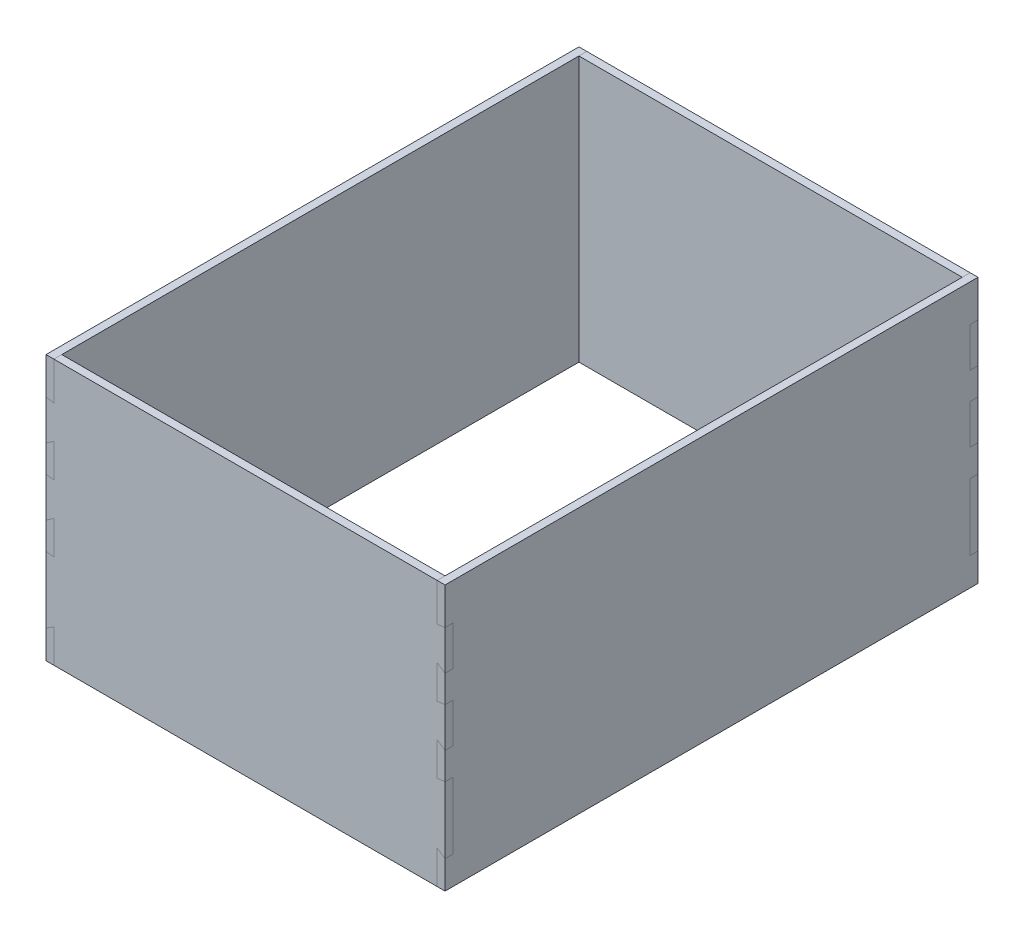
ISO-10303-21;
HEADER;
FILE_DESCRIPTION(('STEP AP214'),'2;1');
FILE_NAME('part.step','',(''),(''),'','','');
FILE_SCHEMA(('AUTOMOTIVE_DESIGN { 1 0 10303 214 1 1 1 1 }'));
ENDSEC;
DATA;
#1=APPLICATION_CONTEXT('core data for automotive mechanical design processes');
#2=APPLICATION_PROTOCOL_DEFINITION('international standard','automotive_design',2000,#1);
#3=PRODUCT_CONTEXT('',#1,'mechanical');
#4=PRODUCT('Part','Part','',(#3));
#5=PRODUCT_RELATED_PRODUCT_CATEGORY('part','',(#4));
#6=PRODUCT_DEFINITION_FORMATION('','',#4);
#7=PRODUCT_DEFINITION_CONTEXT('part definition',#1,'design');
#8=PRODUCT_DEFINITION('design','',#6,#7);
#9=PRODUCT_DEFINITION_SHAPE('','',#8);
#10=(LENGTH_UNIT() NAMED_UNIT(*) SI_UNIT(.MILLI.,.METRE.));
#11=(NAMED_UNIT(*) PLANE_ANGLE_UNIT() SI_UNIT($,.RADIAN.));
#12=(NAMED_UNIT(*) SI_UNIT($,.STERADIAN.) SOLID_ANGLE_UNIT());
#13=UNCERTAINTY_MEASURE_WITH_UNIT(LENGTH_MEASURE(1.E-05),#10,'distance_accuracy_value','');
#14=(GEOMETRIC_REPRESENTATION_CONTEXT(3) GLOBAL_UNCERTAINTY_ASSIGNED_CONTEXT((#13)) GLOBAL_UNIT_ASSIGNED_CONTEXT((#10,
#11,#12)) REPRESENTATION_CONTEXT('',''));
#15=CARTESIAN_POINT('',(0.,0.,0.));
#16=DIRECTION('',(0.,0.,1.));
#17=DIRECTION('',(1.,0.,0.));
#18=AXIS2_PLACEMENT_3D('',#15,#16,#17);
#19=CARTESIAN_POINT('',(-113.126315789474,0.,0.));
#20=DIRECTION('',(0.,0.,1.));
#21=DIRECTION('',(-1.,0.,0.));
#22=AXIS2_PLACEMENT_3D('',#19,#20,#21);
#23=PLANE('',#22);
#24=DIRECTION('',(-0.992277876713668,-0.124034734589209,0.));
#25=VECTOR('',#24,1.);
#26=CARTESIAN_POINT('',(-115.266524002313,17.1216657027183,0.));
#27=LINE('',#26,#25);
#28=CARTESIAN_POINT('',(19.4368421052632,33.9595864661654,0.));
#29=VERTEX_POINT('',#28);
#30=CARTESIAN_POINT('',(16.4368421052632,33.5845864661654,0.));
#31=VERTEX_POINT('',#30);
#32=EDGE_CURVE('E421',#29,#31,#27,.T.);
#33=ORIENTED_EDGE('',*,*,#32,.F.);
#34=DIRECTION('',(0.,-1.,0.));
#35=VECTOR('',#34,1.);
#36=CARTESIAN_POINT('',(19.4368421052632,48.0131578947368,0.));
#37=LINE('',#36,#35);
#38=CARTESIAN_POINT('',(19.4368421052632,18.8703007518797,0.));
#39=VERTEX_POINT('',#38);
#40=EDGE_CURVE('E430',#29,#39,#37,.T.);
#41=ORIENTED_EDGE('',*,*,#40,.T.);
#42=DIRECTION('',(0.832050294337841,-0.554700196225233,0.));
#43=VECTOR('',#42,1.);
#44=CARTESIAN_POINT('',(-63.6282822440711,74.2470503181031,0.));
#45=LINE('',#44,#43);
#46=CARTESIAN_POINT('',(16.4368421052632,20.8703007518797,0.));
#47=VERTEX_POINT('',#46);
#48=EDGE_CURVE('E53',#47,#39,#45,.T.);
#49=ORIENTED_EDGE('',*,*,#48,.F.);
#50=DIRECTION('',(0.,-1.,0.));
#51=VECTOR('',#50,1.);
#52=CARTESIAN_POINT('',(16.4368421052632,48.0131578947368,0.));
#53=LINE('',#52,#51);
#54=CARTESIAN_POINT('',(16.4368421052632,8.15601503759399,0.));
#55=VERTEX_POINT('',#54);
#56=EDGE_CURVE('E371',#47,#55,#53,.T.);
#57=ORIENTED_EDGE('',*,*,#56,.T.);
#58=DIRECTION('',(-0.992277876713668,-0.124034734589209,0.));
#59=VECTOR('',#58,1.);
#60=CARTESIAN_POINT('',(-112.136853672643,-7.91569693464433,0.));
#61=LINE('',#60,#59);
#62=CARTESIAN_POINT('',(19.4368421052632,8.53101503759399,0.));
#63=VERTEX_POINT('',#62);
#64=EDGE_CURVE('E401',#63,#55,#61,.T.);
#65=ORIENTED_EDGE('',*,*,#64,.F.);
#66=DIRECTION('',(0.,-1.,0.));
#67=VECTOR('',#66,1.);
#68=CARTESIAN_POINT('',(19.4368421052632,48.0131578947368,0.));
#69=LINE('',#68,#67);
#70=CARTESIAN_POINT('',(19.4368421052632,-6.55827067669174,0.));
#71=VERTEX_POINT('',#70);
#72=EDGE_CURVE('E411',#63,#71,#69,.T.);
#73=ORIENTED_EDGE('',*,*,#72,.T.);
#74=DIRECTION('',(0.832050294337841,-0.554700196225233,0.));
#75=VECTOR('',#74,1.);
#76=CARTESIAN_POINT('',(-75.3645459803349,56.6426547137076,0.));
#77=LINE('',#76,#75);
#78=CARTESIAN_POINT('',(16.4368421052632,-4.55827067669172,0.));
#79=VERTEX_POINT('',#78);
#80=EDGE_CURVE('E418',#79,#71,#77,.T.);
#81=ORIENTED_EDGE('',*,*,#80,.F.);
#82=CARTESIAN_POINT('',(16.4368421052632,-17.2725563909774,0.));
#83=VERTEX_POINT('',#82);
#84=EDGE_CURVE('E464',#79,#83,#53,.T.);
#85=ORIENTED_EDGE('',*,*,#84,.T.);
#86=DIRECTION('',(-0.992277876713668,-0.124034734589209,0.));
#87=VECTOR('',#86,1.);
#88=CARTESIAN_POINT('',(-109.007183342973,-32.953059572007,0.));
#89=LINE('',#88,#87);
#90=CARTESIAN_POINT('',(19.4368421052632,-16.8975563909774,0.));
#91=VERTEX_POINT('',#90);
#92=EDGE_CURVE('E372',#91,#83,#89,.T.);
#93=ORIENTED_EDGE('',*,*,#92,.F.);
#94=DIRECTION('',(0.,-1.,0.));
#95=VECTOR('',#94,1.);
#96=CARTESIAN_POINT('',(19.4368421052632,48.0131578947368,0.));
#97=LINE('',#96,#95);
#98=CARTESIAN_POINT('',(19.4368421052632,-42.2725563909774,0.));
#99=VERTEX_POINT('',#98);
#100=EDGE_CURVE('E383',#91,#99,#97,.T.);
#101=ORIENTED_EDGE('',*,*,#100,.T.);
#102=DIRECTION('',(0.832050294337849,-0.554700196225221,0.));
#103=VECTOR('',#102,1.);
#104=CARTESIAN_POINT('',(-91.8480624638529,31.9173799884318,0.));
#105=LINE('',#104,#103);
#106=CARTESIAN_POINT('',(16.4368421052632,-40.2725563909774,0.));
#107=VERTEX_POINT('',#106);
#108=EDGE_CURVE('E375',#107,#99,#105,.T.);
#109=ORIENTED_EDGE('',*,*,#108,.F.);
#110=CARTESIAN_POINT('',(16.4368421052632,-52.9868421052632,0.));
#111=VERTEX_POINT('',#110);
#112=EDGE_CURVE('E366',#107,#111,#53,.T.);
#113=ORIENTED_EDGE('',*,*,#112,.T.);
#114=DIRECTION('',(-1.,0.,0.));
#115=VECTOR('',#114,1.);
#116=CARTESIAN_POINT('',(19.4368421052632,-52.9868421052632,0.));
#117=LINE('',#116,#115);
#118=CARTESIAN_POINT('',(-129.563157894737,-52.9868421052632,0.));
#119=VERTEX_POINT('',#118);
#120=EDGE_CURVE('E356',#111,#119,#117,.T.);
#121=ORIENTED_EDGE('',*,*,#120,.T.);
#122=DIRECTION('',(0.,-1.,0.));
#123=VECTOR('',#122,1.);
#124=CARTESIAN_POINT('',(-129.563157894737,48.0131578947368,0.));
#125=LINE('',#124,#123);
#126=CARTESIAN_POINT('',(-129.563157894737,-40.2725563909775,0.));
#127=VERTEX_POINT('',#126);
#128=EDGE_CURVE('E264',#127,#119,#125,.T.);
#129=ORIENTED_EDGE('',*,*,#128,.F.);
#130=DIRECTION('',(-0.832050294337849,-0.554700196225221,0.));
#131=VECTOR('',#130,1.);
#132=CARTESIAN_POINT('',(-21.2782533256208,31.9173799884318,0.));
#133=LINE('',#132,#131);
#134=CARTESIAN_POINT('',(-132.563157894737,-42.2725563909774,0.));
#135=VERTEX_POINT('',#134);
#136=EDGE_CURVE('E278',#127,#135,#133,.T.);
#137=ORIENTED_EDGE('',*,*,#136,.T.);
#138=DIRECTION('',(0.,-1.,0.));
#139=VECTOR('',#138,1.);
#140=CARTESIAN_POINT('',(-132.563157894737,48.0131578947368,0.));
#141=LINE('',#140,#139);
#142=CARTESIAN_POINT('',(-132.563157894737,-16.8975563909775,0.));
#143=VERTEX_POINT('',#142);
#144=EDGE_CURVE('E285',#143,#135,#141,.T.);
#145=ORIENTED_EDGE('',*,*,#144,.F.);
#146=DIRECTION('',(0.992277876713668,-0.124034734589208,0.));
#147=VECTOR('',#146,1.);
#148=CARTESIAN_POINT('',(-4.11913244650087,-32.9530595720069,0.));
#149=LINE('',#148,#147);
#150=CARTESIAN_POINT('',(-129.563157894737,-17.2725563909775,0.));
#151=VERTEX_POINT('',#150);
#152=EDGE_CURVE('E275',#143,#151,#149,.T.);
#153=ORIENTED_EDGE('',*,*,#152,.T.);
#154=CARTESIAN_POINT('',(-129.563157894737,-4.55827067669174,0.));
#155=VERTEX_POINT('',#154);
#156=EDGE_CURVE('E266',#155,#151,#125,.T.);
#157=ORIENTED_EDGE('',*,*,#156,.F.);
#158=DIRECTION('',(-0.832050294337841,-0.554700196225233,0.));
#159=VECTOR('',#158,1.);
#160=CARTESIAN_POINT('',(-37.7617698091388,56.6426547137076,0.));
#161=LINE('',#160,#159);
#162=CARTESIAN_POINT('',(-132.563157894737,-6.55827067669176,0.));
#163=VERTEX_POINT('',#162);
#164=EDGE_CURVE('E319',#155,#163,#161,.T.);
#165=ORIENTED_EDGE('',*,*,#164,.T.);
#166=DIRECTION('',(0.,-1.,0.));
#167=VECTOR('',#166,1.);
#168=CARTESIAN_POINT('',(-132.563157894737,48.0131578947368,0.));
#169=LINE('',#168,#167);
#170=CARTESIAN_POINT('',(-132.563157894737,8.53101503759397,0.));
#171=VERTEX_POINT('',#170);
#172=EDGE_CURVE('E312',#171,#163,#169,.T.);
#173=ORIENTED_EDGE('',*,*,#172,.F.);
#174=DIRECTION('',(0.992277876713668,-0.124034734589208,0.));
#175=VECTOR('',#174,1.);
#176=CARTESIAN_POINT('',(-0.989462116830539,-7.91569693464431,0.));
#177=LINE('',#176,#175);
#178=CARTESIAN_POINT('',(-129.563157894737,8.15601503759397,0.));
#179=VERTEX_POINT('',#178);
#180=EDGE_CURVE('E301',#171,#179,#177,.T.);
#181=ORIENTED_EDGE('',*,*,#180,.T.);
#182=CARTESIAN_POINT('',(-129.563157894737,20.8703007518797,0.));
#183=VERTEX_POINT('',#182);
#184=EDGE_CURVE('E274',#183,#179,#125,.T.);
#185=ORIENTED_EDGE('',*,*,#184,.F.);
#186=DIRECTION('',(-0.832050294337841,-0.554700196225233,0.));
#187=VECTOR('',#186,1.);
#188=CARTESIAN_POINT('',(-49.4980335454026,74.2470503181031,0.));
#189=LINE('',#188,#187);
#190=CARTESIAN_POINT('',(-132.563157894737,18.8703007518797,0.));
#191=VERTEX_POINT('',#190);
#192=EDGE_CURVE('E330',#183,#191,#189,.T.);
#193=ORIENTED_EDGE('',*,*,#192,.T.);
#194=DIRECTION('',(0.,-1.,0.));
#195=VECTOR('',#194,1.);
#196=CARTESIAN_POINT('',(-132.563157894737,48.0131578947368,0.));
#197=LINE('',#196,#195);
#198=CARTESIAN_POINT('',(-132.563157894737,33.9595864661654,0.));
#199=VERTEX_POINT('',#198);
#200=EDGE_CURVE('E342',#199,#191,#197,.T.);
#201=ORIENTED_EDGE('',*,*,#200,.F.);
#202=DIRECTION('',(0.992277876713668,-0.124034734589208,0.));
#203=VECTOR('',#202,1.);
#204=CARTESIAN_POINT('',(2.14020821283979,17.1216657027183,0.));
#205=LINE('',#204,#203);
#206=CARTESIAN_POINT('',(-129.563157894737,33.5845864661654,0.));
#207=VERTEX_POINT('',#206);
#208=EDGE_CURVE('E321',#199,#207,#205,.T.);
#209=ORIENTED_EDGE('',*,*,#208,.T.);
#210=CARTESIAN_POINT('',(-129.563157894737,48.0131578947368,0.));
#211=VERTEX_POINT('',#210);
#212=EDGE_CURVE('E268',#211,#207,#125,.T.);
#213=ORIENTED_EDGE('',*,*,#212,.F.);
#214=DIRECTION('',(1.,0.,0.));
#215=VECTOR('',#214,1.);
#216=CARTESIAN_POINT('',(19.4368421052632,48.0131578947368,0.));
#217=LINE('',#216,#215);
#218=CARTESIAN_POINT('',(16.4368421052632,48.0131578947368,0.));
#219=VERTEX_POINT('',#218);
#220=EDGE_CURVE('E247',#211,#219,#217,.T.);
#221=ORIENTED_EDGE('',*,*,#220,.T.);
#222=EDGE_CURVE('E368',#219,#31,#53,.T.);
#223=ORIENTED_EDGE('',*,*,#222,.T.);
#224=EDGE_LOOP('',(#33,#41,#49,#57,#65,#73,#81,#85,#93,#101,#109,#113,#121,#129,#137,#145,#153,
#157,#165,#173,#181,#185,#193,#201,#209,#213,#221,#223));
#225=FACE_BOUND('',#224,.T.);
#226=ADVANCED_FACE('F50',(#225),#23,.F.);
#227=CARTESIAN_POINT('',(16.4368421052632,33.5845864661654,-12.));
#228=DIRECTION('',(0.124034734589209,-0.992277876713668,0.));
#229=DIRECTION('',(-0.992277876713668,-0.124034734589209,0.));
#230=AXIS2_PLACEMENT_3D('',#227,#228,#229);
#231=PLANE('',#230);
#232=DIRECTION('',(0.,0.,1.));
#233=VECTOR('',#232,1.);
#234=CARTESIAN_POINT('',(19.4368421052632,33.9595864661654,-12.));
#235=LINE('',#234,#233);
#236=CARTESIAN_POINT('',(19.4368421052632,33.9595864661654,3.));
#237=VERTEX_POINT('',#236);
#238=EDGE_CURVE('E58',#29,#237,#235,.T.);
#239=ORIENTED_EDGE('',*,*,#238,.F.);
#240=ORIENTED_EDGE('',*,*,#32,.T.);
#241=DIRECTION('',(0.,0.,1.));
#242=VECTOR('',#241,1.);
#243=CARTESIAN_POINT('',(16.4368421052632,33.5845864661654,-12.));
#244=LINE('',#243,#242);
#245=CARTESIAN_POINT('',(16.4368421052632,33.5845864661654,3.));
#246=VERTEX_POINT('',#245);
#247=EDGE_CURVE('E425',#31,#246,#244,.T.);
#248=ORIENTED_EDGE('',*,*,#247,.T.);
#249=DIRECTION('',(-0.992277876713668,-0.124034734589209,0.));
#250=VECTOR('',#249,1.);
#251=CARTESIAN_POINT('',(16.4368421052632,33.5845864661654,3.));
#252=LINE('',#251,#250);
#253=EDGE_CURVE('E427',#237,#246,#252,.T.);
#254=ORIENTED_EDGE('',*,*,#253,.F.);
#255=EDGE_LOOP('',(#239,#240,#248,#254));
#256=FACE_BOUND('',#255,.T.);
#257=ADVANCED_FACE('F448',(#256),#231,.F.);
#258=CARTESIAN_POINT('',(19.4368421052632,18.8703007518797,-12.));
#259=DIRECTION('',(0.554700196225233,0.832050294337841,0.));
#260=DIRECTION('',(0.832050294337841,-0.554700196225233,0.));
#261=AXIS2_PLACEMENT_3D('',#258,#259,#260);
#262=PLANE('',#261);
#263=DIRECTION('',(0.,0.,1.));
#264=VECTOR('',#263,1.);
#265=CARTESIAN_POINT('',(16.4368421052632,20.8703007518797,-12.));
#266=LINE('',#265,#264);
#267=CARTESIAN_POINT('',(16.4368421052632,20.8703007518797,3.));
#268=VERTEX_POINT('',#267);
#269=EDGE_CURVE('E12',#47,#268,#266,.T.);
#270=ORIENTED_EDGE('',*,*,#269,.F.);
#271=ORIENTED_EDGE('',*,*,#48,.T.);
#272=DIRECTION('',(0.,0.,1.));
#273=VECTOR('',#272,1.);
#274=CARTESIAN_POINT('',(19.4368421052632,18.8703007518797,-12.));
#275=LINE('',#274,#273);
#276=CARTESIAN_POINT('',(19.4368421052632,18.8703007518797,3.));
#277=VERTEX_POINT('',#276);
#278=EDGE_CURVE('E73',#39,#277,#275,.T.);
#279=ORIENTED_EDGE('',*,*,#278,.T.);
#280=DIRECTION('',(0.832050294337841,-0.554700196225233,0.));
#281=VECTOR('',#280,1.);
#282=CARTESIAN_POINT('',(19.4368421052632,18.8703007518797,3.));
#283=LINE('',#282,#281);
#284=EDGE_CURVE('E426',#268,#277,#283,.T.);
#285=ORIENTED_EDGE('',*,*,#284,.F.);
#286=EDGE_LOOP('',(#270,#271,#279,#285));
#287=FACE_BOUND('',#286,.T.);
#288=ADVANCED_FACE('F442',(#287),#262,.F.);
#289=CARTESIAN_POINT('',(-113.126315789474,0.,3.));
#290=DIRECTION('',(0.,0.,1.));
#291=DIRECTION('',(-1.,0.,0.));
#292=AXIS2_PLACEMENT_3D('',#289,#290,#291);
#293=PLANE('',#292);
#294=ORIENTED_EDGE('',*,*,#284,.T.);
#295=DIRECTION('',(0.,-1.,0.));
#296=VECTOR('',#295,1.);
#297=CARTESIAN_POINT('',(19.4368421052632,48.0131578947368,3.));
#298=LINE('',#297,#296);
#299=EDGE_CURVE('E66',#237,#277,#298,.T.);
#300=ORIENTED_EDGE('',*,*,#299,.F.);
#301=ORIENTED_EDGE('',*,*,#253,.T.);
#302=DIRECTION('',(0.,1.,0.));
#303=VECTOR('',#302,1.);
#304=CARTESIAN_POINT('',(16.4368421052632,48.0131578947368,3.));
#305=LINE('',#304,#303);
#306=CARTESIAN_POINT('',(16.4368421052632,48.0131578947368,3.));
#307=VERTEX_POINT('',#306);
#308=EDGE_CURVE('E339',#246,#307,#305,.T.);
#309=ORIENTED_EDGE('',*,*,#308,.T.);
#310=DIRECTION('',(1.,0.,0.));
#311=VECTOR('',#310,1.);
#312=CARTESIAN_POINT('',(19.4368421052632,48.0131578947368,3.));
#313=LINE('',#312,#311);
#314=CARTESIAN_POINT('',(-129.563157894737,48.0131578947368,3.));
#315=VERTEX_POINT('',#314);
#316=EDGE_CURVE('E248',#315,#307,#313,.T.);
#317=ORIENTED_EDGE('',*,*,#316,.F.);
#318=DIRECTION('',(0.,1.,0.));
#319=VECTOR('',#318,1.);
#320=CARTESIAN_POINT('',(-129.563157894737,48.0131578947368,3.));
#321=LINE('',#320,#319);
#322=CARTESIAN_POINT('',(-129.563157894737,33.5845864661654,3.));
#323=VERTEX_POINT('',#322);
#324=EDGE_CURVE('E260',#323,#315,#321,.T.);
#325=ORIENTED_EDGE('',*,*,#324,.F.);
#326=DIRECTION('',(0.992277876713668,-0.124034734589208,0.));
#327=VECTOR('',#326,1.);
#328=CARTESIAN_POINT('',(-129.563157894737,33.5845864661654,3.));
#329=LINE('',#328,#327);
#330=CARTESIAN_POINT('',(-132.563157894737,33.9595864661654,3.));
#331=VERTEX_POINT('',#330);
#332=EDGE_CURVE('E334',#331,#323,#329,.T.);
#333=ORIENTED_EDGE('',*,*,#332,.F.);
#334=DIRECTION('',(0.,-1.,0.));
#335=VECTOR('',#334,1.);
#336=CARTESIAN_POINT('',(-132.563157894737,48.0131578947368,3.));
#337=LINE('',#336,#335);
#338=CARTESIAN_POINT('',(-132.563157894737,18.8703007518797,3.));
#339=VERTEX_POINT('',#338);
#340=EDGE_CURVE('E326',#331,#339,#337,.T.);
#341=ORIENTED_EDGE('',*,*,#340,.T.);
#342=DIRECTION('',(-0.832050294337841,-0.554700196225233,0.));
#343=VECTOR('',#342,1.);
#344=CARTESIAN_POINT('',(-132.563157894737,18.8703007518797,3.));
#345=LINE('',#344,#343);
#346=CARTESIAN_POINT('',(-129.563157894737,20.8703007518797,3.));
#347=VERTEX_POINT('',#346);
#348=EDGE_CURVE('E331',#347,#339,#345,.T.);
#349=ORIENTED_EDGE('',*,*,#348,.F.);
#350=CARTESIAN_POINT('',(-129.563157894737,8.15601503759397,3.));
#351=VERTEX_POINT('',#350);
#352=EDGE_CURVE('E851',#351,#347,#321,.T.);
#353=ORIENTED_EDGE('',*,*,#352,.F.);
#354=DIRECTION('',(0.992277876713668,-0.124034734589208,0.));
#355=VECTOR('',#354,1.);
#356=CARTESIAN_POINT('',(-129.563157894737,8.15601503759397,3.));
#357=LINE('',#356,#355);
#358=CARTESIAN_POINT('',(-132.563157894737,8.53101503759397,3.));
#359=VERTEX_POINT('',#358);
#360=EDGE_CURVE('E309',#359,#351,#357,.T.);
#361=ORIENTED_EDGE('',*,*,#360,.F.);
#362=DIRECTION('',(0.,-1.,0.));
#363=VECTOR('',#362,1.);
#364=CARTESIAN_POINT('',(-132.563157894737,48.0131578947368,3.));
#365=LINE('',#364,#363);
#366=CARTESIAN_POINT('',(-132.563157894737,-6.55827067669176,3.));
#367=VERTEX_POINT('',#366);
#368=EDGE_CURVE('E298',#359,#367,#365,.T.);
#369=ORIENTED_EDGE('',*,*,#368,.T.);
#370=DIRECTION('',(-0.832050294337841,-0.554700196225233,0.));
#371=VECTOR('',#370,1.);
#372=CARTESIAN_POINT('',(-132.563157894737,-6.55827067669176,3.));
#373=LINE('',#372,#371);
#374=CARTESIAN_POINT('',(-129.563157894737,-4.55827067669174,3.));
#375=VERTEX_POINT('',#374);
#376=EDGE_CURVE('E306',#375,#367,#373,.T.);
#377=ORIENTED_EDGE('',*,*,#376,.F.);
#378=CARTESIAN_POINT('',(-129.563157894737,-17.2725563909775,3.));
#379=VERTEX_POINT('',#378);
#380=EDGE_CURVE('E258',#379,#375,#321,.T.);
#381=ORIENTED_EDGE('',*,*,#380,.F.);
#382=DIRECTION('',(0.992277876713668,-0.124034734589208,0.));
#383=VECTOR('',#382,1.);
#384=CARTESIAN_POINT('',(-129.563157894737,-17.2725563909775,3.));
#385=LINE('',#384,#383);
#386=CARTESIAN_POINT('',(-132.563157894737,-16.8975563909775,3.));
#387=VERTEX_POINT('',#386);
#388=EDGE_CURVE('E290',#387,#379,#385,.T.);
#389=ORIENTED_EDGE('',*,*,#388,.F.);
#390=DIRECTION('',(0.,-1.,0.));
#391=VECTOR('',#390,1.);
#392=CARTESIAN_POINT('',(-132.563157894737,48.0131578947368,3.));
#393=LINE('',#392,#391);
#394=CARTESIAN_POINT('',(-132.563157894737,-42.2725563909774,3.));
#395=VERTEX_POINT('',#394);
#396=EDGE_CURVE('E279',#387,#395,#393,.T.);
#397=ORIENTED_EDGE('',*,*,#396,.T.);
#398=DIRECTION('',(-0.832050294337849,-0.554700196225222,0.));
#399=VECTOR('',#398,1.);
#400=CARTESIAN_POINT('',(-132.563157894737,-42.2725563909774,3.));
#401=LINE('',#400,#399);
#402=CARTESIAN_POINT('',(-129.563157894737,-40.2725563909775,3.));
#403=VERTEX_POINT('',#402);
#404=EDGE_CURVE('E255',#403,#395,#401,.T.);
#405=ORIENTED_EDGE('',*,*,#404,.F.);
#406=CARTESIAN_POINT('',(-129.563157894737,-52.9868421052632,3.));
#407=VERTEX_POINT('',#406);
#408=EDGE_CURVE('E251',#407,#403,#321,.T.);
#409=ORIENTED_EDGE('',*,*,#408,.F.);
#410=DIRECTION('',(-1.,0.,0.));
#411=VECTOR('',#410,1.);
#412=CARTESIAN_POINT('',(19.4368421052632,-52.9868421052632,3.));
#413=LINE('',#412,#411);
#414=CARTESIAN_POINT('',(16.4368421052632,-52.9868421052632,3.));
#415=VERTEX_POINT('',#414);
#416=EDGE_CURVE('E238',#415,#407,#413,.T.);
#417=ORIENTED_EDGE('',*,*,#416,.F.);
#418=CARTESIAN_POINT('',(16.4368421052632,-40.2725563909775,3.));
#419=VERTEX_POINT('',#418);
#420=EDGE_CURVE('E362',#415,#419,#305,.T.);
#421=ORIENTED_EDGE('',*,*,#420,.T.);
#422=DIRECTION('',(0.832050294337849,-0.554700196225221,0.));
#423=VECTOR('',#422,1.);
#424=CARTESIAN_POINT('',(19.4368421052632,-42.2725563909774,3.));
#425=LINE('',#424,#423);
#426=CARTESIAN_POINT('',(19.4368421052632,-42.2725563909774,3.));
#427=VERTEX_POINT('',#426);
#428=EDGE_CURVE('E392',#419,#427,#425,.T.);
#429=ORIENTED_EDGE('',*,*,#428,.T.);
#430=DIRECTION('',(0.,-1.,0.));
#431=VECTOR('',#430,1.);
#432=CARTESIAN_POINT('',(19.4368421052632,48.0131578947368,3.));
#433=LINE('',#432,#431);
#434=CARTESIAN_POINT('',(19.4368421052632,-16.8975563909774,3.));
#435=VERTEX_POINT('',#434);
#436=EDGE_CURVE('E376',#435,#427,#433,.T.);
#437=ORIENTED_EDGE('',*,*,#436,.F.);
#438=DIRECTION('',(-0.992277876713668,-0.124034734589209,0.));
#439=VECTOR('',#438,1.);
#440=CARTESIAN_POINT('',(16.4368421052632,-17.2725563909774,3.));
#441=LINE('',#440,#439);
#442=CARTESIAN_POINT('',(16.4368421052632,-17.2725563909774,3.));
#443=VERTEX_POINT('',#442);
#444=EDGE_CURVE('E389',#435,#443,#441,.T.);
#445=ORIENTED_EDGE('',*,*,#444,.T.);
#446=CARTESIAN_POINT('',(16.4368421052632,-4.55827067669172,3.));
#447=VERTEX_POINT('',#446);
#448=EDGE_CURVE('E364',#443,#447,#305,.T.);
#449=ORIENTED_EDGE('',*,*,#448,.T.);
#450=DIRECTION('',(0.832050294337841,-0.554700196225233,0.));
#451=VECTOR('',#450,1.);
#452=CARTESIAN_POINT('',(19.4368421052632,-6.55827067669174,3.));
#453=LINE('',#452,#451);
#454=CARTESIAN_POINT('',(19.4368421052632,-6.55827067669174,3.));
#455=VERTEX_POINT('',#454);
#456=EDGE_CURVE('E405',#447,#455,#453,.T.);
#457=ORIENTED_EDGE('',*,*,#456,.T.);
#458=DIRECTION('',(0.,-1.,0.));
#459=VECTOR('',#458,1.);
#460=CARTESIAN_POINT('',(19.4368421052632,48.0131578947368,3.));
#461=LINE('',#460,#459);
#462=CARTESIAN_POINT('',(19.4368421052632,8.53101503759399,3.));
#463=VERTEX_POINT('',#462);
#464=EDGE_CURVE('E398',#463,#455,#461,.T.);
#465=ORIENTED_EDGE('',*,*,#464,.F.);
#466=DIRECTION('',(-0.992277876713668,-0.124034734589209,0.));
#467=VECTOR('',#466,1.);
#468=CARTESIAN_POINT('',(16.4368421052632,8.15601503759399,3.));
#469=LINE('',#468,#467);
#470=CARTESIAN_POINT('',(16.4368421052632,8.15601503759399,3.));
#471=VERTEX_POINT('',#470);
#472=EDGE_CURVE('E408',#463,#471,#469,.T.);
#473=ORIENTED_EDGE('',*,*,#472,.T.);
#474=EDGE_CURVE('E452',#471,#268,#305,.T.);
#475=ORIENTED_EDGE('',*,*,#474,.T.);
#476=EDGE_LOOP('',(#294,#300,#301,#309,#317,#325,#333,#341,#349,#353,#361,#369,#377,#381,#389,
#397,#405,#409,#417,#421,#429,#437,#445,#449,#457,#465,#473,#475));
#477=FACE_BOUND('',#476,.T.);
#478=ADVANCED_FACE('F252',(#477),#293,.T.);
#479=CARTESIAN_POINT('',(19.4368421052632,48.0131578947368,-98.5));
#480=DIRECTION('',(1.,0.,0.));
#481=DIRECTION('',(0.,0.,1.));
#482=AXIS2_PLACEMENT_3D('',#479,#480,#481);
#483=PLANE('',#482);
#484=ORIENTED_EDGE('',*,*,#40,.F.);
#485=ORIENTED_EDGE('',*,*,#238,.T.);
#486=ORIENTED_EDGE('',*,*,#299,.T.);
#487=ORIENTED_EDGE('',*,*,#278,.F.);
#488=EDGE_LOOP('',(#484,#485,#486,#487));
#489=FACE_BOUND('',#488,.T.);
#490=ADVANCED_FACE('F447',(#489),#483,.T.);
#491=CARTESIAN_POINT('',(16.4368421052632,48.0131578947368,-98.5));
#492=DIRECTION('',(-1.,0.,0.));
#493=DIRECTION('',(0.,0.,-1.));
#494=AXIS2_PLACEMENT_3D('',#491,#492,#493);
#495=PLANE('',#494);
#496=ORIENTED_EDGE('',*,*,#222,.F.);
#497=DIRECTION('',(0.,0.,1.));
#498=VECTOR('',#497,1.);
#499=CARTESIAN_POINT('',(16.4368421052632,48.0131578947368,-98.5));
#500=LINE('',#499,#498);
#501=EDGE_CURVE('E360',#219,#307,#500,.T.);
#502=ORIENTED_EDGE('',*,*,#501,.T.);
#503=ORIENTED_EDGE('',*,*,#308,.F.);
#504=ORIENTED_EDGE('',*,*,#247,.F.);
#505=EDGE_LOOP('',(#496,#502,#503,#504));
#506=FACE_BOUND('',#505,.T.);
#507=ADVANCED_FACE('F511',(#506),#495,.F.);
#508=ORIENTED_EDGE('',*,*,#474,.F.);
#509=DIRECTION('',(0.,0.,1.));
#510=VECTOR('',#509,1.);
#511=CARTESIAN_POINT('',(16.4368421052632,8.15601503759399,-12.));
#512=LINE('',#511,#510);
#513=EDGE_CURVE('E402',#55,#471,#512,.T.);
#514=ORIENTED_EDGE('',*,*,#513,.F.);
#515=ORIENTED_EDGE('',*,*,#56,.F.);
#516=ORIENTED_EDGE('',*,*,#269,.T.);
#517=EDGE_LOOP('',(#508,#514,#515,#516));
#518=FACE_BOUND('',#517,.T.);
#519=ADVANCED_FACE('F476',(#518),#495,.F.);
#520=CARTESIAN_POINT('',(16.4368421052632,8.15601503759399,-12.));
#521=DIRECTION('',(0.124034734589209,-0.992277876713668,0.));
#522=DIRECTION('',(-0.992277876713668,-0.124034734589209,0.));
#523=AXIS2_PLACEMENT_3D('',#520,#521,#522);
#524=PLANE('',#523);
#525=DIRECTION('',(0.,0.,1.));
#526=VECTOR('',#525,1.);
#527=CARTESIAN_POINT('',(19.4368421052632,8.53101503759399,-12.));
#528=LINE('',#527,#526);
#529=EDGE_CURVE('E403',#63,#463,#528,.T.);
#530=ORIENTED_EDGE('',*,*,#529,.F.);
#531=ORIENTED_EDGE('',*,*,#64,.T.);
#532=ORIENTED_EDGE('',*,*,#513,.T.);
#533=ORIENTED_EDGE('',*,*,#472,.F.);
#534=EDGE_LOOP('',(#530,#531,#532,#533));
#535=FACE_BOUND('',#534,.T.);
#536=ADVANCED_FACE('F473',(#535),#524,.F.);
#537=CARTESIAN_POINT('',(19.4368421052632,-6.55827067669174,-12.));
#538=DIRECTION('',(0.554700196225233,0.832050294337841,0.));
#539=DIRECTION('',(0.832050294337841,-0.554700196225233,0.));
#540=AXIS2_PLACEMENT_3D('',#537,#538,#539);
#541=PLANE('',#540);
#542=DIRECTION('',(0.,0.,1.));
#543=VECTOR('',#542,1.);
#544=CARTESIAN_POINT('',(16.4368421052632,-4.55827067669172,-12.));
#545=LINE('',#544,#543);
#546=EDGE_CURVE('E379',#79,#447,#545,.T.);
#547=ORIENTED_EDGE('',*,*,#546,.F.);
#548=ORIENTED_EDGE('',*,*,#80,.T.);
#549=DIRECTION('',(0.,0.,1.));
#550=VECTOR('',#549,1.);
#551=CARTESIAN_POINT('',(19.4368421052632,-6.55827067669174,-12.));
#552=LINE('',#551,#550);
#553=EDGE_CURVE('E414',#71,#455,#552,.T.);
#554=ORIENTED_EDGE('',*,*,#553,.T.);
#555=ORIENTED_EDGE('',*,*,#456,.F.);
#556=EDGE_LOOP('',(#547,#548,#554,#555));
#557=FACE_BOUND('',#556,.T.);
#558=ADVANCED_FACE('F467',(#557),#541,.F.);
#559=CARTESIAN_POINT('',(19.4368421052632,48.0131578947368,-98.5));
#560=DIRECTION('',(1.,0.,0.));
#561=DIRECTION('',(0.,0.,1.));
#562=AXIS2_PLACEMENT_3D('',#559,#560,#561);
#563=PLANE('',#562);
#564=ORIENTED_EDGE('',*,*,#529,.T.);
#565=ORIENTED_EDGE('',*,*,#464,.T.);
#566=ORIENTED_EDGE('',*,*,#553,.F.);
#567=ORIENTED_EDGE('',*,*,#72,.F.);
#568=EDGE_LOOP('',(#564,#565,#566,#567));
#569=FACE_BOUND('',#568,.T.);
#570=ADVANCED_FACE('F470',(#569),#563,.T.);
#571=ORIENTED_EDGE('',*,*,#448,.F.);
#572=DIRECTION('',(0.,0.,1.));
#573=VECTOR('',#572,1.);
#574=CARTESIAN_POINT('',(16.4368421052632,-17.2725563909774,-12.));
#575=LINE('',#574,#573);
#576=EDGE_CURVE('E382',#83,#443,#575,.T.);
#577=ORIENTED_EDGE('',*,*,#576,.F.);
#578=ORIENTED_EDGE('',*,*,#84,.F.);
#579=ORIENTED_EDGE('',*,*,#546,.T.);
#580=EDGE_LOOP('',(#571,#577,#578,#579));
#581=FACE_BOUND('',#580,.T.);
#582=ADVANCED_FACE('F461',(#581),#495,.F.);
#583=CARTESIAN_POINT('',(16.4368421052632,-17.2725563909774,-12.));
#584=DIRECTION('',(0.124034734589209,-0.992277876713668,0.));
#585=DIRECTION('',(-0.992277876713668,-0.124034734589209,0.));
#586=AXIS2_PLACEMENT_3D('',#583,#584,#585);
#587=PLANE('',#586);
#588=DIRECTION('',(0.,0.,1.));
#589=VECTOR('',#588,1.);
#590=CARTESIAN_POINT('',(19.4368421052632,-16.8975563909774,-12.));
#591=LINE('',#590,#589);
#592=EDGE_CURVE('E395',#91,#435,#591,.T.);
#593=ORIENTED_EDGE('',*,*,#592,.F.);
#594=ORIENTED_EDGE('',*,*,#92,.T.);
#595=ORIENTED_EDGE('',*,*,#576,.T.);
#596=ORIENTED_EDGE('',*,*,#444,.F.);
#597=EDGE_LOOP('',(#593,#594,#595,#596));
#598=FACE_BOUND('',#597,.T.);
#599=ADVANCED_FACE('F490',(#598),#587,.F.);
#600=CARTESIAN_POINT('',(19.4368421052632,-42.2725563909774,-12.));
#601=DIRECTION('',(0.554700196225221,0.832050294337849,0.));
#602=DIRECTION('',(0.832050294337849,-0.554700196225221,0.));
#603=AXIS2_PLACEMENT_3D('',#600,#601,#602);
#604=PLANE('',#603);
#605=DIRECTION('',(0.,0.,1.));
#606=VECTOR('',#605,1.);
#607=CARTESIAN_POINT('',(16.4368421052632,-40.2725563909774,-12.));
#608=LINE('',#607,#606);
#609=EDGE_CURVE('E358',#107,#419,#608,.T.);
#610=ORIENTED_EDGE('',*,*,#609,.F.);
#611=ORIENTED_EDGE('',*,*,#108,.T.);
#612=DIRECTION('',(0.,0.,1.));
#613=VECTOR('',#612,1.);
#614=CARTESIAN_POINT('',(19.4368421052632,-42.2725563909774,-12.));
#615=LINE('',#614,#613);
#616=EDGE_CURVE('E380',#99,#427,#615,.T.);
#617=ORIENTED_EDGE('',*,*,#616,.T.);
#618=ORIENTED_EDGE('',*,*,#428,.F.);
#619=EDGE_LOOP('',(#610,#611,#617,#618));
#620=FACE_BOUND('',#619,.T.);
#621=ADVANCED_FACE('F485',(#620),#604,.F.);
#622=CARTESIAN_POINT('',(19.4368421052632,48.0131578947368,-98.5));
#623=DIRECTION('',(1.,0.,0.));
#624=DIRECTION('',(0.,0.,1.));
#625=AXIS2_PLACEMENT_3D('',#622,#623,#624);
#626=PLANE('',#625);
#627=ORIENTED_EDGE('',*,*,#592,.T.);
#628=ORIENTED_EDGE('',*,*,#436,.T.);
#629=ORIENTED_EDGE('',*,*,#616,.F.);
#630=ORIENTED_EDGE('',*,*,#100,.F.);
#631=EDGE_LOOP('',(#627,#628,#629,#630));
#632=FACE_BOUND('',#631,.T.);
#633=ADVANCED_FACE('F488',(#632),#626,.T.);
#634=ORIENTED_EDGE('',*,*,#609,.T.);
#635=ORIENTED_EDGE('',*,*,#420,.F.);
#636=DIRECTION('',(0.,0.,1.));
#637=VECTOR('',#636,1.);
#638=CARTESIAN_POINT('',(16.4368421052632,-52.9868421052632,-98.5));
#639=LINE('',#638,#637);
#640=EDGE_CURVE('E244',#111,#415,#639,.T.);
#641=ORIENTED_EDGE('',*,*,#640,.F.);
#642=ORIENTED_EDGE('',*,*,#112,.F.);
#643=EDGE_LOOP('',(#634,#635,#641,#642));
#644=FACE_BOUND('',#643,.T.);
#645=ADVANCED_FACE('F482',(#644),#495,.F.);
#646=CARTESIAN_POINT('',(19.4368421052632,-52.9868421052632,3.));
#647=DIRECTION('',(0.,1.,0.));
#648=DIRECTION('',(0.,0.,1.));
#649=AXIS2_PLACEMENT_3D('',#646,#647,#648);
#650=PLANE('',#649);
#651=ORIENTED_EDGE('',*,*,#416,.T.);
#652=DIRECTION('',(0.,0.,1.));
#653=VECTOR('',#652,1.);
#654=CARTESIAN_POINT('',(-129.563157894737,-52.9868421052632,-98.5));
#655=LINE('',#654,#653);
#656=EDGE_CURVE('E243',#119,#407,#655,.T.);
#657=ORIENTED_EDGE('',*,*,#656,.F.);
#658=ORIENTED_EDGE('',*,*,#120,.F.);
#659=ORIENTED_EDGE('',*,*,#640,.T.);
#660=EDGE_LOOP('',(#651,#657,#658,#659));
#661=FACE_BOUND('',#660,.T.);
#662=ADVANCED_FACE('F240',(#661),#650,.F.);
#663=CARTESIAN_POINT('',(19.4368421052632,48.0131578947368,3.));
#664=DIRECTION('',(0.,-1.,0.));
#665=DIRECTION('',(0.,0.,-1.));
#666=AXIS2_PLACEMENT_3D('',#663,#664,#665);
#667=PLANE('',#666);
#668=ORIENTED_EDGE('',*,*,#220,.F.);
#669=DIRECTION('',(0.,0.,1.));
#670=VECTOR('',#669,1.);
#671=CARTESIAN_POINT('',(-129.563157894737,48.0131578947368,-98.5));
#672=LINE('',#671,#670);
#673=EDGE_CURVE('E270',#211,#315,#672,.T.);
#674=ORIENTED_EDGE('',*,*,#673,.T.);
#675=ORIENTED_EDGE('',*,*,#316,.T.);
#676=ORIENTED_EDGE('',*,*,#501,.F.);
#677=EDGE_LOOP('',(#668,#674,#675,#676));
#678=FACE_BOUND('',#677,.T.);
#679=ADVANCED_FACE('F664',(#678),#667,.F.);
#680=CARTESIAN_POINT('',(-129.563157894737,33.5845864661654,-12.));
#681=DIRECTION('',(-0.124034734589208,-0.992277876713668,0.));
#682=DIRECTION('',(0.992277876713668,-0.124034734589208,0.));
#683=AXIS2_PLACEMENT_3D('',#680,#681,#682);
#684=PLANE('',#683);
#685=DIRECTION('',(0.,0.,1.));
#686=VECTOR('',#685,1.);
#687=CARTESIAN_POINT('',(-132.563157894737,33.9595864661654,-12.));
#688=LINE('',#687,#686);
#689=EDGE_CURVE('E340',#199,#331,#688,.T.);
#690=ORIENTED_EDGE('',*,*,#689,.T.);
#691=ORIENTED_EDGE('',*,*,#332,.T.);
#692=DIRECTION('',(0.,0.,1.));
#693=VECTOR('',#692,1.);
#694=CARTESIAN_POINT('',(-129.563157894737,33.5845864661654,-12.));
#695=LINE('',#694,#693);
#696=EDGE_CURVE('E329',#207,#323,#695,.T.);
#697=ORIENTED_EDGE('',*,*,#696,.F.);
#698=ORIENTED_EDGE('',*,*,#208,.F.);
#699=EDGE_LOOP('',(#690,#691,#697,#698));
#700=FACE_BOUND('',#699,.T.);
#701=ADVANCED_FACE('F672',(#700),#684,.F.);
#702=CARTESIAN_POINT('',(-132.563157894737,18.8703007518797,-12.));
#703=DIRECTION('',(-0.554700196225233,0.832050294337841,0.));
#704=DIRECTION('',(-0.832050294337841,-0.554700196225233,0.));
#705=AXIS2_PLACEMENT_3D('',#702,#703,#704);
#706=PLANE('',#705);
#707=DIRECTION('',(0.,0.,1.));
#708=VECTOR('',#707,1.);
#709=CARTESIAN_POINT('',(-129.563157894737,20.8703007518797,-12.));
#710=LINE('',#709,#708);
#711=EDGE_CURVE('E336',#183,#347,#710,.T.);
#712=ORIENTED_EDGE('',*,*,#711,.T.);
#713=ORIENTED_EDGE('',*,*,#348,.T.);
#714=DIRECTION('',(0.,0.,1.));
#715=VECTOR('',#714,1.);
#716=CARTESIAN_POINT('',(-132.563157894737,18.8703007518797,-12.));
#717=LINE('',#716,#715);
#718=EDGE_CURVE('E335',#191,#339,#717,.T.);
#719=ORIENTED_EDGE('',*,*,#718,.F.);
#720=ORIENTED_EDGE('',*,*,#192,.F.);
#721=EDGE_LOOP('',(#712,#713,#719,#720));
#722=FACE_BOUND('',#721,.T.);
#723=ADVANCED_FACE('F682',(#722),#706,.F.);
#724=CARTESIAN_POINT('',(-132.563157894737,48.0131578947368,-98.5));
#725=DIRECTION('',(-1.,0.,0.));
#726=DIRECTION('',(0.,0.,1.));
#727=AXIS2_PLACEMENT_3D('',#724,#725,#726);
#728=PLANE('',#727);
#729=ORIENTED_EDGE('',*,*,#200,.T.);
#730=ORIENTED_EDGE('',*,*,#718,.T.);
#731=ORIENTED_EDGE('',*,*,#340,.F.);
#732=ORIENTED_EDGE('',*,*,#689,.F.);
#733=EDGE_LOOP('',(#729,#730,#731,#732));
#734=FACE_BOUND('',#733,.T.);
#735=ADVANCED_FACE('F693',(#734),#728,.T.);
#736=CARTESIAN_POINT('',(-129.563157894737,48.0131578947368,-98.5));
#737=DIRECTION('',(1.,0.,0.));
#738=DIRECTION('',(0.,0.,-1.));
#739=AXIS2_PLACEMENT_3D('',#736,#737,#738);
#740=PLANE('',#739);
#741=ORIENTED_EDGE('',*,*,#212,.T.);
#742=ORIENTED_EDGE('',*,*,#696,.T.);
#743=ORIENTED_EDGE('',*,*,#324,.T.);
#744=ORIENTED_EDGE('',*,*,#673,.F.);
#745=EDGE_LOOP('',(#741,#742,#743,#744));
#746=FACE_BOUND('',#745,.T.);
#747=ADVANCED_FACE('F704',(#746),#740,.F.);
#748=ORIENTED_EDGE('',*,*,#352,.T.);
#749=ORIENTED_EDGE('',*,*,#711,.F.);
#750=ORIENTED_EDGE('',*,*,#184,.T.);
#751=DIRECTION('',(0.,0.,1.));
#752=VECTOR('',#751,1.);
#753=CARTESIAN_POINT('',(-129.563157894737,8.15601503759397,-12.));
#754=LINE('',#753,#752);
#755=EDGE_CURVE('E302',#179,#351,#754,.T.);
#756=ORIENTED_EDGE('',*,*,#755,.T.);
#757=EDGE_LOOP('',(#748,#749,#750,#756));
#758=FACE_BOUND('',#757,.T.);
#759=ADVANCED_FACE('F715',(#758),#740,.F.);
#760=CARTESIAN_POINT('',(-129.563157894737,8.15601503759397,-12.));
#761=DIRECTION('',(-0.124034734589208,-0.992277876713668,0.));
#762=DIRECTION('',(0.992277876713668,-0.124034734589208,0.));
#763=AXIS2_PLACEMENT_3D('',#760,#761,#762);
#764=PLANE('',#763);
#765=DIRECTION('',(0.,0.,1.));
#766=VECTOR('',#765,1.);
#767=CARTESIAN_POINT('',(-132.563157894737,8.53101503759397,-12.));
#768=LINE('',#767,#766);
#769=EDGE_CURVE('E303',#171,#359,#768,.T.);
#770=ORIENTED_EDGE('',*,*,#769,.T.);
#771=ORIENTED_EDGE('',*,*,#360,.T.);
#772=ORIENTED_EDGE('',*,*,#755,.F.);
#773=ORIENTED_EDGE('',*,*,#180,.F.);
#774=EDGE_LOOP('',(#770,#771,#772,#773));
#775=FACE_BOUND('',#774,.T.);
#776=ADVANCED_FACE('F726',(#775),#764,.F.);
#777=CARTESIAN_POINT('',(-132.563157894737,-6.55827067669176,-12.));
#778=DIRECTION('',(-0.554700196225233,0.832050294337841,0.));
#779=DIRECTION('',(-0.832050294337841,-0.554700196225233,0.));
#780=AXIS2_PLACEMENT_3D('',#777,#778,#779);
#781=PLANE('',#780);
#782=DIRECTION('',(0.,0.,1.));
#783=VECTOR('',#782,1.);
#784=CARTESIAN_POINT('',(-129.563157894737,-4.55827067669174,-12.));
#785=LINE('',#784,#783);
#786=EDGE_CURVE('E281',#155,#375,#785,.T.);
#787=ORIENTED_EDGE('',*,*,#786,.T.);
#788=ORIENTED_EDGE('',*,*,#376,.T.);
#789=DIRECTION('',(0.,0.,1.));
#790=VECTOR('',#789,1.);
#791=CARTESIAN_POINT('',(-132.563157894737,-6.55827067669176,-12.));
#792=LINE('',#791,#790);
#793=EDGE_CURVE('E315',#163,#367,#792,.T.);
#794=ORIENTED_EDGE('',*,*,#793,.F.);
#795=ORIENTED_EDGE('',*,*,#164,.F.);
#796=EDGE_LOOP('',(#787,#788,#794,#795));
#797=FACE_BOUND('',#796,.T.);
#798=ADVANCED_FACE('F738',(#797),#781,.F.);
#799=CARTESIAN_POINT('',(-132.563157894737,48.0131578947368,-98.5));
#800=DIRECTION('',(-1.,0.,0.));
#801=DIRECTION('',(0.,0.,1.));
#802=AXIS2_PLACEMENT_3D('',#799,#800,#801);
#803=PLANE('',#802);
#804=ORIENTED_EDGE('',*,*,#769,.F.);
#805=ORIENTED_EDGE('',*,*,#172,.T.);
#806=ORIENTED_EDGE('',*,*,#793,.T.);
#807=ORIENTED_EDGE('',*,*,#368,.F.);
#808=EDGE_LOOP('',(#804,#805,#806,#807));
#809=FACE_BOUND('',#808,.T.);
#810=ADVANCED_FACE('F729',(#809),#803,.T.);
#811=ORIENTED_EDGE('',*,*,#380,.T.);
#812=ORIENTED_EDGE('',*,*,#786,.F.);
#813=ORIENTED_EDGE('',*,*,#156,.T.);
#814=DIRECTION('',(0.,0.,1.));
#815=VECTOR('',#814,1.);
#816=CARTESIAN_POINT('',(-129.563157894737,-17.2725563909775,-12.));
#817=LINE('',#816,#815);
#818=EDGE_CURVE('E284',#151,#379,#817,.T.);
#819=ORIENTED_EDGE('',*,*,#818,.T.);
#820=EDGE_LOOP('',(#811,#812,#813,#819));
#821=FACE_BOUND('',#820,.T.);
#822=ADVANCED_FACE('F728',(#821),#740,.F.);
#823=CARTESIAN_POINT('',(-129.563157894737,-17.2725563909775,-12.));
#824=DIRECTION('',(-0.124034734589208,-0.992277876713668,0.));
#825=DIRECTION('',(0.992277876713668,-0.124034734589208,0.));
#826=AXIS2_PLACEMENT_3D('',#823,#824,#825);
#827=PLANE('',#826);
#828=DIRECTION('',(0.,0.,1.));
#829=VECTOR('',#828,1.);
#830=CARTESIAN_POINT('',(-132.563157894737,-16.8975563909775,-12.));
#831=LINE('',#830,#829);
#832=EDGE_CURVE('E294',#143,#387,#831,.T.);
#833=ORIENTED_EDGE('',*,*,#832,.T.);
#834=ORIENTED_EDGE('',*,*,#388,.T.);
#835=ORIENTED_EDGE('',*,*,#818,.F.);
#836=ORIENTED_EDGE('',*,*,#152,.F.);
#837=EDGE_LOOP('',(#833,#834,#835,#836));
#838=FACE_BOUND('',#837,.T.);
#839=ADVANCED_FACE('F769',(#838),#827,.F.);
#840=CARTESIAN_POINT('',(-132.563157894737,-42.2725563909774,-12.));
#841=DIRECTION('',(-0.554700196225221,0.832050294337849,0.));
#842=DIRECTION('',(-0.832050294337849,-0.554700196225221,0.));
#843=AXIS2_PLACEMENT_3D('',#840,#841,#842);
#844=PLANE('',#843);
#845=DIRECTION('',(0.,0.,1.));
#846=VECTOR('',#845,1.);
#847=CARTESIAN_POINT('',(-129.563157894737,-40.2725563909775,-12.));
#848=LINE('',#847,#846);
#849=EDGE_CURVE('E272',#127,#403,#848,.T.);
#850=ORIENTED_EDGE('',*,*,#849,.T.);
#851=ORIENTED_EDGE('',*,*,#404,.T.);
#852=DIRECTION('',(0.,0.,1.));
#853=VECTOR('',#852,1.);
#854=CARTESIAN_POINT('',(-132.563157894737,-42.2725563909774,-12.));
#855=LINE('',#854,#853);
#856=EDGE_CURVE('E282',#135,#395,#855,.T.);
#857=ORIENTED_EDGE('',*,*,#856,.F.);
#858=ORIENTED_EDGE('',*,*,#136,.F.);
#859=EDGE_LOOP('',(#850,#851,#857,#858));
#860=FACE_BOUND('',#859,.T.);
#861=ADVANCED_FACE('F771',(#860),#844,.F.);
#862=CARTESIAN_POINT('',(-132.563157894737,48.0131578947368,-98.5));
#863=DIRECTION('',(-1.,0.,0.));
#864=DIRECTION('',(0.,0.,1.));
#865=AXIS2_PLACEMENT_3D('',#862,#863,#864);
#866=PLANE('',#865);
#867=ORIENTED_EDGE('',*,*,#832,.F.);
#868=ORIENTED_EDGE('',*,*,#144,.T.);
#869=ORIENTED_EDGE('',*,*,#856,.T.);
#870=ORIENTED_EDGE('',*,*,#396,.F.);
#871=EDGE_LOOP('',(#867,#868,#869,#870));
#872=FACE_BOUND('',#871,.T.);
#873=ADVANCED_FACE('F782',(#872),#866,.T.);
#874=ORIENTED_EDGE('',*,*,#849,.F.);
#875=ORIENTED_EDGE('',*,*,#128,.T.);
#876=ORIENTED_EDGE('',*,*,#656,.T.);
#877=ORIENTED_EDGE('',*,*,#408,.T.);
#878=EDGE_LOOP('',(#874,#875,#876,#877));
#879=FACE_BOUND('',#878,.T.);
#880=ADVANCED_FACE('F262',(#879),#740,.F.);
#881=CLOSED_SHELL('',(#226,#257,#288,#478,#490,#507,#519,#536,#558,#570,#582,#599,#621,#633,
#645,#662,#679,#701,#723,#735,#747,#759,#776,#798,#810,#822,#839,#861,#873,#880));
#882=MANIFOLD_SOLID_BREP('B2',#881);
#883=CARTESIAN_POINT('',(-113.126315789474,0.,-197.));
#884=DIRECTION('',(0.,0.,-1.));
#885=DIRECTION('',(-1.,0.,0.));
#886=AXIS2_PLACEMENT_3D('',#883,#884,#885);
#887=PLANE('',#886);
#888=DIRECTION('',(-0.992277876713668,-0.124034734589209,0.));
#889=VECTOR('',#888,1.);
#890=CARTESIAN_POINT('',(-115.266524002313,17.1216657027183,-197.));
#891=LINE('',#890,#889);
#892=CARTESIAN_POINT('',(19.4368421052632,33.9595864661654,-197.));
#893=VERTEX_POINT('',#892);
#894=CARTESIAN_POINT('',(16.4368421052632,33.5845864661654,-197.));
#895=VERTEX_POINT('',#894);
#896=EDGE_CURVE('E1236',#893,#895,#891,.T.);
#897=ORIENTED_EDGE('',*,*,#896,.T.);
#898=DIRECTION('',(0.,-1.,0.));
#899=VECTOR('',#898,1.);
#900=CARTESIAN_POINT('',(16.4368421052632,48.0131578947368,-197.));
#901=LINE('',#900,#899);
#902=CARTESIAN_POINT('',(16.4368421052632,48.0131578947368,-197.));
#903=VERTEX_POINT('',#902);
#904=EDGE_CURVE('E1183',#903,#895,#901,.T.);
#905=ORIENTED_EDGE('',*,*,#904,.F.);
#906=DIRECTION('',(1.,0.,0.));
#907=VECTOR('',#906,1.);
#908=CARTESIAN_POINT('',(19.4368421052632,48.0131578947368,-197.));
#909=LINE('',#908,#907);
#910=CARTESIAN_POINT('',(-129.563157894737,48.0131578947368,-197.));
#911=VERTEX_POINT('',#910);
#912=EDGE_CURVE('E1100',#911,#903,#909,.T.);
#913=ORIENTED_EDGE('',*,*,#912,.F.);
#914=DIRECTION('',(0.,-1.,0.));
#915=VECTOR('',#914,1.);
#916=CARTESIAN_POINT('',(-129.563157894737,48.0131578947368,-197.));
#917=LINE('',#916,#915);
#918=CARTESIAN_POINT('',(-129.563157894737,33.5845864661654,-197.));
#919=VERTEX_POINT('',#918);
#920=EDGE_CURVE('E1274',#911,#919,#917,.T.);
#921=ORIENTED_EDGE('',*,*,#920,.T.);
#922=DIRECTION('',(0.992277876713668,-0.124034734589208,0.));
#923=VECTOR('',#922,1.);
#924=CARTESIAN_POINT('',(2.14020821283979,17.1216657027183,-197.));
#925=LINE('',#924,#923);
#926=CARTESIAN_POINT('',(-132.563157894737,33.9595864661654,-197.));
#927=VERTEX_POINT('',#926);
#928=EDGE_CURVE('E1166',#927,#919,#925,.T.);
#929=ORIENTED_EDGE('',*,*,#928,.F.);
#930=DIRECTION('',(0.,-1.,0.));
#931=VECTOR('',#930,1.);
#932=CARTESIAN_POINT('',(-132.563157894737,48.0131578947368,-197.));
#933=LINE('',#932,#931);
#934=CARTESIAN_POINT('',(-132.563157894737,18.8703007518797,-197.));
#935=VERTEX_POINT('',#934);
#936=EDGE_CURVE('E1158',#927,#935,#933,.T.);
#937=ORIENTED_EDGE('',*,*,#936,.T.);
#938=DIRECTION('',(-0.832050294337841,-0.554700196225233,0.));
#939=VECTOR('',#938,1.);
#940=CARTESIAN_POINT('',(-49.4980335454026,74.2470503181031,-197.));
#941=LINE('',#940,#939);
#942=CARTESIAN_POINT('',(-129.563157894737,20.8703007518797,-197.));
#943=VERTEX_POINT('',#942);
#944=EDGE_CURVE('E1169',#943,#935,#941,.T.);
#945=ORIENTED_EDGE('',*,*,#944,.F.);
#946=CARTESIAN_POINT('',(-129.563157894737,8.15601503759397,-197.));
#947=VERTEX_POINT('',#946);
#948=EDGE_CURVE('E1145',#943,#947,#917,.T.);
#949=ORIENTED_EDGE('',*,*,#948,.T.);
#950=DIRECTION('',(0.992277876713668,-0.124034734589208,0.));
#951=VECTOR('',#950,1.);
#952=CARTESIAN_POINT('',(-0.989462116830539,-7.91569693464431,-197.));
#953=LINE('',#952,#951);
#954=CARTESIAN_POINT('',(-132.563157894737,8.53101503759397,-197.));
#955=VERTEX_POINT('',#954);
#956=EDGE_CURVE('E1328',#955,#947,#953,.T.);
#957=ORIENTED_EDGE('',*,*,#956,.F.);
#958=DIRECTION('',(0.,-1.,0.));
#959=VECTOR('',#958,1.);
#960=CARTESIAN_POINT('',(-132.563157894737,48.0131578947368,-197.));
#961=LINE('',#960,#959);
#962=CARTESIAN_POINT('',(-132.563157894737,-6.55827067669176,-197.));
#963=VERTEX_POINT('',#962);
#964=EDGE_CURVE('E1336',#955,#963,#961,.T.);
#965=ORIENTED_EDGE('',*,*,#964,.T.);
#966=DIRECTION('',(-0.832050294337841,-0.554700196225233,0.));
#967=VECTOR('',#966,1.);
#968=CARTESIAN_POINT('',(-37.7617698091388,56.6426547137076,-197.));
#969=LINE('',#968,#967);
#970=CARTESIAN_POINT('',(-129.563157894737,-4.55827067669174,-197.));
#971=VERTEX_POINT('',#970);
#972=EDGE_CURVE('E1170',#971,#963,#969,.T.);
#973=ORIENTED_EDGE('',*,*,#972,.F.);
#974=CARTESIAN_POINT('',(-129.563157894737,-17.2725563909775,-197.));
#975=VERTEX_POINT('',#974);
#976=EDGE_CURVE('E1283',#971,#975,#917,.T.);
#977=ORIENTED_EDGE('',*,*,#976,.T.);
#978=DIRECTION('',(0.992277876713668,-0.124034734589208,0.));
#979=VECTOR('',#978,1.);
#980=CARTESIAN_POINT('',(-4.11913244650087,-32.9530595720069,-197.));
#981=LINE('',#980,#979);
#982=CARTESIAN_POINT('',(-132.563157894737,-16.8975563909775,-197.));
#983=VERTEX_POINT('',#982);
#984=EDGE_CURVE('E1292',#983,#975,#981,.T.);
#985=ORIENTED_EDGE('',*,*,#984,.F.);
#986=DIRECTION('',(0.,-1.,0.));
#987=VECTOR('',#986,1.);
#988=CARTESIAN_POINT('',(-132.563157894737,48.0131578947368,-197.));
#989=LINE('',#988,#987);
#990=CARTESIAN_POINT('',(-132.563157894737,-42.2725563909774,-197.));
#991=VERTEX_POINT('',#990);
#992=EDGE_CURVE('E1316',#983,#991,#989,.T.);
#993=ORIENTED_EDGE('',*,*,#992,.T.);
#994=DIRECTION('',(-0.832050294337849,-0.554700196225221,0.));
#995=VECTOR('',#994,1.);
#996=CARTESIAN_POINT('',(-21.2782533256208,31.9173799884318,-197.));
#997=LINE('',#996,#995);
#998=CARTESIAN_POINT('',(-129.563157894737,-40.2725563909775,-197.));
#999=VERTEX_POINT('',#998);
#1000=EDGE_CURVE('E1310',#999,#991,#997,.T.);
#1001=ORIENTED_EDGE('',*,*,#1000,.F.);
#1002=CARTESIAN_POINT('',(-129.563157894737,-52.9868421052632,-197.));
#1003=VERTEX_POINT('',#1002);
#1004=EDGE_CURVE('E1111',#999,#1003,#917,.T.);
#1005=ORIENTED_EDGE('',*,*,#1004,.T.);
#1006=DIRECTION('',(-1.,0.,0.));
#1007=VECTOR('',#1006,1.);
#1008=CARTESIAN_POINT('',(19.4368421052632,-52.9868421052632,-197.));
#1009=LINE('',#1008,#1007);
#1010=CARTESIAN_POINT('',(16.4368421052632,-52.9868421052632,-197.));
#1011=VERTEX_POINT('',#1010);
#1012=EDGE_CURVE('E1107',#1011,#1003,#1009,.T.);
#1013=ORIENTED_EDGE('',*,*,#1012,.F.);
#1014=CARTESIAN_POINT('',(16.4368421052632,-40.2725563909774,-197.));
#1015=VERTEX_POINT('',#1014);
#1016=EDGE_CURVE('E1181',#1015,#1011,#901,.T.);
#1017=ORIENTED_EDGE('',*,*,#1016,.F.);
#1018=DIRECTION('',(0.832050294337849,-0.554700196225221,0.));
#1019=VECTOR('',#1018,1.);
#1020=CARTESIAN_POINT('',(-91.8480624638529,31.9173799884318,-197.));
#1021=LINE('',#1020,#1019);
#1022=CARTESIAN_POINT('',(19.4368421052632,-42.2725563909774,-197.));
#1023=VERTEX_POINT('',#1022);
#1024=EDGE_CURVE('E1190',#1015,#1023,#1021,.T.);
#1025=ORIENTED_EDGE('',*,*,#1024,.T.);
#1026=DIRECTION('',(0.,-1.,0.));
#1027=VECTOR('',#1026,1.);
#1028=CARTESIAN_POINT('',(19.4368421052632,48.0131578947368,-197.));
#1029=LINE('',#1028,#1027);
#1030=CARTESIAN_POINT('',(19.4368421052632,-16.8975563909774,-197.));
#1031=VERTEX_POINT('',#1030);
#1032=EDGE_CURVE('E1198',#1031,#1023,#1029,.T.);
#1033=ORIENTED_EDGE('',*,*,#1032,.F.);
#1034=DIRECTION('',(-0.992277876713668,-0.124034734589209,0.));
#1035=VECTOR('',#1034,1.);
#1036=CARTESIAN_POINT('',(-109.007183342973,-32.953059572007,-197.));
#1037=LINE('',#1036,#1035);
#1038=CARTESIAN_POINT('',(16.4368421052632,-17.2725563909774,-197.));
#1039=VERTEX_POINT('',#1038);
#1040=EDGE_CURVE('E1187',#1031,#1039,#1037,.T.);
#1041=ORIENTED_EDGE('',*,*,#1040,.T.);
#1042=CARTESIAN_POINT('',(16.4368421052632,-4.55827067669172,-197.));
#1043=VERTEX_POINT('',#1042);
#1044=EDGE_CURVE('E1731',#1043,#1039,#901,.T.);
#1045=ORIENTED_EDGE('',*,*,#1044,.F.);
#1046=DIRECTION('',(0.832050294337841,-0.554700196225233,0.));
#1047=VECTOR('',#1046,1.);
#1048=CARTESIAN_POINT('',(-75.3645459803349,56.6426547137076,-197.));
#1049=LINE('',#1048,#1047);
#1050=CARTESIAN_POINT('',(19.4368421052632,-6.55827067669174,-197.));
#1051=VERTEX_POINT('',#1050);
#1052=EDGE_CURVE('E1233',#1043,#1051,#1049,.T.);
#1053=ORIENTED_EDGE('',*,*,#1052,.T.);
#1054=DIRECTION('',(0.,-1.,0.));
#1055=VECTOR('',#1054,1.);
#1056=CARTESIAN_POINT('',(19.4368421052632,48.0131578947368,-197.));
#1057=LINE('',#1056,#1055);
#1058=CARTESIAN_POINT('',(19.4368421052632,8.53101503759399,-197.));
#1059=VERTEX_POINT('',#1058);
#1060=EDGE_CURVE('E1226',#1059,#1051,#1057,.T.);
#1061=ORIENTED_EDGE('',*,*,#1060,.F.);
#1062=DIRECTION('',(-0.992277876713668,-0.124034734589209,0.));
#1063=VECTOR('',#1062,1.);
#1064=CARTESIAN_POINT('',(-112.136853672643,-7.91569693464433,-197.));
#1065=LINE('',#1064,#1063);
#1066=CARTESIAN_POINT('',(16.4368421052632,8.15601503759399,-197.));
#1067=VERTEX_POINT('',#1066);
#1068=EDGE_CURVE('E1216',#1059,#1067,#1065,.T.);
#1069=ORIENTED_EDGE('',*,*,#1068,.T.);
#1070=CARTESIAN_POINT('',(16.4368421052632,20.8703007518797,-197.));
#1071=VERTEX_POINT('',#1070);
#1072=EDGE_CURVE('E1186',#1071,#1067,#901,.T.);
#1073=ORIENTED_EDGE('',*,*,#1072,.F.);
#1074=DIRECTION('',(0.832050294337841,-0.554700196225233,0.));
#1075=VECTOR('',#1074,1.);
#1076=CARTESIAN_POINT('',(-63.6282822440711,74.2470503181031,-197.));
#1077=LINE('',#1076,#1075);
#1078=CARTESIAN_POINT('',(19.4368421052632,18.8703007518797,-197.));
#1079=VERTEX_POINT('',#1078);
#1080=EDGE_CURVE('E904',#1071,#1079,#1077,.T.);
#1081=ORIENTED_EDGE('',*,*,#1080,.T.);
#1082=DIRECTION('',(0.,-1.,0.));
#1083=VECTOR('',#1082,1.);
#1084=CARTESIAN_POINT('',(19.4368421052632,48.0131578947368,-197.));
#1085=LINE('',#1084,#1083);
#1086=EDGE_CURVE('E1245',#893,#1079,#1085,.T.);
#1087=ORIENTED_EDGE('',*,*,#1086,.F.);
#1088=EDGE_LOOP('',(#897,#905,#913,#921,#929,#937,#945,#949,#957,#965,#973,#977,#985,#993,#1001,
#1005,#1013,#1017,#1025,#1033,#1041,#1045,#1053,#1061,#1069,#1073,#1081,#1087));
#1089=FACE_BOUND('',#1088,.T.);
#1090=ADVANCED_FACE('F901',(#1089),#887,.F.);
#1091=CARTESIAN_POINT('',(16.4368421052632,33.5845864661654,-185.));
#1092=DIRECTION('',(0.124034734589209,-0.992277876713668,0.));
#1093=DIRECTION('',(-0.992277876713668,-0.124034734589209,0.));
#1094=AXIS2_PLACEMENT_3D('',#1091,#1092,#1093);
#1095=PLANE('',#1094);
#1096=DIRECTION('',(0.,0.,-1.));
#1097=VECTOR('',#1096,1.);
#1098=CARTESIAN_POINT('',(19.4368421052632,33.9595864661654,-185.));
#1099=LINE('',#1098,#1097);
#1100=CARTESIAN_POINT('',(19.4368421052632,33.9595864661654,-200.));
#1101=VERTEX_POINT('',#1100);
#1102=EDGE_CURVE('E909',#893,#1101,#1099,.T.);
#1103=ORIENTED_EDGE('',*,*,#1102,.T.);
#1104=DIRECTION('',(-0.992277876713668,-0.124034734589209,0.));
#1105=VECTOR('',#1104,1.);
#1106=CARTESIAN_POINT('',(16.4368421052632,33.5845864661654,-200.));
#1107=LINE('',#1106,#1105);
#1108=CARTESIAN_POINT('',(16.4368421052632,33.5845864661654,-200.));
#1109=VERTEX_POINT('',#1108);
#1110=EDGE_CURVE('E1242',#1101,#1109,#1107,.T.);
#1111=ORIENTED_EDGE('',*,*,#1110,.T.);
#1112=DIRECTION('',(0.,0.,-1.));
#1113=VECTOR('',#1112,1.);
#1114=CARTESIAN_POINT('',(16.4368421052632,33.5845864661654,-185.));
#1115=LINE('',#1114,#1113);
#1116=EDGE_CURVE('E1240',#895,#1109,#1115,.T.);
#1117=ORIENTED_EDGE('',*,*,#1116,.F.);
#1118=ORIENTED_EDGE('',*,*,#896,.F.);
#1119=EDGE_LOOP('',(#1103,#1111,#1117,#1118));
#1120=FACE_BOUND('',#1119,.T.);
#1121=ADVANCED_FACE('F1267',(#1120),#1095,.F.);
#1122=CARTESIAN_POINT('',(19.4368421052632,18.8703007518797,-185.));
#1123=DIRECTION('',(0.554700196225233,0.832050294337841,0.));
#1124=DIRECTION('',(0.832050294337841,-0.554700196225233,0.));
#1125=AXIS2_PLACEMENT_3D('',#1122,#1123,#1124);
#1126=PLANE('',#1125);
#1127=DIRECTION('',(0.,0.,-1.));
#1128=VECTOR('',#1127,1.);
#1129=CARTESIAN_POINT('',(16.4368421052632,20.8703007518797,-185.));
#1130=LINE('',#1129,#1128);
#1131=CARTESIAN_POINT('',(16.4368421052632,20.8703007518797,-200.));
#1132=VERTEX_POINT('',#1131);
#1133=EDGE_CURVE('E48',#1071,#1132,#1130,.T.);
#1134=ORIENTED_EDGE('',*,*,#1133,.T.);
#1135=DIRECTION('',(0.832050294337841,-0.554700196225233,0.));
#1136=VECTOR('',#1135,1.);
#1137=CARTESIAN_POINT('',(19.4368421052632,18.8703007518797,-200.));
#1138=LINE('',#1137,#1136);
#1139=CARTESIAN_POINT('',(19.4368421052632,18.8703007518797,-200.));
#1140=VERTEX_POINT('',#1139);
#1141=EDGE_CURVE('E1241',#1132,#1140,#1138,.T.);
#1142=ORIENTED_EDGE('',*,*,#1141,.T.);
#1143=DIRECTION('',(0.,0.,-1.));
#1144=VECTOR('',#1143,1.);
#1145=CARTESIAN_POINT('',(19.4368421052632,18.8703007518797,-185.));
#1146=LINE('',#1145,#1144);
#1147=EDGE_CURVE('E924',#1079,#1140,#1146,.T.);
#1148=ORIENTED_EDGE('',*,*,#1147,.F.);
#1149=ORIENTED_EDGE('',*,*,#1080,.F.);
#1150=EDGE_LOOP('',(#1134,#1142,#1148,#1149));
#1151=FACE_BOUND('',#1150,.T.);
#1152=ADVANCED_FACE('F1260',(#1151),#1126,.F.);
#1153=CARTESIAN_POINT('',(-113.126315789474,0.,-200.));
#1154=DIRECTION('',(0.,0.,-1.));
#1155=DIRECTION('',(-1.,0.,0.));
#1156=AXIS2_PLACEMENT_3D('',#1153,#1154,#1155);
#1157=PLANE('',#1156);
#1158=ORIENTED_EDGE('',*,*,#1141,.F.);
#1159=DIRECTION('',(0.,1.,0.));
#1160=VECTOR('',#1159,1.);
#1161=CARTESIAN_POINT('',(16.4368421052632,48.0131578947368,-200.));
#1162=LINE('',#1161,#1160);
#1163=CARTESIAN_POINT('',(16.4368421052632,8.15601503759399,-200.));
#1164=VERTEX_POINT('',#1163);
#1165=EDGE_CURVE('E1151',#1164,#1132,#1162,.T.);
#1166=ORIENTED_EDGE('',*,*,#1165,.F.);
#1167=DIRECTION('',(-0.992277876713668,-0.124034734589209,0.));
#1168=VECTOR('',#1167,1.);
#1169=CARTESIAN_POINT('',(16.4368421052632,8.15601503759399,-200.));
#1170=LINE('',#1169,#1168);
#1171=CARTESIAN_POINT('',(19.4368421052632,8.53101503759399,-200.));
#1172=VERTEX_POINT('',#1171);
#1173=EDGE_CURVE('E1223',#1172,#1164,#1170,.T.);
#1174=ORIENTED_EDGE('',*,*,#1173,.F.);
#1175=DIRECTION('',(0.,-1.,0.));
#1176=VECTOR('',#1175,1.);
#1177=CARTESIAN_POINT('',(19.4368421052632,48.0131578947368,-200.));
#1178=LINE('',#1177,#1176);
#1179=CARTESIAN_POINT('',(19.4368421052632,-6.55827067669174,-200.));
#1180=VERTEX_POINT('',#1179);
#1181=EDGE_CURVE('E1213',#1172,#1180,#1178,.T.);
#1182=ORIENTED_EDGE('',*,*,#1181,.T.);
#1183=DIRECTION('',(0.832050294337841,-0.554700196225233,0.));
#1184=VECTOR('',#1183,1.);
#1185=CARTESIAN_POINT('',(19.4368421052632,-6.55827067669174,-200.));
#1186=LINE('',#1185,#1184);
#1187=CARTESIAN_POINT('',(16.4368421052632,-4.55827067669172,-200.));
#1188=VERTEX_POINT('',#1187);
#1189=EDGE_CURVE('E1220',#1188,#1180,#1186,.T.);
#1190=ORIENTED_EDGE('',*,*,#1189,.F.);
#1191=CARTESIAN_POINT('',(16.4368421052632,-17.2725563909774,-200.));
#1192=VERTEX_POINT('',#1191);
#1193=EDGE_CURVE('E1179',#1192,#1188,#1162,.T.);
#1194=ORIENTED_EDGE('',*,*,#1193,.F.);
#1195=DIRECTION('',(-0.992277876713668,-0.124034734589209,0.));
#1196=VECTOR('',#1195,1.);
#1197=CARTESIAN_POINT('',(16.4368421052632,-17.2725563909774,-200.));
#1198=LINE('',#1197,#1196);
#1199=CARTESIAN_POINT('',(19.4368421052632,-16.8975563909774,-200.));
#1200=VERTEX_POINT('',#1199);
#1201=EDGE_CURVE('E1204',#1200,#1192,#1198,.T.);
#1202=ORIENTED_EDGE('',*,*,#1201,.F.);
#1203=DIRECTION('',(0.,-1.,0.));
#1204=VECTOR('',#1203,1.);
#1205=CARTESIAN_POINT('',(19.4368421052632,48.0131578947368,-200.));
#1206=LINE('',#1205,#1204);
#1207=CARTESIAN_POINT('',(19.4368421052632,-42.2725563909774,-200.));
#1208=VERTEX_POINT('',#1207);
#1209=EDGE_CURVE('E1191',#1200,#1208,#1206,.T.);
#1210=ORIENTED_EDGE('',*,*,#1209,.T.);
#1211=DIRECTION('',(0.832050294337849,-0.554700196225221,0.));
#1212=VECTOR('',#1211,1.);
#1213=CARTESIAN_POINT('',(19.4368421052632,-42.2725563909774,-200.));
#1214=LINE('',#1213,#1212);
#1215=CARTESIAN_POINT('',(16.4368421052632,-40.2725563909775,-200.));
#1216=VERTEX_POINT('',#1215);
#1217=EDGE_CURVE('E1207',#1216,#1208,#1214,.T.);
#1218=ORIENTED_EDGE('',*,*,#1217,.F.);
#1219=CARTESIAN_POINT('',(16.4368421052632,-52.9868421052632,-200.));
#1220=VERTEX_POINT('',#1219);
#1221=EDGE_CURVE('E1098',#1220,#1216,#1162,.T.);
#1222=ORIENTED_EDGE('',*,*,#1221,.F.);
#1223=DIRECTION('',(-1.,0.,0.));
#1224=VECTOR('',#1223,1.);
#1225=CARTESIAN_POINT('',(19.4368421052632,-52.9868421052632,-200.));
#1226=LINE('',#1225,#1224);
#1227=CARTESIAN_POINT('',(-129.563157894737,-52.9868421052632,-200.));
#1228=VERTEX_POINT('',#1227);
#1229=EDGE_CURVE('E1089',#1220,#1228,#1226,.T.);
#1230=ORIENTED_EDGE('',*,*,#1229,.T.);
#1231=DIRECTION('',(0.,1.,0.));
#1232=VECTOR('',#1231,1.);
#1233=CARTESIAN_POINT('',(-129.563157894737,48.0131578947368,-200.));
#1234=LINE('',#1233,#1232);
#1235=CARTESIAN_POINT('',(-129.563157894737,-40.2725563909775,-200.));
#1236=VERTEX_POINT('',#1235);
#1237=EDGE_CURVE('E1095',#1228,#1236,#1234,.T.);
#1238=ORIENTED_EDGE('',*,*,#1237,.T.);
#1239=DIRECTION('',(-0.832050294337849,-0.554700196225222,0.));
#1240=VECTOR('',#1239,1.);
#1241=CARTESIAN_POINT('',(-132.563157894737,-42.2725563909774,-200.));
#1242=LINE('',#1241,#1240);
#1243=CARTESIAN_POINT('',(-132.563157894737,-42.2725563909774,-200.));
#1244=VERTEX_POINT('',#1243);
#1245=EDGE_CURVE('E1321',#1236,#1244,#1242,.T.);
#1246=ORIENTED_EDGE('',*,*,#1245,.T.);
#1247=DIRECTION('',(0.,-1.,0.));
#1248=VECTOR('',#1247,1.);
#1249=CARTESIAN_POINT('',(-132.563157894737,48.0131578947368,-200.));
#1250=LINE('',#1249,#1248);
#1251=CARTESIAN_POINT('',(-132.563157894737,-16.8975563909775,-200.));
#1252=VERTEX_POINT('',#1251);
#1253=EDGE_CURVE('E1304',#1252,#1244,#1250,.T.);
#1254=ORIENTED_EDGE('',*,*,#1253,.F.);
#1255=DIRECTION('',(0.992277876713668,-0.124034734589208,0.));
#1256=VECTOR('',#1255,1.);
#1257=CARTESIAN_POINT('',(-129.563157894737,-17.2725563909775,-200.));
#1258=LINE('',#1257,#1256);
#1259=CARTESIAN_POINT('',(-129.563157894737,-17.2725563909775,-200.));
#1260=VERTEX_POINT('',#1259);
#1261=EDGE_CURVE('E1319',#1252,#1260,#1258,.T.);
#1262=ORIENTED_EDGE('',*,*,#1261,.T.);
#1263=CARTESIAN_POINT('',(-129.563157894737,-4.55827067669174,-200.));
#1264=VERTEX_POINT('',#1263);
#1265=EDGE_CURVE('E1116',#1260,#1264,#1234,.T.);
#1266=ORIENTED_EDGE('',*,*,#1265,.T.);
#1267=DIRECTION('',(-0.832050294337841,-0.554700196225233,0.));
#1268=VECTOR('',#1267,1.);
#1269=CARTESIAN_POINT('',(-132.563157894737,-6.55827067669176,-200.));
#1270=LINE('',#1269,#1268);
#1271=CARTESIAN_POINT('',(-132.563157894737,-6.55827067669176,-200.));
#1272=VERTEX_POINT('',#1271);
#1273=EDGE_CURVE('E1332',#1264,#1272,#1270,.T.);
#1274=ORIENTED_EDGE('',*,*,#1273,.T.);
#1275=DIRECTION('',(0.,-1.,0.));
#1276=VECTOR('',#1275,1.);
#1277=CARTESIAN_POINT('',(-132.563157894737,48.0131578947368,-200.));
#1278=LINE('',#1277,#1276);
#1279=CARTESIAN_POINT('',(-132.563157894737,8.53101503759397,-200.));
#1280=VERTEX_POINT('',#1279);
#1281=EDGE_CURVE('E1325',#1280,#1272,#1278,.T.);
#1282=ORIENTED_EDGE('',*,*,#1281,.F.);
#1283=DIRECTION('',(0.992277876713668,-0.124034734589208,0.));
#1284=VECTOR('',#1283,1.);
#1285=CARTESIAN_POINT('',(-129.563157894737,8.15601503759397,-200.));
#1286=LINE('',#1285,#1284);
#1287=CARTESIAN_POINT('',(-129.563157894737,8.15601503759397,-200.));
#1288=VERTEX_POINT('',#1287);
#1289=EDGE_CURVE('E1132',#1280,#1288,#1286,.T.);
#1290=ORIENTED_EDGE('',*,*,#1289,.T.);
#1291=CARTESIAN_POINT('',(-129.563157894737,20.8703007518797,-200.));
#1292=VERTEX_POINT('',#1291);
#1293=EDGE_CURVE('E1120',#1288,#1292,#1234,.T.);
#1294=ORIENTED_EDGE('',*,*,#1293,.T.);
#1295=DIRECTION('',(-0.832050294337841,-0.554700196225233,0.));
#1296=VECTOR('',#1295,1.);
#1297=CARTESIAN_POINT('',(-132.563157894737,18.8703007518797,-200.));
#1298=LINE('',#1297,#1296);
#1299=CARTESIAN_POINT('',(-132.563157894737,18.8703007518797,-200.));
#1300=VERTEX_POINT('',#1299);
#1301=EDGE_CURVE('E1128',#1292,#1300,#1298,.T.);
#1302=ORIENTED_EDGE('',*,*,#1301,.T.);
#1303=DIRECTION('',(0.,-1.,0.));
#1304=VECTOR('',#1303,1.);
#1305=CARTESIAN_POINT('',(-132.563157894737,48.0131578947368,-200.));
#1306=LINE('',#1305,#1304);
#1307=CARTESIAN_POINT('',(-132.563157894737,33.9595864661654,-200.));
#1308=VERTEX_POINT('',#1307);
#1309=EDGE_CURVE('E1162',#1308,#1300,#1306,.T.);
#1310=ORIENTED_EDGE('',*,*,#1309,.F.);
#1311=DIRECTION('',(0.992277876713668,-0.124034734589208,0.));
#1312=VECTOR('',#1311,1.);
#1313=CARTESIAN_POINT('',(-129.563157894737,33.5845864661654,-200.));
#1314=LINE('',#1313,#1312);
#1315=CARTESIAN_POINT('',(-129.563157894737,33.5845864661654,-200.));
#1316=VERTEX_POINT('',#1315);
#1317=EDGE_CURVE('E1141',#1308,#1316,#1314,.T.);
#1318=ORIENTED_EDGE('',*,*,#1317,.T.);
#1319=CARTESIAN_POINT('',(-129.563157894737,48.0131578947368,-200.));
#1320=VERTEX_POINT('',#1319);
#1321=EDGE_CURVE('E1118',#1316,#1320,#1234,.T.);
#1322=ORIENTED_EDGE('',*,*,#1321,.T.);
#1323=DIRECTION('',(1.,0.,0.));
#1324=VECTOR('',#1323,1.);
#1325=CARTESIAN_POINT('',(19.4368421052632,48.0131578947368,-200.));
#1326=LINE('',#1325,#1324);
#1327=CARTESIAN_POINT('',(16.4368421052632,48.0131578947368,-200.));
#1328=VERTEX_POINT('',#1327);
#1329=EDGE_CURVE('E1101',#1320,#1328,#1326,.T.);
#1330=ORIENTED_EDGE('',*,*,#1329,.T.);
#1331=EDGE_CURVE('E1147',#1109,#1328,#1162,.T.);
#1332=ORIENTED_EDGE('',*,*,#1331,.F.);
#1333=ORIENTED_EDGE('',*,*,#1110,.F.);
#1334=DIRECTION('',(0.,-1.,0.));
#1335=VECTOR('',#1334,1.);
#1336=CARTESIAN_POINT('',(19.4368421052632,48.0131578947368,-200.));
#1337=LINE('',#1336,#1335);
#1338=EDGE_CURVE('E917',#1101,#1140,#1337,.T.);
#1339=ORIENTED_EDGE('',*,*,#1338,.T.);
#1340=EDGE_LOOP('',(#1158,#1166,#1174,#1182,#1190,#1194,#1202,#1210,#1218,#1222,#1230,#1238,
#1246,#1254,#1262,#1266,#1274,#1282,#1290,#1294,#1302,#1310,#1318,#1322,#1330,#1332,#1333,#1339));
#1341=FACE_BOUND('',#1340,.T.);
#1342=ADVANCED_FACE('F1092',(#1341),#1157,.T.);
#1343=CARTESIAN_POINT('',(19.4368421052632,48.0131578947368,-98.5));
#1344=DIRECTION('',(1.,0.,0.));
#1345=DIRECTION('',(0.,0.,-1.));
#1346=AXIS2_PLACEMENT_3D('',#1343,#1344,#1345);
#1347=PLANE('',#1346);
#1348=ORIENTED_EDGE('',*,*,#1086,.T.);
#1349=ORIENTED_EDGE('',*,*,#1147,.T.);
#1350=ORIENTED_EDGE('',*,*,#1338,.F.);
#1351=ORIENTED_EDGE('',*,*,#1102,.F.);
#1352=EDGE_LOOP('',(#1348,#1349,#1350,#1351));
#1353=FACE_BOUND('',#1352,.T.);
#1354=ADVANCED_FACE('F1265',(#1353),#1347,.T.);
#1355=CARTESIAN_POINT('',(16.4368421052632,48.0131578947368,-98.5));
#1356=DIRECTION('',(-1.,0.,0.));
#1357=DIRECTION('',(0.,0.,1.));
#1358=AXIS2_PLACEMENT_3D('',#1355,#1356,#1357);
#1359=PLANE('',#1358);
#1360=ORIENTED_EDGE('',*,*,#904,.T.);
#1361=ORIENTED_EDGE('',*,*,#1116,.T.);
#1362=ORIENTED_EDGE('',*,*,#1331,.T.);
#1363=DIRECTION('',(0.,0.,-1.));
#1364=VECTOR('',#1363,1.);
#1365=CARTESIAN_POINT('',(16.4368421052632,48.0131578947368,-98.5));
#1366=LINE('',#1365,#1364);
#1367=EDGE_CURVE('E1176',#903,#1328,#1366,.T.);
#1368=ORIENTED_EDGE('',*,*,#1367,.F.);
#1369=EDGE_LOOP('',(#1360,#1361,#1362,#1368));
#1370=FACE_BOUND('',#1369,.T.);
#1371=ADVANCED_FACE('F1269',(#1370),#1359,.F.);
#1372=ORIENTED_EDGE('',*,*,#1165,.T.);
#1373=ORIENTED_EDGE('',*,*,#1133,.F.);
#1374=ORIENTED_EDGE('',*,*,#1072,.T.);
#1375=DIRECTION('',(0.,0.,-1.));
#1376=VECTOR('',#1375,1.);
#1377=CARTESIAN_POINT('',(16.4368421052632,8.15601503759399,-185.));
#1378=LINE('',#1377,#1376);
#1379=EDGE_CURVE('E1217',#1067,#1164,#1378,.T.);
#1380=ORIENTED_EDGE('',*,*,#1379,.T.);
#1381=EDGE_LOOP('',(#1372,#1373,#1374,#1380));
#1382=FACE_BOUND('',#1381,.T.);
#1383=ADVANCED_FACE('F1262',(#1382),#1359,.F.);
#1384=CARTESIAN_POINT('',(16.4368421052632,8.15601503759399,-185.));
#1385=DIRECTION('',(0.124034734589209,-0.992277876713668,0.));
#1386=DIRECTION('',(-0.992277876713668,-0.124034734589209,0.));
#1387=AXIS2_PLACEMENT_3D('',#1384,#1385,#1386);
#1388=PLANE('',#1387);
#1389=DIRECTION('',(0.,0.,-1.));
#1390=VECTOR('',#1389,1.);
#1391=CARTESIAN_POINT('',(19.4368421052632,8.53101503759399,-185.));
#1392=LINE('',#1391,#1390);
#1393=EDGE_CURVE('E1218',#1059,#1172,#1392,.T.);
#1394=ORIENTED_EDGE('',*,*,#1393,.T.);
#1395=ORIENTED_EDGE('',*,*,#1173,.T.);
#1396=ORIENTED_EDGE('',*,*,#1379,.F.);
#1397=ORIENTED_EDGE('',*,*,#1068,.F.);
#1398=EDGE_LOOP('',(#1394,#1395,#1396,#1397));
#1399=FACE_BOUND('',#1398,.T.);
#1400=ADVANCED_FACE('F1391',(#1399),#1388,.F.);
#1401=CARTESIAN_POINT('',(19.4368421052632,-6.55827067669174,-185.));
#1402=DIRECTION('',(0.554700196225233,0.832050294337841,0.));
#1403=DIRECTION('',(0.832050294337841,-0.554700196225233,0.));
#1404=AXIS2_PLACEMENT_3D('',#1401,#1402,#1403);
#1405=PLANE('',#1404);
#1406=DIRECTION('',(0.,0.,-1.));
#1407=VECTOR('',#1406,1.);
#1408=CARTESIAN_POINT('',(16.4368421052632,-4.55827067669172,-185.));
#1409=LINE('',#1408,#1407);
#1410=EDGE_CURVE('E1194',#1043,#1188,#1409,.T.);
#1411=ORIENTED_EDGE('',*,*,#1410,.T.);
#1412=ORIENTED_EDGE('',*,*,#1189,.T.);
#1413=DIRECTION('',(0.,0.,-1.));
#1414=VECTOR('',#1413,1.);
#1415=CARTESIAN_POINT('',(19.4368421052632,-6.55827067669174,-185.));
#1416=LINE('',#1415,#1414);
#1417=EDGE_CURVE('E1229',#1051,#1180,#1416,.T.);
#1418=ORIENTED_EDGE('',*,*,#1417,.F.);
#1419=ORIENTED_EDGE('',*,*,#1052,.F.);
#1420=EDGE_LOOP('',(#1411,#1412,#1418,#1419));
#1421=FACE_BOUND('',#1420,.T.);
#1422=ADVANCED_FACE('F1389',(#1421),#1405,.F.);
#1423=CARTESIAN_POINT('',(19.4368421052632,48.0131578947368,-98.5));
#1424=DIRECTION('',(1.,0.,0.));
#1425=DIRECTION('',(0.,0.,-1.));
#1426=AXIS2_PLACEMENT_3D('',#1423,#1424,#1425);
#1427=PLANE('',#1426);
#1428=ORIENTED_EDGE('',*,*,#1393,.F.);
#1429=ORIENTED_EDGE('',*,*,#1060,.T.);
#1430=ORIENTED_EDGE('',*,*,#1417,.T.);
#1431=ORIENTED_EDGE('',*,*,#1181,.F.);
#1432=EDGE_LOOP('',(#1428,#1429,#1430,#1431));
#1433=FACE_BOUND('',#1432,.T.);
#1434=ADVANCED_FACE('F1385',(#1433),#1427,.T.);
#1435=ORIENTED_EDGE('',*,*,#1193,.T.);
#1436=ORIENTED_EDGE('',*,*,#1410,.F.);
#1437=ORIENTED_EDGE('',*,*,#1044,.T.);
#1438=DIRECTION('',(0.,0.,-1.));
#1439=VECTOR('',#1438,1.);
#1440=CARTESIAN_POINT('',(16.4368421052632,-17.2725563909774,-185.));
#1441=LINE('',#1440,#1439);
#1442=EDGE_CURVE('E1197',#1039,#1192,#1441,.T.);
#1443=ORIENTED_EDGE('',*,*,#1442,.T.);
#1444=EDGE_LOOP('',(#1435,#1436,#1437,#1443));
#1445=FACE_BOUND('',#1444,.T.);
#1446=ADVANCED_FACE('F1388',(#1445),#1359,.F.);
#1447=CARTESIAN_POINT('',(16.4368421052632,-17.2725563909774,-185.));
#1448=DIRECTION('',(0.124034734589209,-0.992277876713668,0.));
#1449=DIRECTION('',(-0.992277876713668,-0.124034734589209,0.));
#1450=AXIS2_PLACEMENT_3D('',#1447,#1448,#1449);
#1451=PLANE('',#1450);
#1452=DIRECTION('',(0.,0.,-1.));
#1453=VECTOR('',#1452,1.);
#1454=CARTESIAN_POINT('',(19.4368421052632,-16.8975563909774,-185.));
#1455=LINE('',#1454,#1453);
#1456=EDGE_CURVE('E1210',#1031,#1200,#1455,.T.);
#1457=ORIENTED_EDGE('',*,*,#1456,.T.);
#1458=ORIENTED_EDGE('',*,*,#1201,.T.);
#1459=ORIENTED_EDGE('',*,*,#1442,.F.);
#1460=ORIENTED_EDGE('',*,*,#1040,.F.);
#1461=EDGE_LOOP('',(#1457,#1458,#1459,#1460));
#1462=FACE_BOUND('',#1461,.T.);
#1463=ADVANCED_FACE('F1402',(#1462),#1451,.F.);
#1464=CARTESIAN_POINT('',(19.4368421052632,-42.2725563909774,-185.));
#1465=DIRECTION('',(0.554700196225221,0.832050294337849,0.));
#1466=DIRECTION('',(0.832050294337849,-0.554700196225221,0.));
#1467=AXIS2_PLACEMENT_3D('',#1464,#1465,#1466);
#1468=PLANE('',#1467);
#1469=DIRECTION('',(0.,0.,-1.));
#1470=VECTOR('',#1469,1.);
#1471=CARTESIAN_POINT('',(16.4368421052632,-40.2725563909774,-185.));
#1472=LINE('',#1471,#1470);
#1473=EDGE_CURVE('E1175',#1015,#1216,#1472,.T.);
#1474=ORIENTED_EDGE('',*,*,#1473,.T.);
#1475=ORIENTED_EDGE('',*,*,#1217,.T.);
#1476=DIRECTION('',(0.,0.,-1.));
#1477=VECTOR('',#1476,1.);
#1478=CARTESIAN_POINT('',(19.4368421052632,-42.2725563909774,-185.));
#1479=LINE('',#1478,#1477);
#1480=EDGE_CURVE('E1195',#1023,#1208,#1479,.T.);
#1481=ORIENTED_EDGE('',*,*,#1480,.F.);
#1482=ORIENTED_EDGE('',*,*,#1024,.F.);
#1483=EDGE_LOOP('',(#1474,#1475,#1481,#1482));
#1484=FACE_BOUND('',#1483,.T.);
#1485=ADVANCED_FACE('F1398',(#1484),#1468,.F.);
#1486=CARTESIAN_POINT('',(19.4368421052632,48.0131578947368,-98.5));
#1487=DIRECTION('',(1.,0.,0.));
#1488=DIRECTION('',(0.,0.,-1.));
#1489=AXIS2_PLACEMENT_3D('',#1486,#1487,#1488);
#1490=PLANE('',#1489);
#1491=ORIENTED_EDGE('',*,*,#1456,.F.);
#1492=ORIENTED_EDGE('',*,*,#1032,.T.);
#1493=ORIENTED_EDGE('',*,*,#1480,.T.);
#1494=ORIENTED_EDGE('',*,*,#1209,.F.);
#1495=EDGE_LOOP('',(#1491,#1492,#1493,#1494));
#1496=FACE_BOUND('',#1495,.T.);
#1497=ADVANCED_FACE('F1401',(#1496),#1490,.T.);
#1498=ORIENTED_EDGE('',*,*,#1473,.F.);
#1499=ORIENTED_EDGE('',*,*,#1016,.T.);
#1500=DIRECTION('',(0.,0.,-1.));
#1501=VECTOR('',#1500,1.);
#1502=CARTESIAN_POINT('',(16.4368421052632,-52.9868421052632,-98.5));
#1503=LINE('',#1502,#1501);
#1504=EDGE_CURVE('E1178',#1011,#1220,#1503,.T.);
#1505=ORIENTED_EDGE('',*,*,#1504,.T.);
#1506=ORIENTED_EDGE('',*,*,#1221,.T.);
#1507=EDGE_LOOP('',(#1498,#1499,#1505,#1506));
#1508=FACE_BOUND('',#1507,.T.);
#1509=ADVANCED_FACE('F1409',(#1508),#1359,.F.);
#1510=CARTESIAN_POINT('',(19.4368421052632,-52.9868421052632,-200.));
#1511=DIRECTION('',(0.,1.,0.));
#1512=DIRECTION('',(0.,0.,-1.));
#1513=AXIS2_PLACEMENT_3D('',#1510,#1511,#1512);
#1514=PLANE('',#1513);
#1515=ORIENTED_EDGE('',*,*,#1229,.F.);
#1516=ORIENTED_EDGE('',*,*,#1504,.F.);
#1517=ORIENTED_EDGE('',*,*,#1012,.T.);
#1518=DIRECTION('',(0.,0.,-1.));
#1519=VECTOR('',#1518,1.);
#1520=CARTESIAN_POINT('',(-129.563157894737,-52.9868421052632,-98.5));
#1521=LINE('',#1520,#1519);
#1522=EDGE_CURVE('E1104',#1003,#1228,#1521,.T.);
#1523=ORIENTED_EDGE('',*,*,#1522,.T.);
#1524=EDGE_LOOP('',(#1515,#1516,#1517,#1523));
#1525=FACE_BOUND('',#1524,.T.);
#1526=ADVANCED_FACE('F1105',(#1525),#1514,.F.);
#1527=CARTESIAN_POINT('',(19.4368421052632,48.0131578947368,-200.));
#1528=DIRECTION('',(0.,-1.,0.));
#1529=DIRECTION('',(0.,0.,1.));
#1530=AXIS2_PLACEMENT_3D('',#1527,#1528,#1529);
#1531=PLANE('',#1530);
#1532=ORIENTED_EDGE('',*,*,#912,.T.);
#1533=ORIENTED_EDGE('',*,*,#1367,.T.);
#1534=ORIENTED_EDGE('',*,*,#1329,.F.);
#1535=DIRECTION('',(0.,0.,-1.));
#1536=VECTOR('',#1535,1.);
#1537=CARTESIAN_POINT('',(-129.563157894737,48.0131578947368,-98.5));
#1538=LINE('',#1537,#1536);
#1539=EDGE_CURVE('E1277',#911,#1320,#1538,.T.);
#1540=ORIENTED_EDGE('',*,*,#1539,.F.);
#1541=EDGE_LOOP('',(#1532,#1533,#1534,#1540));
#1542=FACE_BOUND('',#1541,.T.);
#1543=ADVANCED_FACE('F1278',(#1542),#1531,.F.);
#1544=CARTESIAN_POINT('',(-129.563157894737,33.5845864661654,-185.));
#1545=DIRECTION('',(-0.124034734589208,-0.992277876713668,0.));
#1546=DIRECTION('',(0.992277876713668,-0.124034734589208,0.));
#1547=AXIS2_PLACEMENT_3D('',#1544,#1545,#1546);
#1548=PLANE('',#1547);
#1549=DIRECTION('',(0.,0.,-1.));
#1550=VECTOR('',#1549,1.);
#1551=CARTESIAN_POINT('',(-132.563157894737,33.9595864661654,-185.));
#1552=LINE('',#1551,#1550);
#1553=EDGE_CURVE('E1148',#927,#1308,#1552,.T.);
#1554=ORIENTED_EDGE('',*,*,#1553,.F.);
#1555=ORIENTED_EDGE('',*,*,#928,.T.);
#1556=DIRECTION('',(0.,0.,-1.));
#1557=VECTOR('',#1556,1.);
#1558=CARTESIAN_POINT('',(-129.563157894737,33.5845864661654,-185.));
#1559=LINE('',#1558,#1557);
#1560=EDGE_CURVE('E1160',#919,#1316,#1559,.T.);
#1561=ORIENTED_EDGE('',*,*,#1560,.T.);
#1562=ORIENTED_EDGE('',*,*,#1317,.F.);
#1563=EDGE_LOOP('',(#1554,#1555,#1561,#1562));
#1564=FACE_BOUND('',#1563,.T.);
#1565=ADVANCED_FACE('F1349',(#1564),#1548,.F.);
#1566=CARTESIAN_POINT('',(-132.563157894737,18.8703007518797,-185.));
#1567=DIRECTION('',(-0.554700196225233,0.832050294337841,0.));
#1568=DIRECTION('',(-0.832050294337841,-0.554700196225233,0.));
#1569=AXIS2_PLACEMENT_3D('',#1566,#1567,#1568);
#1570=PLANE('',#1569);
#1571=DIRECTION('',(0.,0.,-1.));
#1572=VECTOR('',#1571,1.);
#1573=CARTESIAN_POINT('',(-129.563157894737,20.8703007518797,-185.));
#1574=LINE('',#1573,#1572);
#1575=EDGE_CURVE('E1138',#943,#1292,#1574,.T.);
#1576=ORIENTED_EDGE('',*,*,#1575,.F.);
#1577=ORIENTED_EDGE('',*,*,#944,.T.);
#1578=DIRECTION('',(0.,0.,-1.));
#1579=VECTOR('',#1578,1.);
#1580=CARTESIAN_POINT('',(-132.563157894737,18.8703007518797,-185.));
#1581=LINE('',#1580,#1579);
#1582=EDGE_CURVE('E1140',#935,#1300,#1581,.T.);
#1583=ORIENTED_EDGE('',*,*,#1582,.T.);
#1584=ORIENTED_EDGE('',*,*,#1301,.F.);
#1585=EDGE_LOOP('',(#1576,#1577,#1583,#1584));
#1586=FACE_BOUND('',#1585,.T.);
#1587=ADVANCED_FACE('F1136',(#1586),#1570,.F.);
#1588=CARTESIAN_POINT('',(-132.563157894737,48.0131578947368,-98.5));
#1589=DIRECTION('',(-1.,0.,0.));
#1590=DIRECTION('',(0.,0.,-1.));
#1591=AXIS2_PLACEMENT_3D('',#1588,#1589,#1590);
#1592=PLANE('',#1591);
#1593=ORIENTED_EDGE('',*,*,#936,.F.);
#1594=ORIENTED_EDGE('',*,*,#1553,.T.);
#1595=ORIENTED_EDGE('',*,*,#1309,.T.);
#1596=ORIENTED_EDGE('',*,*,#1582,.F.);
#1597=EDGE_LOOP('',(#1593,#1594,#1595,#1596));
#1598=FACE_BOUND('',#1597,.T.);
#1599=ADVANCED_FACE('F1346',(#1598),#1592,.T.);
#1600=CARTESIAN_POINT('',(-129.563157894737,48.0131578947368,-98.5));
#1601=DIRECTION('',(1.,0.,0.));
#1602=DIRECTION('',(0.,0.,1.));
#1603=AXIS2_PLACEMENT_3D('',#1600,#1601,#1602);
#1604=PLANE('',#1603);
#1605=ORIENTED_EDGE('',*,*,#920,.F.);
#1606=ORIENTED_EDGE('',*,*,#1539,.T.);
#1607=ORIENTED_EDGE('',*,*,#1321,.F.);
#1608=ORIENTED_EDGE('',*,*,#1560,.F.);
#1609=EDGE_LOOP('',(#1605,#1606,#1607,#1608));
#1610=FACE_BOUND('',#1609,.T.);
#1611=ADVANCED_FACE('F1281',(#1610),#1604,.F.);
#1612=ORIENTED_EDGE('',*,*,#1293,.F.);
#1613=DIRECTION('',(0.,0.,-1.));
#1614=VECTOR('',#1613,1.);
#1615=CARTESIAN_POINT('',(-129.563157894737,8.15601503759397,-185.));
#1616=LINE('',#1615,#1614);
#1617=EDGE_CURVE('E1329',#947,#1288,#1616,.T.);
#1618=ORIENTED_EDGE('',*,*,#1617,.F.);
#1619=ORIENTED_EDGE('',*,*,#948,.F.);
#1620=ORIENTED_EDGE('',*,*,#1575,.T.);
#1621=EDGE_LOOP('',(#1612,#1618,#1619,#1620));
#1622=FACE_BOUND('',#1621,.T.);
#1623=ADVANCED_FACE('F1143',(#1622),#1604,.F.);
#1624=CARTESIAN_POINT('',(-129.563157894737,8.15601503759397,-185.));
#1625=DIRECTION('',(-0.124034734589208,-0.992277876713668,0.));
#1626=DIRECTION('',(0.992277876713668,-0.124034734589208,0.));
#1627=AXIS2_PLACEMENT_3D('',#1624,#1625,#1626);
#1628=PLANE('',#1627);
#1629=DIRECTION('',(0.,0.,-1.));
#1630=VECTOR('',#1629,1.);
#1631=CARTESIAN_POINT('',(-132.563157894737,8.53101503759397,-185.));
#1632=LINE('',#1631,#1630);
#1633=EDGE_CURVE('E1330',#955,#1280,#1632,.T.);
#1634=ORIENTED_EDGE('',*,*,#1633,.F.);
#1635=ORIENTED_EDGE('',*,*,#956,.T.);
#1636=ORIENTED_EDGE('',*,*,#1617,.T.);
#1637=ORIENTED_EDGE('',*,*,#1289,.F.);
#1638=EDGE_LOOP('',(#1634,#1635,#1636,#1637));
#1639=FACE_BOUND('',#1638,.T.);
#1640=ADVANCED_FACE('F1353',(#1639),#1628,.F.);
#1641=CARTESIAN_POINT('',(-132.563157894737,-6.55827067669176,-185.));
#1642=DIRECTION('',(-0.554700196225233,0.832050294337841,0.));
#1643=DIRECTION('',(-0.832050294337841,-0.554700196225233,0.));
#1644=AXIS2_PLACEMENT_3D('',#1641,#1642,#1643);
#1645=PLANE('',#1644);
#1646=DIRECTION('',(0.,0.,-1.));
#1647=VECTOR('',#1646,1.);
#1648=CARTESIAN_POINT('',(-129.563157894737,-4.55827067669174,-185.));
#1649=LINE('',#1648,#1647);
#1650=EDGE_CURVE('E1298',#971,#1264,#1649,.T.);
#1651=ORIENTED_EDGE('',*,*,#1650,.F.);
#1652=ORIENTED_EDGE('',*,*,#972,.T.);
#1653=DIRECTION('',(0.,0.,-1.));
#1654=VECTOR('',#1653,1.);
#1655=CARTESIAN_POINT('',(-132.563157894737,-6.55827067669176,-185.));
#1656=LINE('',#1655,#1654);
#1657=EDGE_CURVE('E1338',#963,#1272,#1656,.T.);
#1658=ORIENTED_EDGE('',*,*,#1657,.T.);
#1659=ORIENTED_EDGE('',*,*,#1273,.F.);
#1660=EDGE_LOOP('',(#1651,#1652,#1658,#1659));
#1661=FACE_BOUND('',#1660,.T.);
#1662=ADVANCED_FACE('F1357',(#1661),#1645,.F.);
#1663=CARTESIAN_POINT('',(-132.563157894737,48.0131578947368,-98.5));
#1664=DIRECTION('',(-1.,0.,0.));
#1665=DIRECTION('',(0.,0.,-1.));
#1666=AXIS2_PLACEMENT_3D('',#1663,#1664,#1665);
#1667=PLANE('',#1666);
#1668=ORIENTED_EDGE('',*,*,#1633,.T.);
#1669=ORIENTED_EDGE('',*,*,#1281,.T.);
#1670=ORIENTED_EDGE('',*,*,#1657,.F.);
#1671=ORIENTED_EDGE('',*,*,#964,.F.);
#1672=EDGE_LOOP('',(#1668,#1669,#1670,#1671));
#1673=FACE_BOUND('',#1672,.T.);
#1674=ADVANCED_FACE('F1355',(#1673),#1667,.T.);
#1675=ORIENTED_EDGE('',*,*,#1265,.F.);
#1676=DIRECTION('',(0.,0.,-1.));
#1677=VECTOR('',#1676,1.);
#1678=CARTESIAN_POINT('',(-129.563157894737,-17.2725563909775,-185.));
#1679=LINE('',#1678,#1677);
#1680=EDGE_CURVE('E1300',#975,#1260,#1679,.T.);
#1681=ORIENTED_EDGE('',*,*,#1680,.F.);
#1682=ORIENTED_EDGE('',*,*,#976,.F.);
#1683=ORIENTED_EDGE('',*,*,#1650,.T.);
#1684=EDGE_LOOP('',(#1675,#1681,#1682,#1683));
#1685=FACE_BOUND('',#1684,.T.);
#1686=ADVANCED_FACE('F1297',(#1685),#1604,.F.);
#1687=CARTESIAN_POINT('',(-129.563157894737,-17.2725563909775,-185.));
#1688=DIRECTION('',(-0.124034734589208,-0.992277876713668,0.));
#1689=DIRECTION('',(0.992277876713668,-0.124034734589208,0.));
#1690=AXIS2_PLACEMENT_3D('',#1687,#1688,#1689);
#1691=PLANE('',#1690);
#1692=DIRECTION('',(0.,0.,-1.));
#1693=VECTOR('',#1692,1.);
#1694=CARTESIAN_POINT('',(-132.563157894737,-16.8975563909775,-185.));
#1695=LINE('',#1694,#1693);
#1696=EDGE_CURVE('E1308',#983,#1252,#1695,.T.);
#1697=ORIENTED_EDGE('',*,*,#1696,.F.);
#1698=ORIENTED_EDGE('',*,*,#984,.T.);
#1699=ORIENTED_EDGE('',*,*,#1680,.T.);
#1700=ORIENTED_EDGE('',*,*,#1261,.F.);
#1701=EDGE_LOOP('',(#1697,#1698,#1699,#1700));
#1702=FACE_BOUND('',#1701,.T.);
#1703=ADVANCED_FACE('F1307',(#1702),#1691,.F.);
#1704=CARTESIAN_POINT('',(-132.563157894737,-42.2725563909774,-185.));
#1705=DIRECTION('',(-0.554700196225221,0.832050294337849,0.));
#1706=DIRECTION('',(-0.832050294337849,-0.554700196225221,0.));
#1707=AXIS2_PLACEMENT_3D('',#1704,#1705,#1706);
#1708=PLANE('',#1707);
#1709=DIRECTION('',(0.,0.,-1.));
#1710=VECTOR('',#1709,1.);
#1711=CARTESIAN_POINT('',(-129.563157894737,-40.2725563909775,-185.));
#1712=LINE('',#1711,#1710);
#1713=EDGE_CURVE('E1114',#999,#1236,#1712,.T.);
#1714=ORIENTED_EDGE('',*,*,#1713,.F.);
#1715=ORIENTED_EDGE('',*,*,#1000,.T.);
#1716=DIRECTION('',(0.,0.,-1.));
#1717=VECTOR('',#1716,1.);
#1718=CARTESIAN_POINT('',(-132.563157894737,-42.2725563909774,-185.));
#1719=LINE('',#1718,#1717);
#1720=EDGE_CURVE('E1305',#991,#1244,#1719,.T.);
#1721=ORIENTED_EDGE('',*,*,#1720,.T.);
#1722=ORIENTED_EDGE('',*,*,#1245,.F.);
#1723=EDGE_LOOP('',(#1714,#1715,#1721,#1722));
#1724=FACE_BOUND('',#1723,.T.);
#1725=ADVANCED_FACE('F1362',(#1724),#1708,.F.);
#1726=CARTESIAN_POINT('',(-132.563157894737,48.0131578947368,-98.5));
#1727=DIRECTION('',(-1.,0.,0.));
#1728=DIRECTION('',(0.,0.,-1.));
#1729=AXIS2_PLACEMENT_3D('',#1726,#1727,#1728);
#1730=PLANE('',#1729);
#1731=ORIENTED_EDGE('',*,*,#1696,.T.);
#1732=ORIENTED_EDGE('',*,*,#1253,.T.);
#1733=ORIENTED_EDGE('',*,*,#1720,.F.);
#1734=ORIENTED_EDGE('',*,*,#992,.F.);
#1735=EDGE_LOOP('',(#1731,#1732,#1733,#1734));
#1736=FACE_BOUND('',#1735,.T.);
#1737=ADVANCED_FACE('F1360',(#1736),#1730,.T.);
#1738=ORIENTED_EDGE('',*,*,#1713,.T.);
#1739=ORIENTED_EDGE('',*,*,#1237,.F.);
#1740=ORIENTED_EDGE('',*,*,#1522,.F.);
#1741=ORIENTED_EDGE('',*,*,#1004,.F.);
#1742=EDGE_LOOP('',(#1738,#1739,#1740,#1741));
#1743=FACE_BOUND('',#1742,.T.);
#1744=ADVANCED_FACE('F1113',(#1743),#1604,.F.);
#1745=CLOSED_SHELL('',(#1090,#1121,#1152,#1342,#1354,#1371,#1383,#1400,#1422,#1434,#1446,#1463,
#1485,#1497,#1509,#1526,#1543,#1565,#1587,#1599,#1611,#1623,#1640,#1662,#1674,#1686,#1703,#1725,
#1737,#1744));
#1746=MANIFOLD_SOLID_BREP('B6',#1745);
#1747=CARTESIAN_POINT('',(-113.126315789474,0.,-197.));
#1748=DIRECTION('',(0.,0.,-1.));
#1749=DIRECTION('',(-1.,0.,0.));
#1750=AXIS2_PLACEMENT_3D('',#1747,#1748,#1749);
#1751=PLANE('',#1750);
#1752=DIRECTION('',(-0.992277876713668,-0.124034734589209,0.));
#1753=VECTOR('',#1752,1.);
#1754=CARTESIAN_POINT('',(-115.266524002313,17.1216657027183,-197.));
#1755=LINE('',#1754,#1753);
#1756=CARTESIAN_POINT('',(19.4368421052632,33.9595864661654,-197.));
#1757=VERTEX_POINT('',#1756);
#1758=CARTESIAN_POINT('',(16.4368421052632,33.5845864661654,-197.));
#1759=VERTEX_POINT('',#1758);
#1760=EDGE_CURVE('E2056',#1757,#1759,#1755,.T.);
#1761=ORIENTED_EDGE('',*,*,#1760,.F.);
#1762=DIRECTION('',(0.,-1.,0.));
#1763=VECTOR('',#1762,1.);
#1764=CARTESIAN_POINT('',(19.4368421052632,48.0131578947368,-197.));
#1765=LINE('',#1764,#1763);
#1766=CARTESIAN_POINT('',(19.4368421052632,18.8703007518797,-197.));
#1767=VERTEX_POINT('',#1766);
#1768=EDGE_CURVE('E2047',#1757,#1767,#1765,.T.);
#1769=ORIENTED_EDGE('',*,*,#1768,.T.);
#1770=DIRECTION('',(0.832050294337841,-0.554700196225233,0.));
#1771=VECTOR('',#1770,1.);
#1772=CARTESIAN_POINT('',(-63.6282822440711,74.2470503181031,-197.));
#1773=LINE('',#1772,#1771);
#1774=CARTESIAN_POINT('',(16.4368421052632,20.8703007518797,-197.));
#1775=VERTEX_POINT('',#1774);
#1776=EDGE_CURVE('E2052',#1775,#1767,#1773,.T.);
#1777=ORIENTED_EDGE('',*,*,#1776,.F.);
#1778=DIRECTION('',(0.,-1.,0.));
#1779=VECTOR('',#1778,1.);
#1780=CARTESIAN_POINT('',(16.4368421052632,48.0131578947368,-197.));
#1781=LINE('',#1780,#1779);
#1782=EDGE_CURVE('E2087',#1759,#1775,#1781,.T.);
#1783=ORIENTED_EDGE('',*,*,#1782,.F.);
#1784=EDGE_LOOP('',(#1761,#1769,#1777,#1783));
#1785=FACE_BOUND('',#1784,.T.);
#1786=ADVANCED_FACE('F1751',(#1785),#1751,.T.);
#1787=CARTESIAN_POINT('',(16.4368421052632,33.5845864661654,-185.));
#1788=DIRECTION('',(0.124034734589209,-0.992277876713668,0.));
#1789=DIRECTION('',(-0.992277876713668,-0.124034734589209,0.));
#1790=AXIS2_PLACEMENT_3D('',#1787,#1788,#1789);
#1791=PLANE('',#1790);
#1792=DIRECTION('',(0.,0.,-1.));
#1793=VECTOR('',#1792,1.);
#1794=CARTESIAN_POINT('',(19.4368421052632,33.9595864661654,-185.));
#1795=LINE('',#1794,#1793);
#1796=CARTESIAN_POINT('',(19.4368421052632,33.9595864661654,-200.));
#1797=VERTEX_POINT('',#1796);
#1798=EDGE_CURVE('E2012',#1757,#1797,#1795,.T.);
#1799=ORIENTED_EDGE('',*,*,#1798,.F.);
#1800=ORIENTED_EDGE('',*,*,#1760,.T.);
#1801=DIRECTION('',(0.,0.,-1.));
#1802=VECTOR('',#1801,1.);
#1803=CARTESIAN_POINT('',(16.4368421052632,33.5845864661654,-185.));
#1804=LINE('',#1803,#1802);
#1805=CARTESIAN_POINT('',(16.4368421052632,33.5845864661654,-200.));
#1806=VERTEX_POINT('',#1805);
#1807=EDGE_CURVE('E2048',#1759,#1806,#1804,.T.);
#1808=ORIENTED_EDGE('',*,*,#1807,.T.);
#1809=DIRECTION('',(-0.992277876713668,-0.124034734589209,0.));
#1810=VECTOR('',#1809,1.);
#1811=CARTESIAN_POINT('',(16.4368421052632,33.5845864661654,-200.));
#1812=LINE('',#1811,#1810);
#1813=EDGE_CURVE('E2038',#1797,#1806,#1812,.T.);
#1814=ORIENTED_EDGE('',*,*,#1813,.F.);
#1815=EDGE_LOOP('',(#1799,#1800,#1808,#1814));
#1816=FACE_BOUND('',#1815,.T.);
#1817=ADVANCED_FACE('F2119',(#1816),#1791,.T.);
#1818=CARTESIAN_POINT('',(19.4368421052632,18.8703007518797,-185.));
#1819=DIRECTION('',(0.554700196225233,0.832050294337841,0.));
#1820=DIRECTION('',(0.832050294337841,-0.554700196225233,0.));
#1821=AXIS2_PLACEMENT_3D('',#1818,#1819,#1820);
#1822=PLANE('',#1821);
#1823=DIRECTION('',(0.,0.,-1.));
#1824=VECTOR('',#1823,1.);
#1825=CARTESIAN_POINT('',(16.4368421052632,20.8703007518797,-185.));
#1826=LINE('',#1825,#1824);
#1827=CARTESIAN_POINT('',(16.4368421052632,20.8703007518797,-200.));
#1828=VERTEX_POINT('',#1827);
#1829=EDGE_CURVE('E2002',#1775,#1828,#1826,.T.);
#1830=ORIENTED_EDGE('',*,*,#1829,.F.);
#1831=ORIENTED_EDGE('',*,*,#1776,.T.);
#1832=DIRECTION('',(0.,0.,-1.));
#1833=VECTOR('',#1832,1.);
#1834=CARTESIAN_POINT('',(19.4368421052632,18.8703007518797,-185.));
#1835=LINE('',#1834,#1833);
#1836=CARTESIAN_POINT('',(19.4368421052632,18.8703007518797,-200.));
#1837=VERTEX_POINT('',#1836);
#1838=EDGE_CURVE('E2044',#1767,#1837,#1835,.T.);
#1839=ORIENTED_EDGE('',*,*,#1838,.T.);
#1840=DIRECTION('',(0.832050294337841,-0.554700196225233,0.));
#1841=VECTOR('',#1840,1.);
#1842=CARTESIAN_POINT('',(19.4368421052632,18.8703007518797,-200.));
#1843=LINE('',#1842,#1841);
#1844=EDGE_CURVE('E2015',#1828,#1837,#1843,.T.);
#1845=ORIENTED_EDGE('',*,*,#1844,.F.);
#1846=EDGE_LOOP('',(#1830,#1831,#1839,#1845));
#1847=FACE_BOUND('',#1846,.T.);
#1848=ADVANCED_FACE('F2117',(#1847),#1822,.T.);
#1849=DIRECTION('',(-0.992277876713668,-0.124034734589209,0.));
#1850=VECTOR('',#1849,1.);
#1851=CARTESIAN_POINT('',(-112.136853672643,-7.91569693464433,-197.));
#1852=LINE('',#1851,#1850);
#1853=CARTESIAN_POINT('',(19.4368421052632,8.53101503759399,-197.));
#1854=VERTEX_POINT('',#1853);
#1855=CARTESIAN_POINT('',(16.4368421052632,8.15601503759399,-197.));
#1856=VERTEX_POINT('',#1855);
#1857=EDGE_CURVE('E2055',#1854,#1856,#1852,.T.);
#1858=ORIENTED_EDGE('',*,*,#1857,.F.);
#1859=CARTESIAN_POINT('',(19.4368421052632,-6.55827067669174,-197.));
#1860=VERTEX_POINT('',#1859);
#1861=EDGE_CURVE('E2079',#1854,#1860,#1765,.T.);
#1862=ORIENTED_EDGE('',*,*,#1861,.T.);
#1863=DIRECTION('',(0.832050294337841,-0.554700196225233,0.));
#1864=VECTOR('',#1863,1.);
#1865=CARTESIAN_POINT('',(-75.3645459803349,56.6426547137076,-197.));
#1866=LINE('',#1865,#1864);
#1867=CARTESIAN_POINT('',(16.4368421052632,-4.55827067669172,-197.));
#1868=VERTEX_POINT('',#1867);
#1869=EDGE_CURVE('E1755',#1868,#1860,#1866,.T.);
#1870=ORIENTED_EDGE('',*,*,#1869,.F.);
#1871=EDGE_CURVE('E2090',#1856,#1868,#1781,.T.);
#1872=ORIENTED_EDGE('',*,*,#1871,.F.);
#1873=EDGE_LOOP('',(#1858,#1862,#1870,#1872));
#1874=FACE_BOUND('',#1873,.T.);
#1875=ADVANCED_FACE('F2107',(#1874),#1751,.T.);
#1876=CARTESIAN_POINT('',(16.4368421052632,8.15601503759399,-185.));
#1877=DIRECTION('',(0.124034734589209,-0.992277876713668,0.));
#1878=DIRECTION('',(-0.992277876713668,-0.124034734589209,0.));
#1879=AXIS2_PLACEMENT_3D('',#1876,#1877,#1878);
#1880=PLANE('',#1879);
#1881=DIRECTION('',(0.,0.,-1.));
#1882=VECTOR('',#1881,1.);
#1883=CARTESIAN_POINT('',(19.4368421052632,8.53101503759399,-185.));
#1884=LINE('',#1883,#1882);
#1885=CARTESIAN_POINT('',(19.4368421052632,8.53101503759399,-200.));
#1886=VERTEX_POINT('',#1885);
#1887=EDGE_CURVE('E2009',#1854,#1886,#1884,.T.);
#1888=ORIENTED_EDGE('',*,*,#1887,.F.);
#1889=ORIENTED_EDGE('',*,*,#1857,.T.);
#1890=DIRECTION('',(0.,0.,-1.));
#1891=VECTOR('',#1890,1.);
#1892=CARTESIAN_POINT('',(16.4368421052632,8.15601503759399,-185.));
#1893=LINE('',#1892,#1891);
#1894=CARTESIAN_POINT('',(16.4368421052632,8.15601503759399,-200.));
#1895=VERTEX_POINT('',#1894);
#1896=EDGE_CURVE('E2051',#1856,#1895,#1893,.T.);
#1897=ORIENTED_EDGE('',*,*,#1896,.T.);
#1898=DIRECTION('',(-0.992277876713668,-0.124034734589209,0.));
#1899=VECTOR('',#1898,1.);
#1900=CARTESIAN_POINT('',(16.4368421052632,8.15601503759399,-200.));
#1901=LINE('',#1900,#1899);
#1902=EDGE_CURVE('E2008',#1886,#1895,#1901,.T.);
#1903=ORIENTED_EDGE('',*,*,#1902,.F.);
#1904=EDGE_LOOP('',(#1888,#1889,#1897,#1903));
#1905=FACE_BOUND('',#1904,.T.);
#1906=ADVANCED_FACE('F2215',(#1905),#1880,.T.);
#1907=CARTESIAN_POINT('',(19.4368421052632,-6.55827067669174,-185.));
#1908=DIRECTION('',(0.554700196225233,0.832050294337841,0.));
#1909=DIRECTION('',(0.832050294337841,-0.554700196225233,0.));
#1910=AXIS2_PLACEMENT_3D('',#1907,#1908,#1909);
#1911=PLANE('',#1910);
#1912=DIRECTION('',(0.,0.,-1.));
#1913=VECTOR('',#1912,1.);
#1914=CARTESIAN_POINT('',(16.4368421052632,-4.55827067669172,-185.));
#1915=LINE('',#1914,#1913);
#1916=CARTESIAN_POINT('',(16.4368421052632,-4.55827067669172,-200.));
#1917=VERTEX_POINT('',#1916);
#1918=EDGE_CURVE('E1999',#1868,#1917,#1915,.T.);
#1919=ORIENTED_EDGE('',*,*,#1918,.F.);
#1920=ORIENTED_EDGE('',*,*,#1869,.T.);
#1921=DIRECTION('',(0.,0.,-1.));
#1922=VECTOR('',#1921,1.);
#1923=CARTESIAN_POINT('',(19.4368421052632,-6.55827067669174,-185.));
#1924=LINE('',#1923,#1922);
#1925=CARTESIAN_POINT('',(19.4368421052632,-6.55827067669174,-200.));
#1926=VERTEX_POINT('',#1925);
#1927=EDGE_CURVE('E2078',#1860,#1926,#1924,.T.);
#1928=ORIENTED_EDGE('',*,*,#1927,.T.);
#1929=DIRECTION('',(0.832050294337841,-0.554700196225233,0.));
#1930=VECTOR('',#1929,1.);
#1931=CARTESIAN_POINT('',(19.4368421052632,-6.55827067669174,-200.));
#1932=LINE('',#1931,#1930);
#1933=EDGE_CURVE('E2004',#1917,#1926,#1932,.T.);
#1934=ORIENTED_EDGE('',*,*,#1933,.F.);
#1935=EDGE_LOOP('',(#1919,#1920,#1928,#1934));
#1936=FACE_BOUND('',#1935,.T.);
#1937=ADVANCED_FACE('F2101',(#1936),#1911,.T.);
#1938=DIRECTION('',(-0.992277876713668,-0.124034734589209,0.));
#1939=VECTOR('',#1938,1.);
#1940=CARTESIAN_POINT('',(-109.007183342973,-32.953059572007,-197.));
#1941=LINE('',#1940,#1939);
#1942=CARTESIAN_POINT('',(19.4368421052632,-16.8975563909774,-197.));
#1943=VERTEX_POINT('',#1942);
#1944=CARTESIAN_POINT('',(16.4368421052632,-17.2725563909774,-197.));
#1945=VERTEX_POINT('',#1944);
#1946=EDGE_CURVE('E2063',#1943,#1945,#1941,.T.);
#1947=ORIENTED_EDGE('',*,*,#1946,.F.);
#1948=CARTESIAN_POINT('',(19.4368421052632,-42.2725563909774,-197.));
#1949=VERTEX_POINT('',#1948);
#1950=EDGE_CURVE('E2075',#1943,#1949,#1765,.T.);
#1951=ORIENTED_EDGE('',*,*,#1950,.T.);
#1952=DIRECTION('',(0.832050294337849,-0.554700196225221,0.));
#1953=VECTOR('',#1952,1.);
#1954=CARTESIAN_POINT('',(-91.8480624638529,31.9173799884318,-197.));
#1955=LINE('',#1954,#1953);
#1956=CARTESIAN_POINT('',(16.4368421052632,-40.2725563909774,-197.));
#1957=VERTEX_POINT('',#1956);
#1958=EDGE_CURVE('E2059',#1957,#1949,#1955,.T.);
#1959=ORIENTED_EDGE('',*,*,#1958,.F.);
#1960=EDGE_CURVE('E2027',#1945,#1957,#1781,.T.);
#1961=ORIENTED_EDGE('',*,*,#1960,.F.);
#1962=EDGE_LOOP('',(#1947,#1951,#1959,#1961));
#1963=FACE_BOUND('',#1962,.T.);
#1964=ADVANCED_FACE('F2206',(#1963),#1751,.T.);
#1965=CARTESIAN_POINT('',(16.4368421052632,-17.2725563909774,-185.));
#1966=DIRECTION('',(0.124034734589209,-0.992277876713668,0.));
#1967=DIRECTION('',(-0.992277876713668,-0.124034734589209,0.));
#1968=AXIS2_PLACEMENT_3D('',#1965,#1966,#1967);
#1969=PLANE('',#1968);
#1970=DIRECTION('',(0.,0.,-1.));
#1971=VECTOR('',#1970,1.);
#1972=CARTESIAN_POINT('',(19.4368421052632,-16.8975563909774,-185.));
#1973=LINE('',#1972,#1971);
#1974=CARTESIAN_POINT('',(19.4368421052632,-16.8975563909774,-200.));
#1975=VERTEX_POINT('',#1974);
#1976=EDGE_CURVE('E2003',#1943,#1975,#1973,.T.);
#1977=ORIENTED_EDGE('',*,*,#1976,.F.);
#1978=ORIENTED_EDGE('',*,*,#1946,.T.);
#1979=DIRECTION('',(0.,0.,-1.));
#1980=VECTOR('',#1979,1.);
#1981=CARTESIAN_POINT('',(16.4368421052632,-17.2725563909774,-185.));
#1982=LINE('',#1981,#1980);
#1983=CARTESIAN_POINT('',(16.4368421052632,-17.2725563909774,-200.));
#1984=VERTEX_POINT('',#1983);
#1985=EDGE_CURVE('E2069',#1945,#1984,#1982,.T.);
#1986=ORIENTED_EDGE('',*,*,#1985,.T.);
#1987=DIRECTION('',(-0.992277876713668,-0.124034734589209,0.));
#1988=VECTOR('',#1987,1.);
#1989=CARTESIAN_POINT('',(16.4368421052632,-17.2725563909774,-200.));
#1990=LINE('',#1989,#1988);
#1991=EDGE_CURVE('E2007',#1975,#1984,#1990,.T.);
#1992=ORIENTED_EDGE('',*,*,#1991,.F.);
#1993=EDGE_LOOP('',(#1977,#1978,#1986,#1992));
#1994=FACE_BOUND('',#1993,.T.);
#1995=ADVANCED_FACE('F2208',(#1994),#1969,.T.);
#1996=CARTESIAN_POINT('',(19.4368421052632,-42.2725563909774,-185.));
#1997=DIRECTION('',(0.554700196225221,0.832050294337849,0.));
#1998=DIRECTION('',(0.832050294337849,-0.554700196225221,0.));
#1999=AXIS2_PLACEMENT_3D('',#1996,#1997,#1998);
#2000=PLANE('',#1999);
#2001=DIRECTION('',(0.,0.,-1.));
#2002=VECTOR('',#2001,1.);
#2003=CARTESIAN_POINT('',(16.4368421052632,-40.2725563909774,-185.));
#2004=LINE('',#2003,#2002);
#2005=CARTESIAN_POINT('',(16.4368421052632,-40.2725563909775,-200.));
#2006=VERTEX_POINT('',#2005);
#2007=EDGE_CURVE('E2035',#1957,#2006,#2004,.T.);
#2008=ORIENTED_EDGE('',*,*,#2007,.F.);
#2009=ORIENTED_EDGE('',*,*,#1958,.T.);
#2010=DIRECTION('',(0.,0.,-1.));
#2011=VECTOR('',#2010,1.);
#2012=CARTESIAN_POINT('',(19.4368421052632,-42.2725563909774,-185.));
#2013=LINE('',#2012,#2011);
#2014=CARTESIAN_POINT('',(19.4368421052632,-42.2725563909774,-200.));
#2015=VERTEX_POINT('',#2014);
#2016=EDGE_CURVE('E2072',#1949,#2015,#2013,.T.);
#2017=ORIENTED_EDGE('',*,*,#2016,.T.);
#2018=DIRECTION('',(0.832050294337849,-0.554700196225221,0.));
#2019=VECTOR('',#2018,1.);
#2020=CARTESIAN_POINT('',(19.4368421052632,-42.2725563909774,-200.));
#2021=LINE('',#2020,#2019);
#2022=EDGE_CURVE('E2041',#2006,#2015,#2021,.T.);
#2023=ORIENTED_EDGE('',*,*,#2022,.F.);
#2024=EDGE_LOOP('',(#2008,#2009,#2017,#2023));
#2025=FACE_BOUND('',#2024,.T.);
#2026=ADVANCED_FACE('F2200',(#2025),#2000,.T.);
#2027=CARTESIAN_POINT('',(16.4368421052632,48.0131578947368,-98.5));
#2028=DIRECTION('',(-1.,0.,0.));
#2029=DIRECTION('',(0.,0.,1.));
#2030=AXIS2_PLACEMENT_3D('',#2027,#2028,#2029);
#2031=PLANE('',#2030);
#2032=ORIENTED_EDGE('',*,*,#1807,.F.);
#2033=ORIENTED_EDGE('',*,*,#1782,.T.);
#2034=ORIENTED_EDGE('',*,*,#1829,.T.);
#2035=DIRECTION('',(0.,1.,0.));
#2036=VECTOR('',#2035,1.);
#2037=CARTESIAN_POINT('',(16.4368421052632,48.0131578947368,-200.));
#2038=LINE('',#2037,#2036);
#2039=EDGE_CURVE('E2216',#1895,#1828,#2038,.T.);
#2040=ORIENTED_EDGE('',*,*,#2039,.F.);
#2041=ORIENTED_EDGE('',*,*,#1896,.F.);
#2042=ORIENTED_EDGE('',*,*,#1871,.T.);
#2043=ORIENTED_EDGE('',*,*,#1918,.T.);
#2044=EDGE_CURVE('E2068',#1984,#1917,#2038,.T.);
#2045=ORIENTED_EDGE('',*,*,#2044,.F.);
#2046=ORIENTED_EDGE('',*,*,#1985,.F.);
#2047=ORIENTED_EDGE('',*,*,#1960,.T.);
#2048=ORIENTED_EDGE('',*,*,#2007,.T.);
#2049=CARTESIAN_POINT('',(16.4368421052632,-52.9868421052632,-200.));
#2050=VERTEX_POINT('',#2049);
#2051=EDGE_CURVE('E2030',#2050,#2006,#2038,.T.);
#2052=ORIENTED_EDGE('',*,*,#2051,.F.);
#2053=DIRECTION('',(0.,0.,-1.));
#2054=VECTOR('',#2053,1.);
#2055=CARTESIAN_POINT('',(16.4368421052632,-52.9868421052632,-98.5));
#2056=LINE('',#2055,#2054);
#2057=CARTESIAN_POINT('',(16.4368421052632,-52.9868421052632,3.));
#2058=VERTEX_POINT('',#2057);
#2059=EDGE_CURVE('E2019',#2058,#2050,#2056,.T.);
#2060=ORIENTED_EDGE('',*,*,#2059,.F.);
#2061=DIRECTION('',(0.,1.,0.));
#2062=VECTOR('',#2061,1.);
#2063=CARTESIAN_POINT('',(16.4368421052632,48.0131578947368,3.));
#2064=LINE('',#2063,#2062);
#2065=CARTESIAN_POINT('',(16.4368421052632,-40.2725563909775,3.));
#2066=VERTEX_POINT('',#2065);
#2067=EDGE_CURVE('E1947',#2058,#2066,#2064,.T.);
#2068=ORIENTED_EDGE('',*,*,#2067,.T.);
#2069=DIRECTION('',(0.,0.,1.));
#2070=VECTOR('',#2069,1.);
#2071=CARTESIAN_POINT('',(16.4368421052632,-40.2725563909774,-12.));
#2072=LINE('',#2071,#2070);
#2073=CARTESIAN_POINT('',(16.4368421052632,-40.2725563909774,0.));
#2074=VERTEX_POINT('',#2073);
#2075=EDGE_CURVE('E1976',#2074,#2066,#2072,.T.);
#2076=ORIENTED_EDGE('',*,*,#2075,.F.);
#2077=DIRECTION('',(0.,-1.,0.));
#2078=VECTOR('',#2077,1.);
#2079=CARTESIAN_POINT('',(16.4368421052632,48.0131578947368,0.));
#2080=LINE('',#2079,#2078);
#2081=CARTESIAN_POINT('',(16.4368421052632,-17.2725563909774,0.));
#2082=VERTEX_POINT('',#2081);
#2083=EDGE_CURVE('E1953',#2082,#2074,#2080,.T.);
#2084=ORIENTED_EDGE('',*,*,#2083,.F.);
#2085=DIRECTION('',(0.,0.,1.));
#2086=VECTOR('',#2085,1.);
#2087=CARTESIAN_POINT('',(16.4368421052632,-17.2725563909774,-12.));
#2088=LINE('',#2087,#2086);
#2089=CARTESIAN_POINT('',(16.4368421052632,-17.2725563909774,3.));
#2090=VERTEX_POINT('',#2089);
#2091=EDGE_CURVE('E1950',#2082,#2090,#2088,.T.);
#2092=ORIENTED_EDGE('',*,*,#2091,.T.);
#2093=CARTESIAN_POINT('',(16.4368421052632,-4.55827067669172,3.));
#2094=VERTEX_POINT('',#2093);
#2095=EDGE_CURVE('E1936',#2090,#2094,#2064,.T.);
#2096=ORIENTED_EDGE('',*,*,#2095,.T.);
#2097=DIRECTION('',(0.,0.,1.));
#2098=VECTOR('',#2097,1.);
#2099=CARTESIAN_POINT('',(16.4368421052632,-4.55827067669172,-12.));
#2100=LINE('',#2099,#2098);
#2101=CARTESIAN_POINT('',(16.4368421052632,-4.55827067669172,0.));
#2102=VERTEX_POINT('',#2101);
#2103=EDGE_CURVE('E1974',#2102,#2094,#2100,.T.);
#2104=ORIENTED_EDGE('',*,*,#2103,.F.);
#2105=CARTESIAN_POINT('',(16.4368421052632,8.15601503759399,0.));
#2106=VERTEX_POINT('',#2105);
#2107=EDGE_CURVE('E1983',#2106,#2102,#2080,.T.);
#2108=ORIENTED_EDGE('',*,*,#2107,.F.);
#2109=DIRECTION('',(0.,0.,1.));
#2110=VECTOR('',#2109,1.);
#2111=CARTESIAN_POINT('',(16.4368421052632,8.15601503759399,-12.));
#2112=LINE('',#2111,#2110);
#2113=CARTESIAN_POINT('',(16.4368421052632,8.15601503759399,3.));
#2114=VERTEX_POINT('',#2113);
#2115=EDGE_CURVE('E1958',#2106,#2114,#2112,.T.);
#2116=ORIENTED_EDGE('',*,*,#2115,.T.);
#2117=CARTESIAN_POINT('',(16.4368421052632,20.8703007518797,3.));
#2118=VERTEX_POINT('',#2117);
#2119=EDGE_CURVE('E1946',#2114,#2118,#2064,.T.);
#2120=ORIENTED_EDGE('',*,*,#2119,.T.);
#2121=DIRECTION('',(0.,0.,1.));
#2122=VECTOR('',#2121,1.);
#2123=CARTESIAN_POINT('',(16.4368421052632,20.8703007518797,-12.));
#2124=LINE('',#2123,#2122);
#2125=CARTESIAN_POINT('',(16.4368421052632,20.8703007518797,0.));
#2126=VERTEX_POINT('',#2125);
#2127=EDGE_CURVE('E1980',#2126,#2118,#2124,.T.);
#2128=ORIENTED_EDGE('',*,*,#2127,.F.);
#2129=CARTESIAN_POINT('',(16.4368421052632,33.5845864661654,0.));
#2130=VERTEX_POINT('',#2129);
#2131=EDGE_CURVE('E1979',#2130,#2126,#2080,.T.);
#2132=ORIENTED_EDGE('',*,*,#2131,.F.);
#2133=DIRECTION('',(0.,0.,1.));
#2134=VECTOR('',#2133,1.);
#2135=CARTESIAN_POINT('',(16.4368421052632,33.5845864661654,-12.));
#2136=LINE('',#2135,#2134);
#2137=CARTESIAN_POINT('',(16.4368421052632,33.5845864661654,3.));
#2138=VERTEX_POINT('',#2137);
#2139=EDGE_CURVE('E1990',#2130,#2138,#2136,.T.);
#2140=ORIENTED_EDGE('',*,*,#2139,.T.);
#2141=CARTESIAN_POINT('',(16.4368421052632,48.0131578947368,3.));
#2142=VERTEX_POINT('',#2141);
#2143=EDGE_CURVE('E2133',#2138,#2142,#2064,.T.);
#2144=ORIENTED_EDGE('',*,*,#2143,.T.);
#2145=DIRECTION('',(0.,0.,-1.));
#2146=VECTOR('',#2145,1.);
#2147=CARTESIAN_POINT('',(16.4368421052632,48.0131578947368,-98.5));
#2148=LINE('',#2147,#2146);
#2149=CARTESIAN_POINT('',(16.4368421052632,48.0131578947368,-200.));
#2150=VERTEX_POINT('',#2149);
#2151=EDGE_CURVE('E2021',#2142,#2150,#2148,.T.);
#2152=ORIENTED_EDGE('',*,*,#2151,.T.);
#2153=EDGE_CURVE('E2032',#1806,#2150,#2038,.T.);
#2154=ORIENTED_EDGE('',*,*,#2153,.F.);
#2155=EDGE_LOOP('',(#2032,#2033,#2034,#2040,#2041,#2042,#2043,#2045,#2046,#2047,#2048,#2052,
#2060,#2068,#2076,#2084,#2092,#2096,#2104,#2108,#2116,#2120,#2128,#2132,#2140,#2144,#2152,#2154));
#2156=FACE_BOUND('',#2155,.T.);
#2157=ADVANCED_FACE('F1951',(#2156),#2031,.T.);
#2158=CARTESIAN_POINT('',(19.4368421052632,-52.9868421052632,-98.5));
#2159=DIRECTION('',(0.,-1.,0.));
#2160=DIRECTION('',(0.,0.,1.));
#2161=AXIS2_PLACEMENT_3D('',#2158,#2159,#2160);
#2162=PLANE('',#2161);
#2163=DIRECTION('',(-1.,0.,0.));
#2164=VECTOR('',#2163,1.);
#2165=CARTESIAN_POINT('',(19.4368421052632,-52.9868421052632,-200.));
#2166=LINE('',#2165,#2164);
#2167=CARTESIAN_POINT('',(19.4368421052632,-52.9868421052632,-200.));
#2168=VERTEX_POINT('',#2167);
#2169=EDGE_CURVE('E1772',#2168,#2050,#2166,.T.);
#2170=ORIENTED_EDGE('',*,*,#2169,.F.);
#2171=DIRECTION('',(0.,0.,-1.));
#2172=VECTOR('',#2171,1.);
#2173=CARTESIAN_POINT('',(19.4368421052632,-52.9868421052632,-98.5));
#2174=LINE('',#2173,#2172);
#2175=CARTESIAN_POINT('',(19.4368421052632,-52.9868421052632,3.));
#2176=VERTEX_POINT('',#2175);
#2177=EDGE_CURVE('E2016',#2176,#2168,#2174,.T.);
#2178=ORIENTED_EDGE('',*,*,#2177,.F.);
#2179=DIRECTION('',(-1.,0.,0.));
#2180=VECTOR('',#2179,1.);
#2181=CARTESIAN_POINT('',(19.4368421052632,-52.9868421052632,3.));
#2182=LINE('',#2181,#2180);
#2183=EDGE_CURVE('E2137',#2176,#2058,#2182,.T.);
#2184=ORIENTED_EDGE('',*,*,#2183,.T.);
#2185=ORIENTED_EDGE('',*,*,#2059,.T.);
#2186=EDGE_LOOP('',(#2170,#2178,#2184,#2185));
#2187=FACE_BOUND('',#2186,.T.);
#2188=ADVANCED_FACE('F2194',(#2187),#2162,.T.);
#2189=CARTESIAN_POINT('',(19.4368421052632,48.0131578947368,-98.5));
#2190=DIRECTION('',(0.,1.,0.));
#2191=DIRECTION('',(0.,0.,-1.));
#2192=AXIS2_PLACEMENT_3D('',#2189,#2190,#2191);
#2193=PLANE('',#2192);
#2194=DIRECTION('',(1.,0.,0.));
#2195=VECTOR('',#2194,1.);
#2196=CARTESIAN_POINT('',(19.4368421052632,48.0131578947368,-200.));
#2197=LINE('',#2196,#2195);
#2198=CARTESIAN_POINT('',(19.4368421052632,48.0131578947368,-200.));
#2199=VERTEX_POINT('',#2198);
#2200=EDGE_CURVE('E2018',#2150,#2199,#2197,.T.);
#2201=ORIENTED_EDGE('',*,*,#2200,.F.);
#2202=ORIENTED_EDGE('',*,*,#2151,.F.);
#2203=DIRECTION('',(1.,0.,0.));
#2204=VECTOR('',#2203,1.);
#2205=CARTESIAN_POINT('',(19.4368421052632,48.0131578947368,3.));
#2206=LINE('',#2205,#2204);
#2207=CARTESIAN_POINT('',(19.4368421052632,48.0131578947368,3.));
#2208=VERTEX_POINT('',#2207);
#2209=EDGE_CURVE('E2129',#2142,#2208,#2206,.T.);
#2210=ORIENTED_EDGE('',*,*,#2209,.T.);
#2211=DIRECTION('',(0.,0.,-1.));
#2212=VECTOR('',#2211,1.);
#2213=CARTESIAN_POINT('',(19.4368421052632,48.0131578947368,-98.5));
#2214=LINE('',#2213,#2212);
#2215=EDGE_CURVE('E2024',#2208,#2199,#2214,.T.);
#2216=ORIENTED_EDGE('',*,*,#2215,.T.);
#2217=EDGE_LOOP('',(#2201,#2202,#2210,#2216));
#2218=FACE_BOUND('',#2217,.T.);
#2219=ADVANCED_FACE('F2127',(#2218),#2193,.T.);
#2220=CARTESIAN_POINT('',(19.4368421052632,48.0131578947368,-98.5));
#2221=DIRECTION('',(1.,0.,0.));
#2222=DIRECTION('',(0.,0.,-1.));
#2223=AXIS2_PLACEMENT_3D('',#2220,#2221,#2222);
#2224=PLANE('',#2223);
#2225=ORIENTED_EDGE('',*,*,#1838,.F.);
#2226=ORIENTED_EDGE('',*,*,#1768,.F.);
#2227=ORIENTED_EDGE('',*,*,#1798,.T.);
#2228=DIRECTION('',(0.,-1.,0.));
#2229=VECTOR('',#2228,1.);
#2230=CARTESIAN_POINT('',(19.4368421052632,48.0131578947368,-200.));
#2231=LINE('',#2230,#2229);
#2232=EDGE_CURVE('E1762',#2199,#1797,#2231,.T.);
#2233=ORIENTED_EDGE('',*,*,#2232,.F.);
#2234=ORIENTED_EDGE('',*,*,#2215,.F.);
#2235=DIRECTION('',(0.,-1.,0.));
#2236=VECTOR('',#2235,1.);
#2237=CARTESIAN_POINT('',(19.4368421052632,48.0131578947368,3.));
#2238=LINE('',#2237,#2236);
#2239=CARTESIAN_POINT('',(19.4368421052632,33.9595864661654,3.));
#2240=VERTEX_POINT('',#2239);
#2241=EDGE_CURVE('E2140',#2208,#2240,#2238,.T.);
#2242=ORIENTED_EDGE('',*,*,#2241,.T.);
#2243=DIRECTION('',(0.,0.,1.));
#2244=VECTOR('',#2243,1.);
#2245=CARTESIAN_POINT('',(19.4368421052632,33.9595864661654,-12.));
#2246=LINE('',#2245,#2244);
#2247=CARTESIAN_POINT('',(19.4368421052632,33.9595864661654,0.));
#2248=VERTEX_POINT('',#2247);
#2249=EDGE_CURVE('E2143',#2248,#2240,#2246,.T.);
#2250=ORIENTED_EDGE('',*,*,#2249,.F.);
#2251=DIRECTION('',(0.,-1.,0.));
#2252=VECTOR('',#2251,1.);
#2253=CARTESIAN_POINT('',(19.4368421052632,48.0131578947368,0.));
#2254=LINE('',#2253,#2252);
#2255=CARTESIAN_POINT('',(19.4368421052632,18.8703007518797,0.));
#2256=VERTEX_POINT('',#2255);
#2257=EDGE_CURVE('E2154',#2248,#2256,#2254,.T.);
#2258=ORIENTED_EDGE('',*,*,#2257,.T.);
#2259=DIRECTION('',(0.,0.,1.));
#2260=VECTOR('',#2259,1.);
#2261=CARTESIAN_POINT('',(19.4368421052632,18.8703007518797,-12.));
#2262=LINE('',#2261,#2260);
#2263=CARTESIAN_POINT('',(19.4368421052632,18.8703007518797,3.));
#2264=VERTEX_POINT('',#2263);
#2265=EDGE_CURVE('E2151',#2256,#2264,#2262,.T.);
#2266=ORIENTED_EDGE('',*,*,#2265,.T.);
#2267=CARTESIAN_POINT('',(19.4368421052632,8.53101503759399,3.));
#2268=VERTEX_POINT('',#2267);
#2269=EDGE_CURVE('E2166',#2264,#2268,#2238,.T.);
#2270=ORIENTED_EDGE('',*,*,#2269,.T.);
#2271=DIRECTION('',(0.,0.,1.));
#2272=VECTOR('',#2271,1.);
#2273=CARTESIAN_POINT('',(19.4368421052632,8.53101503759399,-12.));
#2274=LINE('',#2273,#2272);
#2275=CARTESIAN_POINT('',(19.4368421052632,8.53101503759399,0.));
#2276=VERTEX_POINT('',#2275);
#2277=EDGE_CURVE('E1975',#2276,#2268,#2274,.T.);
#2278=ORIENTED_EDGE('',*,*,#2277,.F.);
#2279=CARTESIAN_POINT('',(19.4368421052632,-6.55827067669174,0.));
#2280=VERTEX_POINT('',#2279);
#2281=EDGE_CURVE('E1987',#2276,#2280,#2254,.T.);
#2282=ORIENTED_EDGE('',*,*,#2281,.T.);
#2283=DIRECTION('',(0.,0.,1.));
#2284=VECTOR('',#2283,1.);
#2285=CARTESIAN_POINT('',(19.4368421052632,-6.55827067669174,-12.));
#2286=LINE('',#2285,#2284);
#2287=CARTESIAN_POINT('',(19.4368421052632,-6.55827067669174,3.));
#2288=VERTEX_POINT('',#2287);
#2289=EDGE_CURVE('E1984',#2280,#2288,#2286,.T.);
#2290=ORIENTED_EDGE('',*,*,#2289,.T.);
#2291=CARTESIAN_POINT('',(19.4368421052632,-16.8975563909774,3.));
#2292=VERTEX_POINT('',#2291);
#2293=EDGE_CURVE('E2187',#2288,#2292,#2238,.T.);
#2294=ORIENTED_EDGE('',*,*,#2293,.T.);
#2295=DIRECTION('',(0.,0.,1.));
#2296=VECTOR('',#2295,1.);
#2297=CARTESIAN_POINT('',(19.4368421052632,-16.8975563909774,-12.));
#2298=LINE('',#2297,#2296);
#2299=CARTESIAN_POINT('',(19.4368421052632,-16.8975563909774,0.));
#2300=VERTEX_POINT('',#2299);
#2301=EDGE_CURVE('E1961',#2300,#2292,#2298,.T.);
#2302=ORIENTED_EDGE('',*,*,#2301,.F.);
#2303=CARTESIAN_POINT('',(19.4368421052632,-42.2725563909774,0.));
#2304=VERTEX_POINT('',#2303);
#2305=EDGE_CURVE('E1970',#2300,#2304,#2254,.T.);
#2306=ORIENTED_EDGE('',*,*,#2305,.T.);
#2307=DIRECTION('',(0.,0.,1.));
#2308=VECTOR('',#2307,1.);
#2309=CARTESIAN_POINT('',(19.4368421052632,-42.2725563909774,-12.));
#2310=LINE('',#2309,#2308);
#2311=CARTESIAN_POINT('',(19.4368421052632,-42.2725563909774,3.));
#2312=VERTEX_POINT('',#2311);
#2313=EDGE_CURVE('E1957',#2304,#2312,#2310,.T.);
#2314=ORIENTED_EDGE('',*,*,#2313,.T.);
#2315=EDGE_CURVE('E2060',#2312,#2176,#2238,.T.);
#2316=ORIENTED_EDGE('',*,*,#2315,.T.);
#2317=ORIENTED_EDGE('',*,*,#2177,.T.);
#2318=EDGE_CURVE('E899',#2015,#2168,#2231,.T.);
#2319=ORIENTED_EDGE('',*,*,#2318,.F.);
#2320=ORIENTED_EDGE('',*,*,#2016,.F.);
#2321=ORIENTED_EDGE('',*,*,#1950,.F.);
#2322=ORIENTED_EDGE('',*,*,#1976,.T.);
#2323=EDGE_CURVE('E1760',#1926,#1975,#2231,.T.);
#2324=ORIENTED_EDGE('',*,*,#2323,.F.);
#2325=ORIENTED_EDGE('',*,*,#1927,.F.);
#2326=ORIENTED_EDGE('',*,*,#1861,.F.);
#2327=ORIENTED_EDGE('',*,*,#1887,.T.);
#2328=EDGE_CURVE('E2066',#1837,#1886,#2231,.T.);
#2329=ORIENTED_EDGE('',*,*,#2328,.F.);
#2330=EDGE_LOOP('',(#2225,#2226,#2227,#2233,#2234,#2242,#2250,#2258,#2266,#2270,#2278,#2282,
#2290,#2294,#2302,#2306,#2314,#2316,#2317,#2319,#2320,#2321,#2322,#2324,#2325,#2326,#2327,#2329));
#2331=FACE_BOUND('',#2330,.T.);
#2332=ADVANCED_FACE('F1753',(#2331),#2224,.T.);
#2333=CARTESIAN_POINT('',(-113.126315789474,0.,-200.));
#2334=DIRECTION('',(0.,0.,-1.));
#2335=DIRECTION('',(-1.,0.,0.));
#2336=AXIS2_PLACEMENT_3D('',#2333,#2334,#2335);
#2337=PLANE('',#2336);
#2338=ORIENTED_EDGE('',*,*,#2051,.T.);
#2339=ORIENTED_EDGE('',*,*,#2022,.T.);
#2340=ORIENTED_EDGE('',*,*,#2318,.T.);
#2341=ORIENTED_EDGE('',*,*,#2169,.T.);
#2342=EDGE_LOOP('',(#2338,#2339,#2340,#2341));
#2343=FACE_BOUND('',#2342,.T.);
#2344=ADVANCED_FACE('F2198',(#2343),#2337,.T.);
#2345=ORIENTED_EDGE('',*,*,#2044,.T.);
#2346=ORIENTED_EDGE('',*,*,#1933,.T.);
#2347=ORIENTED_EDGE('',*,*,#2323,.T.);
#2348=ORIENTED_EDGE('',*,*,#1991,.T.);
#2349=EDGE_LOOP('',(#2345,#2346,#2347,#2348));
#2350=FACE_BOUND('',#2349,.T.);
#2351=ADVANCED_FACE('F2211',(#2350),#2337,.T.);
#2352=ORIENTED_EDGE('',*,*,#2039,.T.);
#2353=ORIENTED_EDGE('',*,*,#1844,.T.);
#2354=ORIENTED_EDGE('',*,*,#2328,.T.);
#2355=ORIENTED_EDGE('',*,*,#1902,.T.);
#2356=EDGE_LOOP('',(#2352,#2353,#2354,#2355));
#2357=FACE_BOUND('',#2356,.T.);
#2358=ADVANCED_FACE('F2214',(#2357),#2337,.T.);
#2359=ORIENTED_EDGE('',*,*,#2232,.T.);
#2360=ORIENTED_EDGE('',*,*,#1813,.T.);
#2361=ORIENTED_EDGE('',*,*,#2153,.T.);
#2362=ORIENTED_EDGE('',*,*,#2200,.T.);
#2363=EDGE_LOOP('',(#2359,#2360,#2361,#2362));
#2364=FACE_BOUND('',#2363,.T.);
#2365=ADVANCED_FACE('F2123',(#2364),#2337,.T.);
#2366=CARTESIAN_POINT('',(-113.126315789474,0.,0.));
#2367=DIRECTION('',(0.,0.,1.));
#2368=DIRECTION('',(-1.,0.,0.));
#2369=AXIS2_PLACEMENT_3D('',#2366,#2367,#2368);
#2370=PLANE('',#2369);
#2371=DIRECTION('',(-0.992277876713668,-0.124034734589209,0.));
#2372=VECTOR('',#2371,1.);
#2373=CARTESIAN_POINT('',(-115.266524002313,17.1216657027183,0.));
#2374=LINE('',#2373,#2372);
#2375=EDGE_CURVE('E2159',#2248,#2130,#2374,.T.);
#2376=ORIENTED_EDGE('',*,*,#2375,.T.);
#2377=ORIENTED_EDGE('',*,*,#2131,.T.);
#2378=DIRECTION('',(0.832050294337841,-0.554700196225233,0.));
#2379=VECTOR('',#2378,1.);
#2380=CARTESIAN_POINT('',(-63.6282822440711,74.2470503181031,0.));
#2381=LINE('',#2380,#2379);
#2382=EDGE_CURVE('E1994',#2126,#2256,#2381,.T.);
#2383=ORIENTED_EDGE('',*,*,#2382,.T.);
#2384=ORIENTED_EDGE('',*,*,#2257,.F.);
#2385=EDGE_LOOP('',(#2376,#2377,#2383,#2384));
#2386=FACE_BOUND('',#2385,.T.);
#2387=ADVANCED_FACE('F2177',(#2386),#2370,.T.);
#2388=CARTESIAN_POINT('',(16.4368421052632,33.5845864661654,-12.));
#2389=DIRECTION('',(0.124034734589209,-0.992277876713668,0.));
#2390=DIRECTION('',(-0.992277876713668,-0.124034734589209,0.));
#2391=AXIS2_PLACEMENT_3D('',#2388,#2389,#2390);
#2392=PLANE('',#2391);
#2393=ORIENTED_EDGE('',*,*,#2249,.T.);
#2394=DIRECTION('',(-0.992277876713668,-0.124034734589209,0.));
#2395=VECTOR('',#2394,1.);
#2396=CARTESIAN_POINT('',(16.4368421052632,33.5845864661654,3.));
#2397=LINE('',#2396,#2395);
#2398=EDGE_CURVE('E1965',#2240,#2138,#2397,.T.);
#2399=ORIENTED_EDGE('',*,*,#2398,.T.);
#2400=ORIENTED_EDGE('',*,*,#2139,.F.);
#2401=ORIENTED_EDGE('',*,*,#2375,.F.);
#2402=EDGE_LOOP('',(#2393,#2399,#2400,#2401));
#2403=FACE_BOUND('',#2402,.T.);
#2404=ADVANCED_FACE('F2247',(#2403),#2392,.T.);
#2405=CARTESIAN_POINT('',(19.4368421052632,18.8703007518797,-12.));
#2406=DIRECTION('',(0.554700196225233,0.832050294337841,0.));
#2407=DIRECTION('',(0.832050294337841,-0.554700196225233,0.));
#2408=AXIS2_PLACEMENT_3D('',#2405,#2406,#2407);
#2409=PLANE('',#2408);
#2410=ORIENTED_EDGE('',*,*,#2127,.T.);
#2411=DIRECTION('',(0.832050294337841,-0.554700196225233,0.));
#2412=VECTOR('',#2411,1.);
#2413=CARTESIAN_POINT('',(19.4368421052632,18.8703007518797,3.));
#2414=LINE('',#2413,#2412);
#2415=EDGE_CURVE('E2148',#2118,#2264,#2414,.T.);
#2416=ORIENTED_EDGE('',*,*,#2415,.T.);
#2417=ORIENTED_EDGE('',*,*,#2265,.F.);
#2418=ORIENTED_EDGE('',*,*,#2382,.F.);
#2419=EDGE_LOOP('',(#2410,#2416,#2417,#2418));
#2420=FACE_BOUND('',#2419,.T.);
#2421=ADVANCED_FACE('F2180',(#2420),#2409,.T.);
#2422=DIRECTION('',(-0.992277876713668,-0.124034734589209,0.));
#2423=VECTOR('',#2422,1.);
#2424=CARTESIAN_POINT('',(-112.136853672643,-7.91569693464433,0.));
#2425=LINE('',#2424,#2423);
#2426=EDGE_CURVE('E1991',#2276,#2106,#2425,.T.);
#2427=ORIENTED_EDGE('',*,*,#2426,.T.);
#2428=ORIENTED_EDGE('',*,*,#2107,.T.);
#2429=DIRECTION('',(0.832050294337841,-0.554700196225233,0.));
#2430=VECTOR('',#2429,1.);
#2431=CARTESIAN_POINT('',(-75.3645459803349,56.6426547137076,0.));
#2432=LINE('',#2431,#2430);
#2433=EDGE_CURVE('E1995',#2102,#2280,#2432,.T.);
#2434=ORIENTED_EDGE('',*,*,#2433,.T.);
#2435=ORIENTED_EDGE('',*,*,#2281,.F.);
#2436=EDGE_LOOP('',(#2427,#2428,#2434,#2435));
#2437=FACE_BOUND('',#2436,.T.);
#2438=ADVANCED_FACE('F2249',(#2437),#2370,.T.);
#2439=CARTESIAN_POINT('',(16.4368421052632,8.15601503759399,-12.));
#2440=DIRECTION('',(0.124034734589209,-0.992277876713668,0.));
#2441=DIRECTION('',(-0.992277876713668,-0.124034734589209,0.));
#2442=AXIS2_PLACEMENT_3D('',#2439,#2440,#2441);
#2443=PLANE('',#2442);
#2444=ORIENTED_EDGE('',*,*,#2277,.T.);
#2445=DIRECTION('',(-0.992277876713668,-0.124034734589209,0.));
#2446=VECTOR('',#2445,1.);
#2447=CARTESIAN_POINT('',(16.4368421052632,8.15601503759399,3.));
#2448=LINE('',#2447,#2446);
#2449=EDGE_CURVE('E1967',#2268,#2114,#2448,.T.);
#2450=ORIENTED_EDGE('',*,*,#2449,.T.);
#2451=ORIENTED_EDGE('',*,*,#2115,.F.);
#2452=ORIENTED_EDGE('',*,*,#2426,.F.);
#2453=EDGE_LOOP('',(#2444,#2450,#2451,#2452));
#2454=FACE_BOUND('',#2453,.T.);
#2455=ADVANCED_FACE('F2343',(#2454),#2443,.T.);
#2456=CARTESIAN_POINT('',(19.4368421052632,-6.55827067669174,-12.));
#2457=DIRECTION('',(0.554700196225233,0.832050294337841,0.));
#2458=DIRECTION('',(0.832050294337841,-0.554700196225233,0.));
#2459=AXIS2_PLACEMENT_3D('',#2456,#2457,#2458);
#2460=PLANE('',#2459);
#2461=ORIENTED_EDGE('',*,*,#2103,.T.);
#2462=DIRECTION('',(0.832050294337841,-0.554700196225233,0.));
#2463=VECTOR('',#2462,1.);
#2464=CARTESIAN_POINT('',(19.4368421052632,-6.55827067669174,3.));
#2465=LINE('',#2464,#2463);
#2466=EDGE_CURVE('E1943',#2094,#2288,#2465,.T.);
#2467=ORIENTED_EDGE('',*,*,#2466,.T.);
#2468=ORIENTED_EDGE('',*,*,#2289,.F.);
#2469=ORIENTED_EDGE('',*,*,#2433,.F.);
#2470=EDGE_LOOP('',(#2461,#2467,#2468,#2469));
#2471=FACE_BOUND('',#2470,.T.);
#2472=ADVANCED_FACE('F2352',(#2471),#2460,.T.);
#2473=DIRECTION('',(-0.992277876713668,-0.124034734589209,0.));
#2474=VECTOR('',#2473,1.);
#2475=CARTESIAN_POINT('',(-109.007183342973,-32.953059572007,0.));
#2476=LINE('',#2475,#2474);
#2477=EDGE_CURVE('E1998',#2300,#2082,#2476,.T.);
#2478=ORIENTED_EDGE('',*,*,#2477,.T.);
#2479=ORIENTED_EDGE('',*,*,#2083,.T.);
#2480=DIRECTION('',(0.832050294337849,-0.554700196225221,0.));
#2481=VECTOR('',#2480,1.);
#2482=CARTESIAN_POINT('',(-91.8480624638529,31.9173799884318,0.));
#2483=LINE('',#2482,#2481);
#2484=EDGE_CURVE('E2162',#2074,#2304,#2483,.T.);
#2485=ORIENTED_EDGE('',*,*,#2484,.T.);
#2486=ORIENTED_EDGE('',*,*,#2305,.F.);
#2487=EDGE_LOOP('',(#2478,#2479,#2485,#2486));
#2488=FACE_BOUND('',#2487,.T.);
#2489=ADVANCED_FACE('F2250',(#2488),#2370,.T.);
#2490=CARTESIAN_POINT('',(16.4368421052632,-17.2725563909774,-12.));
#2491=DIRECTION('',(0.124034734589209,-0.992277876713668,0.));
#2492=DIRECTION('',(-0.992277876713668,-0.124034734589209,0.));
#2493=AXIS2_PLACEMENT_3D('',#2490,#2491,#2492);
#2494=PLANE('',#2493);
#2495=ORIENTED_EDGE('',*,*,#2301,.T.);
#2496=DIRECTION('',(-0.992277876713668,-0.124034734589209,0.));
#2497=VECTOR('',#2496,1.);
#2498=CARTESIAN_POINT('',(16.4368421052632,-17.2725563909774,3.));
#2499=LINE('',#2498,#2497);
#2500=EDGE_CURVE('E1940',#2292,#2090,#2499,.T.);
#2501=ORIENTED_EDGE('',*,*,#2500,.T.);
#2502=ORIENTED_EDGE('',*,*,#2091,.F.);
#2503=ORIENTED_EDGE('',*,*,#2477,.F.);
#2504=EDGE_LOOP('',(#2495,#2501,#2502,#2503));
#2505=FACE_BOUND('',#2504,.T.);
#2506=ADVANCED_FACE('F1960',(#2505),#2494,.T.);
#2507=CARTESIAN_POINT('',(19.4368421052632,-42.2725563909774,-12.));
#2508=DIRECTION('',(0.554700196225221,0.832050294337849,0.));
#2509=DIRECTION('',(0.832050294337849,-0.554700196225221,0.));
#2510=AXIS2_PLACEMENT_3D('',#2507,#2508,#2509);
#2511=PLANE('',#2510);
#2512=ORIENTED_EDGE('',*,*,#2075,.T.);
#2513=DIRECTION('',(0.832050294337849,-0.554700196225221,0.));
#2514=VECTOR('',#2513,1.);
#2515=CARTESIAN_POINT('',(19.4368421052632,-42.2725563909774,3.));
#2516=LINE('',#2515,#2514);
#2517=EDGE_CURVE('E1962',#2066,#2312,#2516,.T.);
#2518=ORIENTED_EDGE('',*,*,#2517,.T.);
#2519=ORIENTED_EDGE('',*,*,#2313,.F.);
#2520=ORIENTED_EDGE('',*,*,#2484,.F.);
#2521=EDGE_LOOP('',(#2512,#2518,#2519,#2520));
#2522=FACE_BOUND('',#2521,.T.);
#2523=ADVANCED_FACE('F2379',(#2522),#2511,.T.);
#2524=CARTESIAN_POINT('',(-113.126315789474,0.,3.));
#2525=DIRECTION('',(0.,0.,1.));
#2526=DIRECTION('',(-1.,0.,0.));
#2527=AXIS2_PLACEMENT_3D('',#2524,#2525,#2526);
#2528=PLANE('',#2527);
#2529=ORIENTED_EDGE('',*,*,#2067,.F.);
#2530=ORIENTED_EDGE('',*,*,#2183,.F.);
#2531=ORIENTED_EDGE('',*,*,#2315,.F.);
#2532=ORIENTED_EDGE('',*,*,#2517,.F.);
#2533=EDGE_LOOP('',(#2529,#2530,#2531,#2532));
#2534=FACE_BOUND('',#2533,.T.);
#2535=ADVANCED_FACE('F2192',(#2534),#2528,.T.);
#2536=ORIENTED_EDGE('',*,*,#2095,.F.);
#2537=ORIENTED_EDGE('',*,*,#2500,.F.);
#2538=ORIENTED_EDGE('',*,*,#2293,.F.);
#2539=ORIENTED_EDGE('',*,*,#2466,.F.);
#2540=EDGE_LOOP('',(#2536,#2537,#2538,#2539));
#2541=FACE_BOUND('',#2540,.T.);
#2542=ADVANCED_FACE('F1938',(#2541),#2528,.T.);
#2543=ORIENTED_EDGE('',*,*,#2119,.F.);
#2544=ORIENTED_EDGE('',*,*,#2449,.F.);
#2545=ORIENTED_EDGE('',*,*,#2269,.F.);
#2546=ORIENTED_EDGE('',*,*,#2415,.F.);
#2547=EDGE_LOOP('',(#2543,#2544,#2545,#2546));
#2548=FACE_BOUND('',#2547,.T.);
#2549=ADVANCED_FACE('F2183',(#2548),#2528,.T.);
#2550=ORIENTED_EDGE('',*,*,#2241,.F.);
#2551=ORIENTED_EDGE('',*,*,#2209,.F.);
#2552=ORIENTED_EDGE('',*,*,#2143,.F.);
#2553=ORIENTED_EDGE('',*,*,#2398,.F.);
#2554=EDGE_LOOP('',(#2550,#2551,#2552,#2553));
#2555=FACE_BOUND('',#2554,.T.);
#2556=ADVANCED_FACE('F2398',(#2555),#2528,.T.);
#2557=CLOSED_SHELL('',(#1786,#1817,#1848,#1875,#1906,#1937,#1964,#1995,#2026,#2157,#2188,#2219,
#2332,#2344,#2351,#2358,#2365,#2387,#2404,#2421,#2438,#2455,#2472,#2489,#2506,#2523,#2535,#2542,
#2549,#2556));
#2558=MANIFOLD_SOLID_BREP('B42',#2557);
#2559=CARTESIAN_POINT('',(0.,0.,0.));
#2560=DIRECTION('',(0.,0.,1.));
#2561=DIRECTION('',(1.,0.,0.));
#2562=AXIS2_PLACEMENT_3D('',#2559,#2560,#2561);
#2563=PLANE('',#2562);
#2564=DIRECTION('',(0.992277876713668,-0.124034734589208,0.));
#2565=VECTOR('',#2564,1.);
#2566=CARTESIAN_POINT('',(2.14020821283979,17.1216657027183,0.));
#2567=LINE('',#2566,#2565);
#2568=CARTESIAN_POINT('',(-132.563157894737,33.9595864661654,0.));
#2569=VERTEX_POINT('',#2568);
#2570=CARTESIAN_POINT('',(-129.563157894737,33.5845864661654,0.));
#2571=VERTEX_POINT('',#2570);
#2572=EDGE_CURVE('E2800',#2569,#2571,#2567,.T.);
#2573=ORIENTED_EDGE('',*,*,#2572,.F.);
#2574=DIRECTION('',(0.,-1.,0.));
#2575=VECTOR('',#2574,1.);
#2576=CARTESIAN_POINT('',(-132.563157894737,48.0131578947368,0.));
#2577=LINE('',#2576,#2575);
#2578=CARTESIAN_POINT('',(-132.563157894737,18.8703007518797,0.));
#2579=VERTEX_POINT('',#2578);
#2580=EDGE_CURVE('E2791',#2569,#2579,#2577,.T.);
#2581=ORIENTED_EDGE('',*,*,#2580,.T.);
#2582=DIRECTION('',(-0.832050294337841,-0.554700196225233,0.));
#2583=VECTOR('',#2582,1.);
#2584=CARTESIAN_POINT('',(-49.4980335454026,74.2470503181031,0.));
#2585=LINE('',#2584,#2583);
#2586=CARTESIAN_POINT('',(-129.563157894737,20.8703007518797,0.));
#2587=VERTEX_POINT('',#2586);
#2588=EDGE_CURVE('E2796',#2587,#2579,#2585,.T.);
#2589=ORIENTED_EDGE('',*,*,#2588,.F.);
#2590=DIRECTION('',(0.,-1.,0.));
#2591=VECTOR('',#2590,1.);
#2592=CARTESIAN_POINT('',(-129.563157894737,48.0131578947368,0.));
#2593=LINE('',#2592,#2591);
#2594=EDGE_CURVE('E2829',#2571,#2587,#2593,.T.);
#2595=ORIENTED_EDGE('',*,*,#2594,.F.);
#2596=EDGE_LOOP('',(#2573,#2581,#2589,#2595));
#2597=FACE_BOUND('',#2596,.T.);
#2598=ADVANCED_FACE('F2498',(#2597),#2563,.T.);
#2599=CARTESIAN_POINT('',(-129.563157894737,33.5845864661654,-12.));
#2600=DIRECTION('',(-0.124034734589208,-0.992277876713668,0.));
#2601=DIRECTION('',(0.992277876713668,-0.124034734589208,0.));
#2602=AXIS2_PLACEMENT_3D('',#2599,#2600,#2601);
#2603=PLANE('',#2602);
#2604=DIRECTION('',(0.,0.,1.));
#2605=VECTOR('',#2604,1.);
#2606=CARTESIAN_POINT('',(-132.563157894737,33.9595864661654,-12.));
#2607=LINE('',#2606,#2605);
#2608=CARTESIAN_POINT('',(-132.563157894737,33.9595864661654,3.));
#2609=VERTEX_POINT('',#2608);
#2610=EDGE_CURVE('E2761',#2569,#2609,#2607,.T.);
#2611=ORIENTED_EDGE('',*,*,#2610,.F.);
#2612=ORIENTED_EDGE('',*,*,#2572,.T.);
#2613=DIRECTION('',(0.,0.,1.));
#2614=VECTOR('',#2613,1.);
#2615=CARTESIAN_POINT('',(-129.563157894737,33.5845864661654,-12.));
#2616=LINE('',#2615,#2614);
#2617=CARTESIAN_POINT('',(-129.563157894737,33.5845864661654,3.));
#2618=VERTEX_POINT('',#2617);
#2619=EDGE_CURVE('E2792',#2571,#2618,#2616,.T.);
#2620=ORIENTED_EDGE('',*,*,#2619,.T.);
#2621=DIRECTION('',(0.992277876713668,-0.124034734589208,0.));
#2622=VECTOR('',#2621,1.);
#2623=CARTESIAN_POINT('',(-129.563157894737,33.5845864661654,3.));
#2624=LINE('',#2623,#2622);
#2625=EDGE_CURVE('E2784',#2609,#2618,#2624,.T.);
#2626=ORIENTED_EDGE('',*,*,#2625,.F.);
#2627=EDGE_LOOP('',(#2611,#2612,#2620,#2626));
#2628=FACE_BOUND('',#2627,.T.);
#2629=ADVANCED_FACE('F2969',(#2628),#2603,.T.);
#2630=CARTESIAN_POINT('',(-132.563157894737,18.8703007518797,-12.));
#2631=DIRECTION('',(-0.554700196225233,0.832050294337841,0.));
#2632=DIRECTION('',(-0.832050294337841,-0.554700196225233,0.));
#2633=AXIS2_PLACEMENT_3D('',#2630,#2631,#2632);
#2634=PLANE('',#2633);
#2635=DIRECTION('',(0.,0.,1.));
#2636=VECTOR('',#2635,1.);
#2637=CARTESIAN_POINT('',(-129.563157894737,20.8703007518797,-12.));
#2638=LINE('',#2637,#2636);
#2639=CARTESIAN_POINT('',(-129.563157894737,20.8703007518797,3.));
#2640=VERTEX_POINT('',#2639);
#2641=EDGE_CURVE('E2752',#2587,#2640,#2638,.T.);
#2642=ORIENTED_EDGE('',*,*,#2641,.F.);
#2643=ORIENTED_EDGE('',*,*,#2588,.T.);
#2644=DIRECTION('',(0.,0.,1.));
#2645=VECTOR('',#2644,1.);
#2646=CARTESIAN_POINT('',(-132.563157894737,18.8703007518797,-12.));
#2647=LINE('',#2646,#2645);
#2648=CARTESIAN_POINT('',(-132.563157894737,18.8703007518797,3.));
#2649=VERTEX_POINT('',#2648);
#2650=EDGE_CURVE('E2788',#2579,#2649,#2647,.T.);
#2651=ORIENTED_EDGE('',*,*,#2650,.T.);
#2652=DIRECTION('',(-0.832050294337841,-0.554700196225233,0.));
#2653=VECTOR('',#2652,1.);
#2654=CARTESIAN_POINT('',(-132.563157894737,18.8703007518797,3.));
#2655=LINE('',#2654,#2653);
#2656=EDGE_CURVE('E2763',#2640,#2649,#2655,.T.);
#2657=ORIENTED_EDGE('',*,*,#2656,.F.);
#2658=EDGE_LOOP('',(#2642,#2643,#2651,#2657));
#2659=FACE_BOUND('',#2658,.T.);
#2660=ADVANCED_FACE('F2972',(#2659),#2634,.T.);
#2661=DIRECTION('',(0.992277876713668,-0.124034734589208,0.));
#2662=VECTOR('',#2661,1.);
#2663=CARTESIAN_POINT('',(-0.989462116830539,-7.91569693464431,0.));
#2664=LINE('',#2663,#2662);
#2665=CARTESIAN_POINT('',(-132.563157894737,8.53101503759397,0.));
#2666=VERTEX_POINT('',#2665);
#2667=CARTESIAN_POINT('',(-129.563157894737,8.15601503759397,0.));
#2668=VERTEX_POINT('',#2667);
#2669=EDGE_CURVE('E2799',#2666,#2668,#2664,.T.);
#2670=ORIENTED_EDGE('',*,*,#2669,.F.);
#2671=CARTESIAN_POINT('',(-132.563157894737,-6.55827067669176,0.));
#2672=VERTEX_POINT('',#2671);
#2673=EDGE_CURVE('E2823',#2666,#2672,#2577,.T.);
#2674=ORIENTED_EDGE('',*,*,#2673,.T.);
#2675=DIRECTION('',(-0.832050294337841,-0.554700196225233,0.));
#2676=VECTOR('',#2675,1.);
#2677=CARTESIAN_POINT('',(-37.7617698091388,56.6426547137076,0.));
#2678=LINE('',#2677,#2676);
#2679=CARTESIAN_POINT('',(-129.563157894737,-4.55827067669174,0.));
#2680=VERTEX_POINT('',#2679);
#2681=EDGE_CURVE('E2502',#2680,#2672,#2678,.T.);
#2682=ORIENTED_EDGE('',*,*,#2681,.F.);
#2683=EDGE_CURVE('E2831',#2668,#2680,#2593,.T.);
#2684=ORIENTED_EDGE('',*,*,#2683,.F.);
#2685=EDGE_LOOP('',(#2670,#2674,#2682,#2684));
#2686=FACE_BOUND('',#2685,.T.);
#2687=ADVANCED_FACE('F2847',(#2686),#2563,.T.);
#2688=CARTESIAN_POINT('',(-129.563157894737,8.15601503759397,-12.));
#2689=DIRECTION('',(-0.124034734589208,-0.992277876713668,0.));
#2690=DIRECTION('',(0.992277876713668,-0.124034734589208,0.));
#2691=AXIS2_PLACEMENT_3D('',#2688,#2689,#2690);
#2692=PLANE('',#2691);
#2693=DIRECTION('',(0.,0.,1.));
#2694=VECTOR('',#2693,1.);
#2695=CARTESIAN_POINT('',(-132.563157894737,8.53101503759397,-12.));
#2696=LINE('',#2695,#2694);
#2697=CARTESIAN_POINT('',(-132.563157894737,8.53101503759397,3.));
#2698=VERTEX_POINT('',#2697);
#2699=EDGE_CURVE('E2758',#2666,#2698,#2696,.T.);
#2700=ORIENTED_EDGE('',*,*,#2699,.F.);
#2701=ORIENTED_EDGE('',*,*,#2669,.T.);
#2702=DIRECTION('',(0.,0.,1.));
#2703=VECTOR('',#2702,1.);
#2704=CARTESIAN_POINT('',(-129.563157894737,8.15601503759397,-12.));
#2705=LINE('',#2704,#2703);
#2706=CARTESIAN_POINT('',(-129.563157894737,8.15601503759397,3.));
#2707=VERTEX_POINT('',#2706);
#2708=EDGE_CURVE('E2795',#2668,#2707,#2705,.T.);
#2709=ORIENTED_EDGE('',*,*,#2708,.T.);
#2710=DIRECTION('',(0.992277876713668,-0.124034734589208,0.));
#2711=VECTOR('',#2710,1.);
#2712=CARTESIAN_POINT('',(-129.563157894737,8.15601503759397,3.));
#2713=LINE('',#2712,#2711);
#2714=EDGE_CURVE('E2757',#2698,#2707,#2713,.T.);
#2715=ORIENTED_EDGE('',*,*,#2714,.F.);
#2716=EDGE_LOOP('',(#2700,#2701,#2709,#2715));
#2717=FACE_BOUND('',#2716,.T.);
#2718=ADVANCED_FACE('F2859',(#2717),#2692,.T.);
#2719=CARTESIAN_POINT('',(-132.563157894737,-6.55827067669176,-12.));
#2720=DIRECTION('',(-0.554700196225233,0.832050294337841,0.));
#2721=DIRECTION('',(-0.832050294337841,-0.554700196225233,0.));
#2722=AXIS2_PLACEMENT_3D('',#2719,#2720,#2721);
#2723=PLANE('',#2722);
#2724=DIRECTION('',(0.,0.,1.));
#2725=VECTOR('',#2724,1.);
#2726=CARTESIAN_POINT('',(-129.563157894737,-4.55827067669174,-12.));
#2727=LINE('',#2726,#2725);
#2728=CARTESIAN_POINT('',(-129.563157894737,-4.55827067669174,3.));
#2729=VERTEX_POINT('',#2728);
#2730=EDGE_CURVE('E2749',#2680,#2729,#2727,.T.);
#2731=ORIENTED_EDGE('',*,*,#2730,.F.);
#2732=ORIENTED_EDGE('',*,*,#2681,.T.);
#2733=DIRECTION('',(0.,0.,1.));
#2734=VECTOR('',#2733,1.);
#2735=CARTESIAN_POINT('',(-132.563157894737,-6.55827067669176,-12.));
#2736=LINE('',#2735,#2734);
#2737=CARTESIAN_POINT('',(-132.563157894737,-6.55827067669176,3.));
#2738=VERTEX_POINT('',#2737);
#2739=EDGE_CURVE('E2822',#2672,#2738,#2736,.T.);
#2740=ORIENTED_EDGE('',*,*,#2739,.T.);
#2741=DIRECTION('',(-0.832050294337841,-0.554700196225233,0.));
#2742=VECTOR('',#2741,1.);
#2743=CARTESIAN_POINT('',(-132.563157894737,-6.55827067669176,3.));
#2744=LINE('',#2743,#2742);
#2745=EDGE_CURVE('E2754',#2729,#2738,#2744,.T.);
#2746=ORIENTED_EDGE('',*,*,#2745,.F.);
#2747=EDGE_LOOP('',(#2731,#2732,#2740,#2746));
#2748=FACE_BOUND('',#2747,.T.);
#2749=ADVANCED_FACE('F2843',(#2748),#2723,.T.);
#2750=DIRECTION('',(0.992277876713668,-0.124034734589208,0.));
#2751=VECTOR('',#2750,1.);
#2752=CARTESIAN_POINT('',(-4.11913244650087,-32.9530595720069,0.));
#2753=LINE('',#2752,#2751);
#2754=CARTESIAN_POINT('',(-132.563157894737,-16.8975563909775,0.));
#2755=VERTEX_POINT('',#2754);
#2756=CARTESIAN_POINT('',(-129.563157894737,-17.2725563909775,0.));
#2757=VERTEX_POINT('',#2756);
#2758=EDGE_CURVE('E2807',#2755,#2757,#2753,.T.);
#2759=ORIENTED_EDGE('',*,*,#2758,.F.);
#2760=CARTESIAN_POINT('',(-132.563157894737,-42.2725563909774,0.));
#2761=VERTEX_POINT('',#2760);
#2762=EDGE_CURVE('E2820',#2755,#2761,#2577,.T.);
#2763=ORIENTED_EDGE('',*,*,#2762,.T.);
#2764=DIRECTION('',(-0.832050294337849,-0.554700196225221,0.));
#2765=VECTOR('',#2764,1.);
#2766=CARTESIAN_POINT('',(-21.2782533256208,31.9173799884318,0.));
#2767=LINE('',#2766,#2765);
#2768=CARTESIAN_POINT('',(-129.563157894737,-40.2725563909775,0.));
#2769=VERTEX_POINT('',#2768);
#2770=EDGE_CURVE('E2803',#2769,#2761,#2767,.T.);
#2771=ORIENTED_EDGE('',*,*,#2770,.F.);
#2772=EDGE_CURVE('E2773',#2757,#2769,#2593,.T.);
#2773=ORIENTED_EDGE('',*,*,#2772,.F.);
#2774=EDGE_LOOP('',(#2759,#2763,#2771,#2773));
#2775=FACE_BOUND('',#2774,.T.);
#2776=ADVANCED_FACE('F2872',(#2775),#2563,.T.);
#2777=CARTESIAN_POINT('',(-129.563157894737,-17.2725563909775,-12.));
#2778=DIRECTION('',(-0.124034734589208,-0.992277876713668,0.));
#2779=DIRECTION('',(0.992277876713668,-0.124034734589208,0.));
#2780=AXIS2_PLACEMENT_3D('',#2777,#2778,#2779);
#2781=PLANE('',#2780);
#2782=DIRECTION('',(0.,0.,1.));
#2783=VECTOR('',#2782,1.);
#2784=CARTESIAN_POINT('',(-132.563157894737,-16.8975563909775,-12.));
#2785=LINE('',#2784,#2783);
#2786=CARTESIAN_POINT('',(-132.563157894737,-16.8975563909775,3.));
#2787=VERTEX_POINT('',#2786);
#2788=EDGE_CURVE('E2753',#2755,#2787,#2785,.T.);
#2789=ORIENTED_EDGE('',*,*,#2788,.F.);
#2790=ORIENTED_EDGE('',*,*,#2758,.T.);
#2791=DIRECTION('',(0.,0.,1.));
#2792=VECTOR('',#2791,1.);
#2793=CARTESIAN_POINT('',(-129.563157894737,-17.2725563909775,-12.));
#2794=LINE('',#2793,#2792);
#2795=CARTESIAN_POINT('',(-129.563157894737,-17.2725563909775,3.));
#2796=VERTEX_POINT('',#2795);
#2797=EDGE_CURVE('E2814',#2757,#2796,#2794,.T.);
#2798=ORIENTED_EDGE('',*,*,#2797,.T.);
#2799=DIRECTION('',(0.992277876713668,-0.124034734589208,0.));
#2800=VECTOR('',#2799,1.);
#2801=CARTESIAN_POINT('',(-129.563157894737,-17.2725563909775,3.));
#2802=LINE('',#2801,#2800);
#2803=EDGE_CURVE('E2756',#2787,#2796,#2802,.T.);
#2804=ORIENTED_EDGE('',*,*,#2803,.F.);
#2805=EDGE_LOOP('',(#2789,#2790,#2798,#2804));
#2806=FACE_BOUND('',#2805,.T.);
#2807=ADVANCED_FACE('F2987',(#2806),#2781,.T.);
#2808=CARTESIAN_POINT('',(-132.563157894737,-42.2725563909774,-12.));
#2809=DIRECTION('',(-0.554700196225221,0.832050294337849,0.));
#2810=DIRECTION('',(-0.832050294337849,-0.554700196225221,0.));
#2811=AXIS2_PLACEMENT_3D('',#2808,#2809,#2810);
#2812=PLANE('',#2811);
#2813=DIRECTION('',(0.,0.,1.));
#2814=VECTOR('',#2813,1.);
#2815=CARTESIAN_POINT('',(-129.563157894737,-40.2725563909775,-12.));
#2816=LINE('',#2815,#2814);
#2817=CARTESIAN_POINT('',(-129.563157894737,-40.2725563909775,3.));
#2818=VERTEX_POINT('',#2817);
#2819=EDGE_CURVE('E2781',#2769,#2818,#2816,.T.);
#2820=ORIENTED_EDGE('',*,*,#2819,.F.);
#2821=ORIENTED_EDGE('',*,*,#2770,.T.);
#2822=DIRECTION('',(0.,0.,1.));
#2823=VECTOR('',#2822,1.);
#2824=CARTESIAN_POINT('',(-132.563157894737,-42.2725563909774,-12.));
#2825=LINE('',#2824,#2823);
#2826=CARTESIAN_POINT('',(-132.563157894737,-42.2725563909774,3.));
#2827=VERTEX_POINT('',#2826);
#2828=EDGE_CURVE('E2817',#2761,#2827,#2825,.T.);
#2829=ORIENTED_EDGE('',*,*,#2828,.T.);
#2830=DIRECTION('',(-0.832050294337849,-0.554700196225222,0.));
#2831=VECTOR('',#2830,1.);
#2832=CARTESIAN_POINT('',(-132.563157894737,-42.2725563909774,3.));
#2833=LINE('',#2832,#2831);
#2834=EDGE_CURVE('E2786',#2818,#2827,#2833,.T.);
#2835=ORIENTED_EDGE('',*,*,#2834,.F.);
#2836=EDGE_LOOP('',(#2820,#2821,#2829,#2835));
#2837=FACE_BOUND('',#2836,.T.);
#2838=ADVANCED_FACE('F2875',(#2837),#2812,.T.);
#2839=CARTESIAN_POINT('',(-129.563157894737,48.0131578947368,-98.5));
#2840=DIRECTION('',(1.,0.,0.));
#2841=DIRECTION('',(0.,0.,-1.));
#2842=AXIS2_PLACEMENT_3D('',#2839,#2840,#2841);
#2843=PLANE('',#2842);
#2844=ORIENTED_EDGE('',*,*,#2619,.F.);
#2845=ORIENTED_EDGE('',*,*,#2594,.T.);
#2846=ORIENTED_EDGE('',*,*,#2641,.T.);
#2847=DIRECTION('',(0.,1.,0.));
#2848=VECTOR('',#2847,1.);
#2849=CARTESIAN_POINT('',(-129.563157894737,48.0131578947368,3.));
#2850=LINE('',#2849,#2848);
#2851=EDGE_CURVE('E2861',#2707,#2640,#2850,.T.);
#2852=ORIENTED_EDGE('',*,*,#2851,.F.);
#2853=ORIENTED_EDGE('',*,*,#2708,.F.);
#2854=ORIENTED_EDGE('',*,*,#2683,.T.);
#2855=ORIENTED_EDGE('',*,*,#2730,.T.);
#2856=EDGE_CURVE('E2813',#2796,#2729,#2850,.T.);
#2857=ORIENTED_EDGE('',*,*,#2856,.F.);
#2858=ORIENTED_EDGE('',*,*,#2797,.F.);
#2859=ORIENTED_EDGE('',*,*,#2772,.T.);
#2860=ORIENTED_EDGE('',*,*,#2819,.T.);
#2861=CARTESIAN_POINT('',(-129.563157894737,-52.9868421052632,3.));
#2862=VERTEX_POINT('',#2861);
#2863=EDGE_CURVE('E2522',#2862,#2818,#2850,.T.);
#2864=ORIENTED_EDGE('',*,*,#2863,.F.);
#2865=DIRECTION('',(0.,0.,1.));
#2866=VECTOR('',#2865,1.);
#2867=CARTESIAN_POINT('',(-129.563157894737,-52.9868421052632,-98.5));
#2868=LINE('',#2867,#2866);
#2869=CARTESIAN_POINT('',(-129.563157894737,-52.9868421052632,-200.));
#2870=VERTEX_POINT('',#2869);
#2871=EDGE_CURVE('E2767',#2870,#2862,#2868,.T.);
#2872=ORIENTED_EDGE('',*,*,#2871,.F.);
#2873=DIRECTION('',(0.,1.,0.));
#2874=VECTOR('',#2873,1.);
#2875=CARTESIAN_POINT('',(-129.563157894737,48.0131578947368,-200.));
#2876=LINE('',#2875,#2874);
#2877=CARTESIAN_POINT('',(-129.563157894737,-40.2725563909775,-200.));
#2878=VERTEX_POINT('',#2877);
#2879=EDGE_CURVE('E2696',#2870,#2878,#2876,.T.);
#2880=ORIENTED_EDGE('',*,*,#2879,.T.);
#2881=DIRECTION('',(0.,0.,-1.));
#2882=VECTOR('',#2881,1.);
#2883=CARTESIAN_POINT('',(-129.563157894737,-40.2725563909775,-185.));
#2884=LINE('',#2883,#2882);
#2885=CARTESIAN_POINT('',(-129.563157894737,-40.2725563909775,-197.));
#2886=VERTEX_POINT('',#2885);
#2887=EDGE_CURVE('E2726',#2886,#2878,#2884,.T.);
#2888=ORIENTED_EDGE('',*,*,#2887,.F.);
#2889=DIRECTION('',(0.,-1.,0.));
#2890=VECTOR('',#2889,1.);
#2891=CARTESIAN_POINT('',(-129.563157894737,48.0131578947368,-197.));
#2892=LINE('',#2891,#2890);
#2893=CARTESIAN_POINT('',(-129.563157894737,-17.2725563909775,-197.));
#2894=VERTEX_POINT('',#2893);
#2895=EDGE_CURVE('E2703',#2894,#2886,#2892,.T.);
#2896=ORIENTED_EDGE('',*,*,#2895,.F.);
#2897=DIRECTION('',(0.,0.,-1.));
#2898=VECTOR('',#2897,1.);
#2899=CARTESIAN_POINT('',(-129.563157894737,-17.2725563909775,-185.));
#2900=LINE('',#2899,#2898);
#2901=CARTESIAN_POINT('',(-129.563157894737,-17.2725563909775,-200.));
#2902=VERTEX_POINT('',#2901);
#2903=EDGE_CURVE('E2699',#2894,#2902,#2900,.T.);
#2904=ORIENTED_EDGE('',*,*,#2903,.T.);
#2905=CARTESIAN_POINT('',(-129.563157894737,-4.55827067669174,-200.));
#2906=VERTEX_POINT('',#2905);
#2907=EDGE_CURVE('E2686',#2902,#2906,#2876,.T.);
#2908=ORIENTED_EDGE('',*,*,#2907,.T.);
#2909=DIRECTION('',(0.,0.,-1.));
#2910=VECTOR('',#2909,1.);
#2911=CARTESIAN_POINT('',(-129.563157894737,-4.55827067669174,-185.));
#2912=LINE('',#2911,#2910);
#2913=CARTESIAN_POINT('',(-129.563157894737,-4.55827067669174,-197.));
#2914=VERTEX_POINT('',#2913);
#2915=EDGE_CURVE('E2724',#2914,#2906,#2912,.T.);
#2916=ORIENTED_EDGE('',*,*,#2915,.F.);
#2917=CARTESIAN_POINT('',(-129.563157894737,8.15601503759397,-197.));
#2918=VERTEX_POINT('',#2917);
#2919=EDGE_CURVE('E2733',#2918,#2914,#2892,.T.);
#2920=ORIENTED_EDGE('',*,*,#2919,.F.);
#2921=DIRECTION('',(0.,0.,-1.));
#2922=VECTOR('',#2921,1.);
#2923=CARTESIAN_POINT('',(-129.563157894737,8.15601503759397,-185.));
#2924=LINE('',#2923,#2922);
#2925=CARTESIAN_POINT('',(-129.563157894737,8.15601503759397,-200.));
#2926=VERTEX_POINT('',#2925);
#2927=EDGE_CURVE('E2708',#2918,#2926,#2924,.T.);
#2928=ORIENTED_EDGE('',*,*,#2927,.T.);
#2929=CARTESIAN_POINT('',(-129.563157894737,20.8703007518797,-200.));
#2930=VERTEX_POINT('',#2929);
#2931=EDGE_CURVE('E2695',#2926,#2930,#2876,.T.);
#2932=ORIENTED_EDGE('',*,*,#2931,.T.);
#2933=DIRECTION('',(0.,0.,-1.));
#2934=VECTOR('',#2933,1.);
#2935=CARTESIAN_POINT('',(-129.563157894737,20.8703007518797,-185.));
#2936=LINE('',#2935,#2934);
#2937=CARTESIAN_POINT('',(-129.563157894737,20.8703007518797,-197.));
#2938=VERTEX_POINT('',#2937);
#2939=EDGE_CURVE('E2730',#2938,#2930,#2936,.T.);
#2940=ORIENTED_EDGE('',*,*,#2939,.F.);
#2941=CARTESIAN_POINT('',(-129.563157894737,33.5845864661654,-197.));
#2942=VERTEX_POINT('',#2941);
#2943=EDGE_CURVE('E2729',#2942,#2938,#2892,.T.);
#2944=ORIENTED_EDGE('',*,*,#2943,.F.);
#2945=DIRECTION('',(0.,0.,-1.));
#2946=VECTOR('',#2945,1.);
#2947=CARTESIAN_POINT('',(-129.563157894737,33.5845864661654,-185.));
#2948=LINE('',#2947,#2946);
#2949=CARTESIAN_POINT('',(-129.563157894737,33.5845864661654,-200.));
#2950=VERTEX_POINT('',#2949);
#2951=EDGE_CURVE('E2740',#2942,#2950,#2948,.T.);
#2952=ORIENTED_EDGE('',*,*,#2951,.T.);
#2953=CARTESIAN_POINT('',(-129.563157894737,48.0131578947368,-200.));
#2954=VERTEX_POINT('',#2953);
#2955=EDGE_CURVE('E2889',#2950,#2954,#2876,.T.);
#2956=ORIENTED_EDGE('',*,*,#2955,.T.);
#2957=DIRECTION('',(0.,0.,1.));
#2958=VECTOR('',#2957,1.);
#2959=CARTESIAN_POINT('',(-129.563157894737,48.0131578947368,-98.5));
#2960=LINE('',#2959,#2958);
#2961=CARTESIAN_POINT('',(-129.563157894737,48.0131578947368,3.));
#2962=VERTEX_POINT('',#2961);
#2963=EDGE_CURVE('E2769',#2954,#2962,#2960,.T.);
#2964=ORIENTED_EDGE('',*,*,#2963,.T.);
#2965=EDGE_CURVE('E2778',#2618,#2962,#2850,.T.);
#2966=ORIENTED_EDGE('',*,*,#2965,.F.);
#2967=EDGE_LOOP('',(#2844,#2845,#2846,#2852,#2853,#2854,#2855,#2857,#2858,#2859,#2860,#2864,
#2872,#2880,#2888,#2896,#2904,#2908,#2916,#2920,#2928,#2932,#2940,#2944,#2952,#2956,#2964,#2966));
#2968=FACE_BOUND('',#2967,.T.);
#2969=ADVANCED_FACE('F2701',(#2968),#2843,.T.);
#2970=CARTESIAN_POINT('',(-132.563157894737,-52.9868421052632,-98.5));
#2971=DIRECTION('',(0.,-1.,0.));
#2972=DIRECTION('',(0.,0.,-1.));
#2973=AXIS2_PLACEMENT_3D('',#2970,#2971,#2972);
#2974=PLANE('',#2973);
#2975=DIRECTION('',(1.,0.,0.));
#2976=VECTOR('',#2975,1.);
#2977=CARTESIAN_POINT('',(-132.563157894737,-52.9868421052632,3.));
#2978=LINE('',#2977,#2976);
#2979=CARTESIAN_POINT('',(-132.563157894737,-52.9868421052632,3.));
#2980=VERTEX_POINT('',#2979);
#2981=EDGE_CURVE('E2776',#2980,#2862,#2978,.T.);
#2982=ORIENTED_EDGE('',*,*,#2981,.F.);
#2983=DIRECTION('',(0.,0.,1.));
#2984=VECTOR('',#2983,1.);
#2985=CARTESIAN_POINT('',(-132.563157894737,-52.9868421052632,-98.5));
#2986=LINE('',#2985,#2984);
#2987=CARTESIAN_POINT('',(-132.563157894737,-52.9868421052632,-200.));
#2988=VERTEX_POINT('',#2987);
#2989=EDGE_CURVE('E2764',#2988,#2980,#2986,.T.);
#2990=ORIENTED_EDGE('',*,*,#2989,.F.);
#2991=DIRECTION('',(1.,0.,0.));
#2992=VECTOR('',#2991,1.);
#2993=CARTESIAN_POINT('',(-132.563157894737,-52.9868421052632,-200.));
#2994=LINE('',#2993,#2992);
#2995=EDGE_CURVE('E2883',#2988,#2870,#2994,.T.);
#2996=ORIENTED_EDGE('',*,*,#2995,.T.);
#2997=ORIENTED_EDGE('',*,*,#2871,.T.);
#2998=EDGE_LOOP('',(#2982,#2990,#2996,#2997));
#2999=FACE_BOUND('',#2998,.T.);
#3000=ADVANCED_FACE('F2879',(#2999),#2974,.T.);
#3001=CARTESIAN_POINT('',(-132.563157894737,48.0131578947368,-98.5));
#3002=DIRECTION('',(0.,1.,0.));
#3003=DIRECTION('',(0.,0.,1.));
#3004=AXIS2_PLACEMENT_3D('',#3001,#3002,#3003);
#3005=PLANE('',#3004);
#3006=DIRECTION('',(-1.,0.,0.));
#3007=VECTOR('',#3006,1.);
#3008=CARTESIAN_POINT('',(-132.563157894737,48.0131578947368,3.));
#3009=LINE('',#3008,#3007);
#3010=CARTESIAN_POINT('',(-132.563157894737,48.0131578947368,3.));
#3011=VERTEX_POINT('',#3010);
#3012=EDGE_CURVE('E2766',#2962,#3011,#3009,.T.);
#3013=ORIENTED_EDGE('',*,*,#3012,.F.);
#3014=ORIENTED_EDGE('',*,*,#2963,.F.);
#3015=DIRECTION('',(-1.,0.,0.));
#3016=VECTOR('',#3015,1.);
#3017=CARTESIAN_POINT('',(-132.563157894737,48.0131578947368,-200.));
#3018=LINE('',#3017,#3016);
#3019=CARTESIAN_POINT('',(-132.563157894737,48.0131578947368,-200.));
#3020=VERTEX_POINT('',#3019);
#3021=EDGE_CURVE('E2888',#2954,#3020,#3018,.T.);
#3022=ORIENTED_EDGE('',*,*,#3021,.T.);
#3023=DIRECTION('',(0.,0.,1.));
#3024=VECTOR('',#3023,1.);
#3025=CARTESIAN_POINT('',(-132.563157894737,48.0131578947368,-98.5));
#3026=LINE('',#3025,#3024);
#3027=EDGE_CURVE('E2771',#3020,#3011,#3026,.T.);
#3028=ORIENTED_EDGE('',*,*,#3027,.T.);
#3029=EDGE_LOOP('',(#3013,#3014,#3022,#3028));
#3030=FACE_BOUND('',#3029,.T.);
#3031=ADVANCED_FACE('F2961',(#3030),#3005,.T.);
#3032=CARTESIAN_POINT('',(-132.563157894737,48.0131578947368,-98.5));
#3033=DIRECTION('',(-1.,0.,0.));
#3034=DIRECTION('',(0.,0.,1.));
#3035=AXIS2_PLACEMENT_3D('',#3032,#3033,#3034);
#3036=PLANE('',#3035);
#3037=ORIENTED_EDGE('',*,*,#2650,.F.);
#3038=ORIENTED_EDGE('',*,*,#2580,.F.);
#3039=ORIENTED_EDGE('',*,*,#2610,.T.);
#3040=DIRECTION('',(0.,-1.,0.));
#3041=VECTOR('',#3040,1.);
#3042=CARTESIAN_POINT('',(-132.563157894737,48.0131578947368,3.));
#3043=LINE('',#3042,#3041);
#3044=EDGE_CURVE('E2509',#3011,#2609,#3043,.T.);
#3045=ORIENTED_EDGE('',*,*,#3044,.F.);
#3046=ORIENTED_EDGE('',*,*,#3027,.F.);
#3047=DIRECTION('',(0.,-1.,0.));
#3048=VECTOR('',#3047,1.);
#3049=CARTESIAN_POINT('',(-132.563157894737,48.0131578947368,-200.));
#3050=LINE('',#3049,#3048);
#3051=CARTESIAN_POINT('',(-132.563157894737,33.9595864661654,-200.));
#3052=VERTEX_POINT('',#3051);
#3053=EDGE_CURVE('E2921',#3020,#3052,#3050,.T.);
#3054=ORIENTED_EDGE('',*,*,#3053,.T.);
#3055=DIRECTION('',(0.,0.,-1.));
#3056=VECTOR('',#3055,1.);
#3057=CARTESIAN_POINT('',(-132.563157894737,33.9595864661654,-185.));
#3058=LINE('',#3057,#3056);
#3059=CARTESIAN_POINT('',(-132.563157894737,33.9595864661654,-197.));
#3060=VERTEX_POINT('',#3059);
#3061=EDGE_CURVE('E2938',#3060,#3052,#3058,.T.);
#3062=ORIENTED_EDGE('',*,*,#3061,.F.);
#3063=DIRECTION('',(0.,-1.,0.));
#3064=VECTOR('',#3063,1.);
#3065=CARTESIAN_POINT('',(-132.563157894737,48.0131578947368,-197.));
#3066=LINE('',#3065,#3064);
#3067=CARTESIAN_POINT('',(-132.563157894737,18.8703007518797,-197.));
#3068=VERTEX_POINT('',#3067);
#3069=EDGE_CURVE('E2917',#3060,#3068,#3066,.T.);
#3070=ORIENTED_EDGE('',*,*,#3069,.T.);
#3071=DIRECTION('',(0.,0.,-1.));
#3072=VECTOR('',#3071,1.);
#3073=CARTESIAN_POINT('',(-132.563157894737,18.8703007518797,-185.));
#3074=LINE('',#3073,#3072);
#3075=CARTESIAN_POINT('',(-132.563157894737,18.8703007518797,-200.));
#3076=VERTEX_POINT('',#3075);
#3077=EDGE_CURVE('E2919',#3068,#3076,#3074,.T.);
#3078=ORIENTED_EDGE('',*,*,#3077,.T.);
#3079=CARTESIAN_POINT('',(-132.563157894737,8.53101503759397,-200.));
#3080=VERTEX_POINT('',#3079);
#3081=EDGE_CURVE('E2923',#3076,#3080,#3050,.T.);
#3082=ORIENTED_EDGE('',*,*,#3081,.T.);
#3083=DIRECTION('',(0.,0.,-1.));
#3084=VECTOR('',#3083,1.);
#3085=CARTESIAN_POINT('',(-132.563157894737,8.53101503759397,-185.));
#3086=LINE('',#3085,#3084);
#3087=CARTESIAN_POINT('',(-132.563157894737,8.53101503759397,-197.));
#3088=VERTEX_POINT('',#3087);
#3089=EDGE_CURVE('E2725',#3088,#3080,#3086,.T.);
#3090=ORIENTED_EDGE('',*,*,#3089,.F.);
#3091=CARTESIAN_POINT('',(-132.563157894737,-6.55827067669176,-197.));
#3092=VERTEX_POINT('',#3091);
#3093=EDGE_CURVE('E2737',#3088,#3092,#3066,.T.);
#3094=ORIENTED_EDGE('',*,*,#3093,.T.);
#3095=DIRECTION('',(0.,0.,-1.));
#3096=VECTOR('',#3095,1.);
#3097=CARTESIAN_POINT('',(-132.563157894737,-6.55827067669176,-185.));
#3098=LINE('',#3097,#3096);
#3099=CARTESIAN_POINT('',(-132.563157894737,-6.55827067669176,-200.));
#3100=VERTEX_POINT('',#3099);
#3101=EDGE_CURVE('E2734',#3092,#3100,#3098,.T.);
#3102=ORIENTED_EDGE('',*,*,#3101,.T.);
#3103=CARTESIAN_POINT('',(-132.563157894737,-16.8975563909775,-200.));
#3104=VERTEX_POINT('',#3103);
#3105=EDGE_CURVE('E3230',#3100,#3104,#3050,.T.);
#3106=ORIENTED_EDGE('',*,*,#3105,.T.);
#3107=DIRECTION('',(0.,0.,-1.));
#3108=VECTOR('',#3107,1.);
#3109=CARTESIAN_POINT('',(-132.563157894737,-16.8975563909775,-185.));
#3110=LINE('',#3109,#3108);
#3111=CARTESIAN_POINT('',(-132.563157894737,-16.8975563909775,-197.));
#3112=VERTEX_POINT('',#3111);
#3113=EDGE_CURVE('E2711',#3112,#3104,#3110,.T.);
#3114=ORIENTED_EDGE('',*,*,#3113,.F.);
#3115=CARTESIAN_POINT('',(-132.563157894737,-42.2725563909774,-197.));
#3116=VERTEX_POINT('',#3115);
#3117=EDGE_CURVE('E2720',#3112,#3116,#3066,.T.);
#3118=ORIENTED_EDGE('',*,*,#3117,.T.);
#3119=DIRECTION('',(0.,0.,-1.));
#3120=VECTOR('',#3119,1.);
#3121=CARTESIAN_POINT('',(-132.563157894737,-42.2725563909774,-185.));
#3122=LINE('',#3121,#3120);
#3123=CARTESIAN_POINT('',(-132.563157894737,-42.2725563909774,-200.));
#3124=VERTEX_POINT('',#3123);
#3125=EDGE_CURVE('E2707',#3116,#3124,#3122,.T.);
#3126=ORIENTED_EDGE('',*,*,#3125,.T.);
#3127=EDGE_CURVE('E2804',#3124,#2988,#3050,.T.);
#3128=ORIENTED_EDGE('',*,*,#3127,.T.);
#3129=ORIENTED_EDGE('',*,*,#2989,.T.);
#3130=EDGE_CURVE('E1749',#2827,#2980,#3043,.T.);
#3131=ORIENTED_EDGE('',*,*,#3130,.F.);
#3132=ORIENTED_EDGE('',*,*,#2828,.F.);
#3133=ORIENTED_EDGE('',*,*,#2762,.F.);
#3134=ORIENTED_EDGE('',*,*,#2788,.T.);
#3135=EDGE_CURVE('E2507',#2738,#2787,#3043,.T.);
#3136=ORIENTED_EDGE('',*,*,#3135,.F.);
#3137=ORIENTED_EDGE('',*,*,#2739,.F.);
#3138=ORIENTED_EDGE('',*,*,#2673,.F.);
#3139=ORIENTED_EDGE('',*,*,#2699,.T.);
#3140=EDGE_CURVE('E2811',#2649,#2698,#3043,.T.);
#3141=ORIENTED_EDGE('',*,*,#3140,.F.);
#3142=EDGE_LOOP('',(#3037,#3038,#3039,#3045,#3046,#3054,#3062,#3070,#3078,#3082,#3090,#3094,
#3102,#3106,#3114,#3118,#3126,#3128,#3129,#3131,#3132,#3133,#3134,#3136,#3137,#3138,#3139,#3141));
#3143=FACE_BOUND('',#3142,.T.);
#3144=ADVANCED_FACE('F2500',(#3143),#3036,.T.);
#3145=CARTESIAN_POINT('',(0.,0.,3.));
#3146=DIRECTION('',(0.,0.,1.));
#3147=DIRECTION('',(1.,0.,0.));
#3148=AXIS2_PLACEMENT_3D('',#3145,#3146,#3147);
#3149=PLANE('',#3148);
#3150=ORIENTED_EDGE('',*,*,#2863,.T.);
#3151=ORIENTED_EDGE('',*,*,#2834,.T.);
#3152=ORIENTED_EDGE('',*,*,#3130,.T.);
#3153=ORIENTED_EDGE('',*,*,#2981,.T.);
#3154=EDGE_LOOP('',(#3150,#3151,#3152,#3153));
#3155=FACE_BOUND('',#3154,.T.);
#3156=ADVANCED_FACE('F2876',(#3155),#3149,.T.);
#3157=ORIENTED_EDGE('',*,*,#2856,.T.);
#3158=ORIENTED_EDGE('',*,*,#2745,.T.);
#3159=ORIENTED_EDGE('',*,*,#3135,.T.);
#3160=ORIENTED_EDGE('',*,*,#2803,.T.);
#3161=EDGE_LOOP('',(#3157,#3158,#3159,#3160));
#3162=FACE_BOUND('',#3161,.T.);
#3163=ADVANCED_FACE('F2866',(#3162),#3149,.T.);
#3164=ORIENTED_EDGE('',*,*,#2851,.T.);
#3165=ORIENTED_EDGE('',*,*,#2656,.T.);
#3166=ORIENTED_EDGE('',*,*,#3140,.T.);
#3167=ORIENTED_EDGE('',*,*,#2714,.T.);
#3168=EDGE_LOOP('',(#3164,#3165,#3166,#3167));
#3169=FACE_BOUND('',#3168,.T.);
#3170=ADVANCED_FACE('F2858',(#3169),#3149,.T.);
#3171=ORIENTED_EDGE('',*,*,#3044,.T.);
#3172=ORIENTED_EDGE('',*,*,#2625,.T.);
#3173=ORIENTED_EDGE('',*,*,#2965,.T.);
#3174=ORIENTED_EDGE('',*,*,#3012,.T.);
#3175=EDGE_LOOP('',(#3171,#3172,#3173,#3174));
#3176=FACE_BOUND('',#3175,.T.);
#3177=ADVANCED_FACE('F2964',(#3176),#3149,.T.);
#3178=CARTESIAN_POINT('',(0.,0.,-197.));
#3179=DIRECTION('',(0.,0.,-1.));
#3180=DIRECTION('',(1.,0.,0.));
#3181=AXIS2_PLACEMENT_3D('',#3178,#3179,#3180);
#3182=PLANE('',#3181);
#3183=DIRECTION('',(0.992277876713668,-0.124034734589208,0.));
#3184=VECTOR('',#3183,1.);
#3185=CARTESIAN_POINT('',(2.14020821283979,17.1216657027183,-197.));
#3186=LINE('',#3185,#3184);
#3187=EDGE_CURVE('E2899',#3060,#2942,#3186,.T.);
#3188=ORIENTED_EDGE('',*,*,#3187,.T.);
#3189=ORIENTED_EDGE('',*,*,#2943,.T.);
#3190=DIRECTION('',(-0.832050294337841,-0.554700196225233,0.));
#3191=VECTOR('',#3190,1.);
#3192=CARTESIAN_POINT('',(-49.4980335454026,74.2470503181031,-197.));
#3193=LINE('',#3192,#3191);
#3194=EDGE_CURVE('E2744',#2938,#3068,#3193,.T.);
#3195=ORIENTED_EDGE('',*,*,#3194,.T.);
#3196=ORIENTED_EDGE('',*,*,#3069,.F.);
#3197=EDGE_LOOP('',(#3188,#3189,#3195,#3196));
#3198=FACE_BOUND('',#3197,.T.);
#3199=ADVANCED_FACE('F2999',(#3198),#3182,.T.);
#3200=CARTESIAN_POINT('',(-129.563157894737,33.5845864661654,-185.));
#3201=DIRECTION('',(-0.124034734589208,-0.992277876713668,0.));
#3202=DIRECTION('',(0.992277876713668,-0.124034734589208,0.));
#3203=AXIS2_PLACEMENT_3D('',#3200,#3201,#3202);
#3204=PLANE('',#3203);
#3205=ORIENTED_EDGE('',*,*,#3061,.T.);
#3206=DIRECTION('',(0.992277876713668,-0.124034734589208,0.));
#3207=VECTOR('',#3206,1.);
#3208=CARTESIAN_POINT('',(-129.563157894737,33.5845864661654,-200.));
#3209=LINE('',#3208,#3207);
#3210=EDGE_CURVE('E2715',#3052,#2950,#3209,.T.);
#3211=ORIENTED_EDGE('',*,*,#3210,.T.);
#3212=ORIENTED_EDGE('',*,*,#2951,.F.);
#3213=ORIENTED_EDGE('',*,*,#3187,.F.);
#3214=EDGE_LOOP('',(#3205,#3211,#3212,#3213));
#3215=FACE_BOUND('',#3214,.T.);
#3216=ADVANCED_FACE('F3020',(#3215),#3204,.T.);
#3217=CARTESIAN_POINT('',(-132.563157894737,18.8703007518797,-185.));
#3218=DIRECTION('',(-0.554700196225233,0.832050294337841,0.));
#3219=DIRECTION('',(-0.832050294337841,-0.554700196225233,0.));
#3220=AXIS2_PLACEMENT_3D('',#3217,#3218,#3219);
#3221=PLANE('',#3220);
#3222=ORIENTED_EDGE('',*,*,#2939,.T.);
#3223=DIRECTION('',(-0.832050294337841,-0.554700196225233,0.));
#3224=VECTOR('',#3223,1.);
#3225=CARTESIAN_POINT('',(-132.563157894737,18.8703007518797,-200.));
#3226=LINE('',#3225,#3224);
#3227=EDGE_CURVE('E2933',#2930,#3076,#3226,.T.);
#3228=ORIENTED_EDGE('',*,*,#3227,.T.);
#3229=ORIENTED_EDGE('',*,*,#3077,.F.);
#3230=ORIENTED_EDGE('',*,*,#3194,.F.);
#3231=EDGE_LOOP('',(#3222,#3228,#3229,#3230));
#3232=FACE_BOUND('',#3231,.T.);
#3233=ADVANCED_FACE('F3128',(#3232),#3221,.T.);
#3234=DIRECTION('',(0.992277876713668,-0.124034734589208,0.));
#3235=VECTOR('',#3234,1.);
#3236=CARTESIAN_POINT('',(-0.989462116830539,-7.91569693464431,-197.));
#3237=LINE('',#3236,#3235);
#3238=EDGE_CURVE('E2741',#3088,#2918,#3237,.T.);
#3239=ORIENTED_EDGE('',*,*,#3238,.T.);
#3240=ORIENTED_EDGE('',*,*,#2919,.T.);
#3241=DIRECTION('',(-0.832050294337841,-0.554700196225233,0.));
#3242=VECTOR('',#3241,1.);
#3243=CARTESIAN_POINT('',(-37.7617698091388,56.6426547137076,-197.));
#3244=LINE('',#3243,#3242);
#3245=EDGE_CURVE('E2745',#2914,#3092,#3244,.T.);
#3246=ORIENTED_EDGE('',*,*,#3245,.T.);
#3247=ORIENTED_EDGE('',*,*,#3093,.F.);
#3248=EDGE_LOOP('',(#3239,#3240,#3246,#3247));
#3249=FACE_BOUND('',#3248,.T.);
#3250=ADVANCED_FACE('F2907',(#3249),#3182,.T.);
#3251=CARTESIAN_POINT('',(-129.563157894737,8.15601503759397,-185.));
#3252=DIRECTION('',(-0.124034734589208,-0.992277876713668,0.));
#3253=DIRECTION('',(0.992277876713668,-0.124034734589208,0.));
#3254=AXIS2_PLACEMENT_3D('',#3251,#3252,#3253);
#3255=PLANE('',#3254);
#3256=ORIENTED_EDGE('',*,*,#3089,.T.);
#3257=DIRECTION('',(0.992277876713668,-0.124034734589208,0.));
#3258=VECTOR('',#3257,1.);
#3259=CARTESIAN_POINT('',(-129.563157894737,8.15601503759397,-200.));
#3260=LINE('',#3259,#3258);
#3261=EDGE_CURVE('E2717',#3080,#2926,#3260,.T.);
#3262=ORIENTED_EDGE('',*,*,#3261,.T.);
#3263=ORIENTED_EDGE('',*,*,#2927,.F.);
#3264=ORIENTED_EDGE('',*,*,#3238,.F.);
#3265=EDGE_LOOP('',(#3256,#3262,#3263,#3264));
#3266=FACE_BOUND('',#3265,.T.);
#3267=ADVANCED_FACE('F2946',(#3266),#3255,.T.);
#3268=CARTESIAN_POINT('',(-132.563157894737,-6.55827067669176,-185.));
#3269=DIRECTION('',(-0.554700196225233,0.832050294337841,0.));
#3270=DIRECTION('',(-0.832050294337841,-0.554700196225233,0.));
#3271=AXIS2_PLACEMENT_3D('',#3268,#3269,#3270);
#3272=PLANE('',#3271);
#3273=ORIENTED_EDGE('',*,*,#2915,.T.);
#3274=DIRECTION('',(-0.832050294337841,-0.554700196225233,0.));
#3275=VECTOR('',#3274,1.);
#3276=CARTESIAN_POINT('',(-132.563157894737,-6.55827067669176,-200.));
#3277=LINE('',#3276,#3275);
#3278=EDGE_CURVE('E2693',#2906,#3100,#3277,.T.);
#3279=ORIENTED_EDGE('',*,*,#3278,.T.);
#3280=ORIENTED_EDGE('',*,*,#3101,.F.);
#3281=ORIENTED_EDGE('',*,*,#3245,.F.);
#3282=EDGE_LOOP('',(#3273,#3279,#3280,#3281));
#3283=FACE_BOUND('',#3282,.T.);
#3284=ADVANCED_FACE('F2914',(#3283),#3272,.T.);
#3285=DIRECTION('',(0.992277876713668,-0.124034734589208,0.));
#3286=VECTOR('',#3285,1.);
#3287=CARTESIAN_POINT('',(-4.11913244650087,-32.9530595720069,-197.));
#3288=LINE('',#3287,#3286);
#3289=EDGE_CURVE('E2748',#3112,#2894,#3288,.T.);
#3290=ORIENTED_EDGE('',*,*,#3289,.T.);
#3291=ORIENTED_EDGE('',*,*,#2895,.T.);
#3292=DIRECTION('',(-0.832050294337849,-0.554700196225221,0.));
#3293=VECTOR('',#3292,1.);
#3294=CARTESIAN_POINT('',(-21.2782533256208,31.9173799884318,-197.));
#3295=LINE('',#3294,#3293);
#3296=EDGE_CURVE('E2895',#2886,#3116,#3295,.T.);
#3297=ORIENTED_EDGE('',*,*,#3296,.T.);
#3298=ORIENTED_EDGE('',*,*,#3117,.F.);
#3299=EDGE_LOOP('',(#3290,#3291,#3297,#3298));
#3300=FACE_BOUND('',#3299,.T.);
#3301=ADVANCED_FACE('F2901',(#3300),#3182,.T.);
#3302=CARTESIAN_POINT('',(-129.563157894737,-17.2725563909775,-185.));
#3303=DIRECTION('',(-0.124034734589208,-0.992277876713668,0.));
#3304=DIRECTION('',(0.992277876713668,-0.124034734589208,0.));
#3305=AXIS2_PLACEMENT_3D('',#3302,#3303,#3304);
#3306=PLANE('',#3305);
#3307=ORIENTED_EDGE('',*,*,#3113,.T.);
#3308=DIRECTION('',(0.992277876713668,-0.124034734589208,0.));
#3309=VECTOR('',#3308,1.);
#3310=CARTESIAN_POINT('',(-129.563157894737,-17.2725563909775,-200.));
#3311=LINE('',#3310,#3309);
#3312=EDGE_CURVE('E2690',#3104,#2902,#3311,.T.);
#3313=ORIENTED_EDGE('',*,*,#3312,.T.);
#3314=ORIENTED_EDGE('',*,*,#2903,.F.);
#3315=ORIENTED_EDGE('',*,*,#3289,.F.);
#3316=EDGE_LOOP('',(#3307,#3313,#3314,#3315));
#3317=FACE_BOUND('',#3316,.T.);
#3318=ADVANCED_FACE('F2710',(#3317),#3306,.T.);
#3319=CARTESIAN_POINT('',(-132.563157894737,-42.2725563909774,-185.));
#3320=DIRECTION('',(-0.554700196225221,0.832050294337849,0.));
#3321=DIRECTION('',(-0.832050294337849,-0.554700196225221,0.));
#3322=AXIS2_PLACEMENT_3D('',#3319,#3320,#3321);
#3323=PLANE('',#3322);
#3324=ORIENTED_EDGE('',*,*,#2887,.T.);
#3325=DIRECTION('',(-0.832050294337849,-0.554700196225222,0.));
#3326=VECTOR('',#3325,1.);
#3327=CARTESIAN_POINT('',(-132.563157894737,-42.2725563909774,-200.));
#3328=LINE('',#3327,#3326);
#3329=EDGE_CURVE('E2712',#2878,#3124,#3328,.T.);
#3330=ORIENTED_EDGE('',*,*,#3329,.T.);
#3331=ORIENTED_EDGE('',*,*,#3125,.F.);
#3332=ORIENTED_EDGE('',*,*,#3296,.F.);
#3333=EDGE_LOOP('',(#3324,#3330,#3331,#3332));
#3334=FACE_BOUND('',#3333,.T.);
#3335=ADVANCED_FACE('F2893',(#3334),#3323,.T.);
#3336=CARTESIAN_POINT('',(0.,0.,-200.));
#3337=DIRECTION('',(0.,0.,-1.));
#3338=DIRECTION('',(1.,0.,0.));
#3339=AXIS2_PLACEMENT_3D('',#3336,#3337,#3338);
#3340=PLANE('',#3339);
#3341=ORIENTED_EDGE('',*,*,#2879,.F.);
#3342=ORIENTED_EDGE('',*,*,#2995,.F.);
#3343=ORIENTED_EDGE('',*,*,#3127,.F.);
#3344=ORIENTED_EDGE('',*,*,#3329,.F.);
#3345=EDGE_LOOP('',(#3341,#3342,#3343,#3344));
#3346=FACE_BOUND('',#3345,.T.);
#3347=ADVANCED_FACE('F2890',(#3346),#3340,.T.);
#3348=ORIENTED_EDGE('',*,*,#2907,.F.);
#3349=ORIENTED_EDGE('',*,*,#3312,.F.);
#3350=ORIENTED_EDGE('',*,*,#3105,.F.);
#3351=ORIENTED_EDGE('',*,*,#3278,.F.);
#3352=EDGE_LOOP('',(#3348,#3349,#3350,#3351));
#3353=FACE_BOUND('',#3352,.T.);
#3354=ADVANCED_FACE('F2688',(#3353),#3340,.T.);
#3355=ORIENTED_EDGE('',*,*,#2931,.F.);
#3356=ORIENTED_EDGE('',*,*,#3261,.F.);
#3357=ORIENTED_EDGE('',*,*,#3081,.F.);
#3358=ORIENTED_EDGE('',*,*,#3227,.F.);
#3359=EDGE_LOOP('',(#3355,#3356,#3357,#3358));
#3360=FACE_BOUND('',#3359,.T.);
#3361=ADVANCED_FACE('F2949',(#3360),#3340,.T.);
#3362=ORIENTED_EDGE('',*,*,#3053,.F.);
#3363=ORIENTED_EDGE('',*,*,#3021,.F.);
#3364=ORIENTED_EDGE('',*,*,#2955,.F.);
#3365=ORIENTED_EDGE('',*,*,#3210,.F.);
#3366=EDGE_LOOP('',(#3362,#3363,#3364,#3365));
#3367=FACE_BOUND('',#3366,.T.);
#3368=ADVANCED_FACE('F2958',(#3367),#3340,.T.);
#3369=CLOSED_SHELL('',(#2598,#2629,#2660,#2687,#2718,#2749,#2776,#2807,#2838,#2969,#3000,#3031,
#3144,#3156,#3163,#3170,#3177,#3199,#3216,#3233,#3250,#3267,#3284,#3301,#3318,#3335,#3347,#3354,
#3361,#3368));
#3370=MANIFOLD_SOLID_BREP('B893',#3369);
#3371=ADVANCED_BREP_SHAPE_REPRESENTATION('',(#18,#882,#1746,#2558,#3370),#14);
#3372=SHAPE_DEFINITION_REPRESENTATION(#9,#3371);
ENDSEC;
END-ISO-10303-21;
